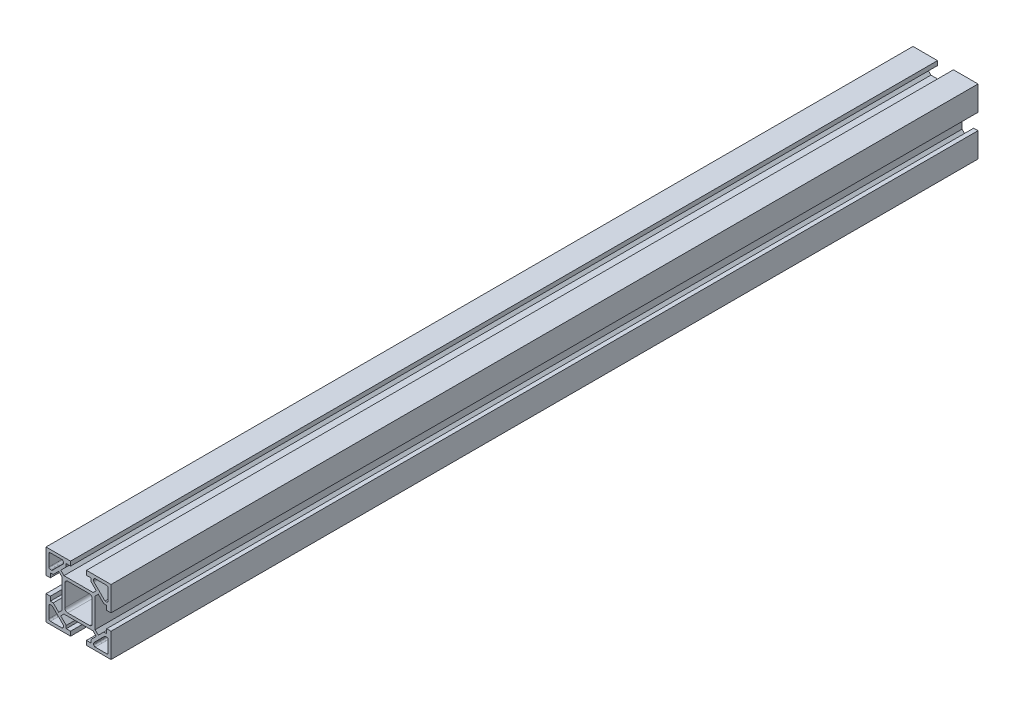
ISO-10303-21;
HEADER;
FILE_DESCRIPTION(('STEP AP214'),'2;1');
FILE_NAME('part.step','',(''),(''),'','','');
FILE_SCHEMA(('AUTOMOTIVE_DESIGN { 1 0 10303 214 1 1 1 1 }'));
ENDSEC;
DATA;
#1=APPLICATION_CONTEXT('core data for automotive mechanical design processes');
#2=APPLICATION_PROTOCOL_DEFINITION('international standard','automotive_design',2000,#1);
#3=PRODUCT_CONTEXT('',#1,'mechanical');
#4=PRODUCT('Part','Part','',(#3));
#5=PRODUCT_RELATED_PRODUCT_CATEGORY('part','',(#4));
#6=PRODUCT_DEFINITION_FORMATION('','',#4);
#7=PRODUCT_DEFINITION_CONTEXT('part definition',#1,'design');
#8=PRODUCT_DEFINITION('design','',#6,#7);
#9=PRODUCT_DEFINITION_SHAPE('','',#8);
#10=(LENGTH_UNIT() NAMED_UNIT(*) SI_UNIT(.MILLI.,.METRE.));
#11=(NAMED_UNIT(*) PLANE_ANGLE_UNIT() SI_UNIT($,.RADIAN.));
#12=(NAMED_UNIT(*) SI_UNIT($,.STERADIAN.) SOLID_ANGLE_UNIT());
#13=UNCERTAINTY_MEASURE_WITH_UNIT(LENGTH_MEASURE(1.E-05),#10,'distance_accuracy_value','');
#14=(GEOMETRIC_REPRESENTATION_CONTEXT(3) GLOBAL_UNCERTAINTY_ASSIGNED_CONTEXT((#13)) GLOBAL_UNIT_ASSIGNED_CONTEXT((#10,
#11,#12)) REPRESENTATION_CONTEXT('',''));
#15=CARTESIAN_POINT('',(0.,0.,0.));
#16=DIRECTION('',(0.,0.,1.));
#17=DIRECTION('',(1.,0.,0.));
#18=AXIS2_PLACEMENT_3D('',#15,#16,#17);
#19=CARTESIAN_POINT('',(-22.5,28.,600.));
#20=DIRECTION('',(0.,0.,1.));
#21=DIRECTION('',(1.,0.,0.));
#22=AXIS2_PLACEMENT_3D('',#19,#20,#21);
#23=PLANE('',#22);
#24=DIRECTION('',(-1.,0.,0.));
#25=VECTOR('',#24,1.);
#26=CARTESIAN_POINT('',(-20.5,12.,600.));
#27=LINE('',#26,#25);
#28=CARTESIAN_POINT('',(-18.7426406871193,12.,600.));
#29=VERTEX_POINT('',#28);
#30=CARTESIAN_POINT('',(-19.5,12.,600.));
#31=VERTEX_POINT('',#30);
#32=EDGE_CURVE('E702',#29,#31,#27,.T.);
#33=ORIENTED_EDGE('',*,*,#32,.F.);
#34=CARTESIAN_POINT('',(-18.7426406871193,11.,600.));
#35=DIRECTION('',(0.,0.,1.));
#36=DIRECTION('',(1.,0.,0.));
#37=AXIS2_PLACEMENT_3D('',#34,#35,#36);
#38=CIRCLE('',#37,1.);
#39=CARTESIAN_POINT('',(-18.0355339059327,11.7071067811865,600.));
#40=VERTEX_POINT('',#39);
#41=EDGE_CURVE('E1285',#29,#40,#38,.F.);
#42=ORIENTED_EDGE('',*,*,#41,.T.);
#43=DIRECTION('',(-0.707106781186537,0.707106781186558,0.));
#44=VECTOR('',#43,1.);
#45=CARTESIAN_POINT('',(-18.3284271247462,12.,600.));
#46=LINE('',#45,#44);
#47=CARTESIAN_POINT('',(-10.7928932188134,4.46446609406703,600.));
#48=VERTEX_POINT('',#47);
#49=EDGE_CURVE('E699',#48,#40,#46,.T.);
#50=ORIENTED_EDGE('',*,*,#49,.F.);
#51=CARTESIAN_POINT('',(-11.5,3.75735931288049,600.));
#52=DIRECTION('',(0.,0.,1.));
#53=DIRECTION('',(1.,0.,0.));
#54=AXIS2_PLACEMENT_3D('',#51,#52,#53);
#55=CIRCLE('',#54,1.);
#56=CARTESIAN_POINT('',(-10.5,3.75735931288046,600.));
#57=VERTEX_POINT('',#56);
#58=EDGE_CURVE('E1317',#48,#57,#55,.F.);
#59=ORIENTED_EDGE('',*,*,#58,.T.);
#60=DIRECTION('',(0.,1.,0.));
#61=VECTOR('',#60,1.);
#62=CARTESIAN_POINT('',(-10.5,2.,600.));
#63=LINE('',#62,#61);
#64=CARTESIAN_POINT('',(-10.5,3.,600.));
#65=VERTEX_POINT('',#64);
#66=EDGE_CURVE('E711',#65,#57,#63,.T.);
#67=ORIENTED_EDGE('',*,*,#66,.F.);
#68=CARTESIAN_POINT('',(-11.5,3.,600.));
#69=DIRECTION('',(0.,0.,1.));
#70=DIRECTION('',(1.,0.,0.));
#71=AXIS2_PLACEMENT_3D('',#68,#69,#70);
#72=CIRCLE('',#71,1.);
#73=CARTESIAN_POINT('',(-11.5,2.,600.));
#74=VERTEX_POINT('',#73);
#75=EDGE_CURVE('E1321',#65,#74,#72,.F.);
#76=ORIENTED_EDGE('',*,*,#75,.T.);
#77=DIRECTION('',(1.,0.,0.));
#78=VECTOR('',#77,1.);
#79=CARTESIAN_POINT('',(-20.5,2.,600.));
#80=LINE('',#79,#78);
#81=CARTESIAN_POINT('',(-19.5,2.,600.));
#82=VERTEX_POINT('',#81);
#83=EDGE_CURVE('E708',#82,#74,#80,.T.);
#84=ORIENTED_EDGE('',*,*,#83,.F.);
#85=CARTESIAN_POINT('',(-19.5,3.,600.));
#86=DIRECTION('',(0.,0.,1.));
#87=DIRECTION('',(1.,0.,0.));
#88=AXIS2_PLACEMENT_3D('',#85,#86,#87);
#89=CIRCLE('',#88,1.);
#90=CARTESIAN_POINT('',(-20.5,3.,600.));
#91=VERTEX_POINT('',#90);
#92=EDGE_CURVE('E1297',#82,#91,#89,.F.);
#93=ORIENTED_EDGE('',*,*,#92,.T.);
#94=DIRECTION('',(0.,-1.,0.));
#95=VECTOR('',#94,1.);
#96=CARTESIAN_POINT('',(-20.5,2.,600.));
#97=LINE('',#96,#95);
#98=CARTESIAN_POINT('',(-20.5,11.,600.));
#99=VERTEX_POINT('',#98);
#100=EDGE_CURVE('E705',#99,#91,#97,.T.);
#101=ORIENTED_EDGE('',*,*,#100,.F.);
#102=CARTESIAN_POINT('',(-19.5,11.,600.));
#103=DIRECTION('',(0.,0.,1.));
#104=DIRECTION('',(1.,0.,0.));
#105=AXIS2_PLACEMENT_3D('',#102,#103,#104);
#106=CIRCLE('',#105,1.);
#107=EDGE_CURVE('E1289',#99,#31,#106,.F.);
#108=ORIENTED_EDGE('',*,*,#107,.T.);
#109=EDGE_LOOP('',(#33,#42,#50,#59,#67,#76,#84,#93,#101,#108));
#110=FACE_BOUND('',#109,.T.);
#111=DIRECTION('',(0.707106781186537,0.707106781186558,0.));
#112=VECTOR('',#111,1.);
#113=CARTESIAN_POINT('',(-18.3284271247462,33.,600.));
#114=LINE('',#113,#112);
#115=CARTESIAN_POINT('',(-18.0355339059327,33.2928932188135,600.));
#116=VERTEX_POINT('',#115);
#117=CARTESIAN_POINT('',(-10.7928932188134,40.535533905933,600.));
#118=VERTEX_POINT('',#117);
#119=EDGE_CURVE('E762',#116,#118,#114,.T.);
#120=ORIENTED_EDGE('',*,*,#119,.F.);
#121=CARTESIAN_POINT('',(-18.7426406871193,34.,600.));
#122=DIRECTION('',(0.,0.,1.));
#123=DIRECTION('',(1.,0.,0.));
#124=AXIS2_PLACEMENT_3D('',#121,#122,#123);
#125=CIRCLE('',#124,1.);
#126=CARTESIAN_POINT('',(-18.7426406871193,33.,600.));
#127=VERTEX_POINT('',#126);
#128=EDGE_CURVE('E1309',#116,#127,#125,.F.);
#129=ORIENTED_EDGE('',*,*,#128,.T.);
#130=DIRECTION('',(1.,0.,0.));
#131=VECTOR('',#130,1.);
#132=CARTESIAN_POINT('',(-20.5,33.,600.));
#133=LINE('',#132,#131);
#134=CARTESIAN_POINT('',(-19.5,33.,600.));
#135=VERTEX_POINT('',#134);
#136=EDGE_CURVE('E759',#135,#127,#133,.T.);
#137=ORIENTED_EDGE('',*,*,#136,.F.);
#138=CARTESIAN_POINT('',(-19.5,34.,600.));
#139=DIRECTION('',(0.,0.,1.));
#140=DIRECTION('',(1.,0.,0.));
#141=AXIS2_PLACEMENT_3D('',#138,#139,#140);
#142=CIRCLE('',#141,1.);
#143=CARTESIAN_POINT('',(-20.5,34.,600.));
#144=VERTEX_POINT('',#143);
#145=EDGE_CURVE('E1261',#135,#144,#142,.F.);
#146=ORIENTED_EDGE('',*,*,#145,.T.);
#147=DIRECTION('',(0.,-1.,0.));
#148=VECTOR('',#147,1.);
#149=CARTESIAN_POINT('',(-20.5,43.,600.));
#150=LINE('',#149,#148);
#151=CARTESIAN_POINT('',(-20.5,42.,600.));
#152=VERTEX_POINT('',#151);
#153=EDGE_CURVE('E771',#152,#144,#150,.T.);
#154=ORIENTED_EDGE('',*,*,#153,.F.);
#155=CARTESIAN_POINT('',(-19.5,42.,600.));
#156=DIRECTION('',(0.,0.,1.));
#157=DIRECTION('',(1.,0.,0.));
#158=AXIS2_PLACEMENT_3D('',#155,#156,#157);
#159=CIRCLE('',#158,1.);
#160=CARTESIAN_POINT('',(-19.5,43.,600.));
#161=VERTEX_POINT('',#160);
#162=EDGE_CURVE('E1281',#152,#161,#159,.F.);
#163=ORIENTED_EDGE('',*,*,#162,.T.);
#164=DIRECTION('',(-1.,0.,0.));
#165=VECTOR('',#164,1.);
#166=CARTESIAN_POINT('',(-20.5,43.,600.));
#167=LINE('',#166,#165);
#168=CARTESIAN_POINT('',(-11.5,43.,600.));
#169=VERTEX_POINT('',#168);
#170=EDGE_CURVE('E768',#169,#161,#167,.T.);
#171=ORIENTED_EDGE('',*,*,#170,.F.);
#172=CARTESIAN_POINT('',(-11.5,42.,600.));
#173=DIRECTION('',(0.,0.,1.));
#174=DIRECTION('',(1.,0.,0.));
#175=AXIS2_PLACEMENT_3D('',#172,#173,#174);
#176=CIRCLE('',#175,1.);
#177=CARTESIAN_POINT('',(-10.5,42.,600.));
#178=VERTEX_POINT('',#177);
#179=EDGE_CURVE('E1265',#169,#178,#176,.F.);
#180=ORIENTED_EDGE('',*,*,#179,.T.);
#181=DIRECTION('',(0.,1.,0.));
#182=VECTOR('',#181,1.);
#183=CARTESIAN_POINT('',(-10.5,43.,600.));
#184=LINE('',#183,#182);
#185=CARTESIAN_POINT('',(-10.5,41.2426406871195,600.));
#186=VERTEX_POINT('',#185);
#187=EDGE_CURVE('E765',#186,#178,#184,.T.);
#188=ORIENTED_EDGE('',*,*,#187,.F.);
#189=CARTESIAN_POINT('',(-11.5,41.2426406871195,600.));
#190=DIRECTION('',(0.,0.,1.));
#191=DIRECTION('',(1.,0.,0.));
#192=AXIS2_PLACEMENT_3D('',#189,#190,#191);
#193=CIRCLE('',#192,1.);
#194=EDGE_CURVE('E1313',#186,#118,#193,.F.);
#195=ORIENTED_EDGE('',*,*,#194,.T.);
#196=EDGE_LOOP('',(#120,#129,#137,#146,#154,#163,#171,#180,#188,#195));
#197=FACE_BOUND('',#196,.T.);
#198=DIRECTION('',(0.,-1.,0.));
#199=VECTOR('',#198,1.);
#200=CARTESIAN_POINT('',(-22.5,45.,600.));
#201=LINE('',#200,#199);
#202=CARTESIAN_POINT('',(-22.5,45.,600.));
#203=VERTEX_POINT('',#202);
#204=CARTESIAN_POINT('',(-22.5,28.,600.));
#205=VERTEX_POINT('',#204);
#206=EDGE_CURVE('E910',#203,#205,#201,.T.);
#207=ORIENTED_EDGE('',*,*,#206,.T.);
#208=DIRECTION('',(1.,0.,0.));
#209=VECTOR('',#208,1.);
#210=CARTESIAN_POINT('',(-22.5,28.,600.));
#211=LINE('',#210,#209);
#212=CARTESIAN_POINT('',(-19.5,28.,600.));
#213=VERTEX_POINT('',#212);
#214=EDGE_CURVE('E913',#205,#213,#211,.T.);
#215=ORIENTED_EDGE('',*,*,#214,.T.);
#216=DIRECTION('',(0.,1.,0.));
#217=VECTOR('',#216,1.);
#218=CARTESIAN_POINT('',(-19.5,28.,600.));
#219=LINE('',#218,#217);
#220=CARTESIAN_POINT('',(-19.5,31.,600.));
#221=VERTEX_POINT('',#220);
#222=EDGE_CURVE('E915',#213,#221,#219,.T.);
#223=ORIENTED_EDGE('',*,*,#222,.T.);
#224=DIRECTION('',(1.,0.,0.));
#225=VECTOR('',#224,1.);
#226=CARTESIAN_POINT('',(-19.5,31.,600.));
#227=LINE('',#226,#225);
#228=CARTESIAN_POINT('',(-17.5,31.,600.));
#229=VERTEX_POINT('',#228);
#230=EDGE_CURVE('E917',#221,#229,#227,.T.);
#231=ORIENTED_EDGE('',*,*,#230,.T.);
#232=DIRECTION('',(0.707106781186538,0.707106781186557,0.));
#233=VECTOR('',#232,1.);
#234=CARTESIAN_POINT('',(-17.5,31.,600.));
#235=LINE('',#234,#233);
#236=CARTESIAN_POINT('',(-13.7071067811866,34.7928932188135,600.));
#237=VERTEX_POINT('',#236);
#238=EDGE_CURVE('E919',#229,#237,#235,.T.);
#239=ORIENTED_EDGE('',*,*,#238,.T.);
#240=DIRECTION('',(0.707106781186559,-0.707106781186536,0.));
#241=VECTOR('',#240,1.);
#242=CARTESIAN_POINT('',(-13.7071067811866,34.7928932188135,600.));
#243=LINE('',#242,#241);
#244=CARTESIAN_POINT('',(-11.5,32.585786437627,600.));
#245=VERTEX_POINT('',#244);
#246=EDGE_CURVE('E921',#237,#245,#243,.T.);
#247=ORIENTED_EDGE('',*,*,#246,.T.);
#248=DIRECTION('',(0.,-1.,0.));
#249=VECTOR('',#248,1.);
#250=CARTESIAN_POINT('',(-11.5,32.585786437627,600.));
#251=LINE('',#250,#249);
#252=CARTESIAN_POINT('',(-11.5,12.414213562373,600.));
#253=VERTEX_POINT('',#252);
#254=EDGE_CURVE('E923',#245,#253,#251,.T.);
#255=ORIENTED_EDGE('',*,*,#254,.T.);
#256=DIRECTION('',(-0.707106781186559,-0.707106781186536,0.));
#257=VECTOR('',#256,1.);
#258=CARTESIAN_POINT('',(-13.7071067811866,10.2071067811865,600.));
#259=LINE('',#258,#257);
#260=CARTESIAN_POINT('',(-13.7071067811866,10.2071067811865,600.));
#261=VERTEX_POINT('',#260);
#262=EDGE_CURVE('E925',#253,#261,#259,.T.);
#263=ORIENTED_EDGE('',*,*,#262,.T.);
#264=DIRECTION('',(-0.707106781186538,0.707106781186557,0.));
#265=VECTOR('',#264,1.);
#266=CARTESIAN_POINT('',(-17.5,14.,600.));
#267=LINE('',#266,#265);
#268=CARTESIAN_POINT('',(-17.5,14.,600.));
#269=VERTEX_POINT('',#268);
#270=EDGE_CURVE('E927',#261,#269,#267,.T.);
#271=ORIENTED_EDGE('',*,*,#270,.T.);
#272=DIRECTION('',(-1.,0.,0.));
#273=VECTOR('',#272,1.);
#274=CARTESIAN_POINT('',(-19.5,14.,600.));
#275=LINE('',#274,#273);
#276=CARTESIAN_POINT('',(-19.5,14.,600.));
#277=VERTEX_POINT('',#276);
#278=EDGE_CURVE('E929',#269,#277,#275,.T.);
#279=ORIENTED_EDGE('',*,*,#278,.T.);
#280=DIRECTION('',(0.,1.,0.));
#281=VECTOR('',#280,1.);
#282=CARTESIAN_POINT('',(-19.5,17.,600.));
#283=LINE('',#282,#281);
#284=CARTESIAN_POINT('',(-19.5,17.,600.));
#285=VERTEX_POINT('',#284);
#286=EDGE_CURVE('E931',#277,#285,#283,.T.);
#287=ORIENTED_EDGE('',*,*,#286,.T.);
#288=DIRECTION('',(-1.,0.,0.));
#289=VECTOR('',#288,1.);
#290=CARTESIAN_POINT('',(-22.5,17.,600.));
#291=LINE('',#290,#289);
#292=CARTESIAN_POINT('',(-22.5,17.,600.));
#293=VERTEX_POINT('',#292);
#294=EDGE_CURVE('E933',#285,#293,#291,.T.);
#295=ORIENTED_EDGE('',*,*,#294,.T.);
#296=DIRECTION('',(0.,-1.,0.));
#297=VECTOR('',#296,1.);
#298=CARTESIAN_POINT('',(-22.5,0.,600.));
#299=LINE('',#298,#297);
#300=CARTESIAN_POINT('',(-22.5,0.,600.));
#301=VERTEX_POINT('',#300);
#302=EDGE_CURVE('E935',#293,#301,#299,.T.);
#303=ORIENTED_EDGE('',*,*,#302,.T.);
#304=DIRECTION('',(1.,0.,0.));
#305=VECTOR('',#304,1.);
#306=CARTESIAN_POINT('',(-22.5,0.,600.));
#307=LINE('',#306,#305);
#308=CARTESIAN_POINT('',(-5.5,0.,600.));
#309=VERTEX_POINT('',#308);
#310=EDGE_CURVE('E937',#301,#309,#307,.T.);
#311=ORIENTED_EDGE('',*,*,#310,.T.);
#312=DIRECTION('',(0.,1.,0.));
#313=VECTOR('',#312,1.);
#314=CARTESIAN_POINT('',(-5.5,0.,600.));
#315=LINE('',#314,#313);
#316=CARTESIAN_POINT('',(-5.5,3.00000000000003,600.));
#317=VERTEX_POINT('',#316);
#318=EDGE_CURVE('E939',#309,#317,#315,.T.);
#319=ORIENTED_EDGE('',*,*,#318,.T.);
#320=DIRECTION('',(-1.,0.,0.));
#321=VECTOR('',#320,1.);
#322=CARTESIAN_POINT('',(-5.5,3.00000000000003,600.));
#323=LINE('',#322,#321);
#324=CARTESIAN_POINT('',(-8.50000000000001,3.,600.));
#325=VERTEX_POINT('',#324);
#326=EDGE_CURVE('E941',#317,#325,#323,.T.);
#327=ORIENTED_EDGE('',*,*,#326,.T.);
#328=DIRECTION('',(0.,1.,0.));
#329=VECTOR('',#328,1.);
#330=CARTESIAN_POINT('',(-8.50000000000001,3.,600.));
#331=LINE('',#330,#329);
#332=CARTESIAN_POINT('',(-8.50000000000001,5.,600.));
#333=VERTEX_POINT('',#332);
#334=EDGE_CURVE('E943',#325,#333,#331,.T.);
#335=ORIENTED_EDGE('',*,*,#334,.T.);
#336=DIRECTION('',(-0.707106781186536,0.707106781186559,0.));
#337=VECTOR('',#336,1.);
#338=CARTESIAN_POINT('',(-8.50000000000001,5.,600.));
#339=LINE('',#338,#337);
#340=CARTESIAN_POINT('',(-12.2928932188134,8.79289321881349,600.));
#341=VERTEX_POINT('',#340);
#342=EDGE_CURVE('E945',#333,#341,#339,.T.);
#343=ORIENTED_EDGE('',*,*,#342,.T.);
#344=DIRECTION('',(0.707106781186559,0.707106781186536,0.));
#345=VECTOR('',#344,1.);
#346=CARTESIAN_POINT('',(-12.2928932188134,8.79289321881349,600.));
#347=LINE('',#346,#345);
#348=CARTESIAN_POINT('',(-10.0857864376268,11.,600.));
#349=VERTEX_POINT('',#348);
#350=EDGE_CURVE('E947',#341,#349,#347,.T.);
#351=ORIENTED_EDGE('',*,*,#350,.T.);
#352=DIRECTION('',(1.,0.,0.));
#353=VECTOR('',#352,1.);
#354=CARTESIAN_POINT('',(-10.0857864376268,11.,600.));
#355=LINE('',#354,#353);
#356=CARTESIAN_POINT('',(10.0857864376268,11.,600.));
#357=VERTEX_POINT('',#356);
#358=EDGE_CURVE('E949',#349,#357,#355,.T.);
#359=ORIENTED_EDGE('',*,*,#358,.T.);
#360=DIRECTION('',(0.707106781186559,-0.707106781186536,0.));
#361=VECTOR('',#360,1.);
#362=CARTESIAN_POINT('',(12.2928932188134,8.79289321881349,600.));
#363=LINE('',#362,#361);
#364=CARTESIAN_POINT('',(12.2928932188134,8.79289321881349,600.));
#365=VERTEX_POINT('',#364);
#366=EDGE_CURVE('E951',#357,#365,#363,.T.);
#367=ORIENTED_EDGE('',*,*,#366,.T.);
#368=DIRECTION('',(-0.707106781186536,-0.707106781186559,0.));
#369=VECTOR('',#368,1.);
#370=CARTESIAN_POINT('',(8.50000000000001,5.,600.));
#371=LINE('',#370,#369);
#372=CARTESIAN_POINT('',(8.50000000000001,5.,600.));
#373=VERTEX_POINT('',#372);
#374=EDGE_CURVE('E953',#365,#373,#371,.T.);
#375=ORIENTED_EDGE('',*,*,#374,.T.);
#376=DIRECTION('',(0.,-1.,0.));
#377=VECTOR('',#376,1.);
#378=CARTESIAN_POINT('',(8.50000000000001,3.,600.));
#379=LINE('',#378,#377);
#380=CARTESIAN_POINT('',(8.50000000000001,3.,600.));
#381=VERTEX_POINT('',#380);
#382=EDGE_CURVE('E955',#373,#381,#379,.T.);
#383=ORIENTED_EDGE('',*,*,#382,.T.);
#384=DIRECTION('',(-1.,0.,0.));
#385=VECTOR('',#384,1.);
#386=CARTESIAN_POINT('',(5.5,3.00000000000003,600.));
#387=LINE('',#386,#385);
#388=CARTESIAN_POINT('',(5.5,3.00000000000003,600.));
#389=VERTEX_POINT('',#388);
#390=EDGE_CURVE('E957',#381,#389,#387,.T.);
#391=ORIENTED_EDGE('',*,*,#390,.T.);
#392=DIRECTION('',(0.,-1.,0.));
#393=VECTOR('',#392,1.);
#394=CARTESIAN_POINT('',(5.5,0.,600.));
#395=LINE('',#394,#393);
#396=CARTESIAN_POINT('',(5.5,0.,600.));
#397=VERTEX_POINT('',#396);
#398=EDGE_CURVE('E959',#389,#397,#395,.T.);
#399=ORIENTED_EDGE('',*,*,#398,.T.);
#400=DIRECTION('',(1.,0.,0.));
#401=VECTOR('',#400,1.);
#402=CARTESIAN_POINT('',(22.5,0.,600.));
#403=LINE('',#402,#401);
#404=CARTESIAN_POINT('',(22.5,0.,600.));
#405=VERTEX_POINT('',#404);
#406=EDGE_CURVE('E961',#397,#405,#403,.T.);
#407=ORIENTED_EDGE('',*,*,#406,.T.);
#408=DIRECTION('',(0.,1.,0.));
#409=VECTOR('',#408,1.);
#410=CARTESIAN_POINT('',(22.5,0.,600.));
#411=LINE('',#410,#409);
#412=CARTESIAN_POINT('',(22.5,17.,600.));
#413=VERTEX_POINT('',#412);
#414=EDGE_CURVE('E963',#405,#413,#411,.T.);
#415=ORIENTED_EDGE('',*,*,#414,.T.);
#416=DIRECTION('',(-1.,0.,0.));
#417=VECTOR('',#416,1.);
#418=CARTESIAN_POINT('',(22.5,17.,600.));
#419=LINE('',#418,#417);
#420=CARTESIAN_POINT('',(19.5,17.,600.));
#421=VERTEX_POINT('',#420);
#422=EDGE_CURVE('E965',#413,#421,#419,.T.);
#423=ORIENTED_EDGE('',*,*,#422,.T.);
#424=DIRECTION('',(0.,-1.,0.));
#425=VECTOR('',#424,1.);
#426=CARTESIAN_POINT('',(19.5,17.,600.));
#427=LINE('',#426,#425);
#428=CARTESIAN_POINT('',(19.5,14.,600.));
#429=VERTEX_POINT('',#428);
#430=EDGE_CURVE('E967',#421,#429,#427,.T.);
#431=ORIENTED_EDGE('',*,*,#430,.T.);
#432=DIRECTION('',(-1.,0.,0.));
#433=VECTOR('',#432,1.);
#434=CARTESIAN_POINT('',(19.5,14.,600.));
#435=LINE('',#434,#433);
#436=CARTESIAN_POINT('',(17.5,14.,600.));
#437=VERTEX_POINT('',#436);
#438=EDGE_CURVE('E969',#429,#437,#435,.T.);
#439=ORIENTED_EDGE('',*,*,#438,.T.);
#440=DIRECTION('',(-0.707106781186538,-0.707106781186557,0.));
#441=VECTOR('',#440,1.);
#442=CARTESIAN_POINT('',(17.5,14.,600.));
#443=LINE('',#442,#441);
#444=CARTESIAN_POINT('',(13.7071067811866,10.2071067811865,600.));
#445=VERTEX_POINT('',#444);
#446=EDGE_CURVE('E971',#437,#445,#443,.T.);
#447=ORIENTED_EDGE('',*,*,#446,.T.);
#448=DIRECTION('',(-0.707106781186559,0.707106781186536,0.));
#449=VECTOR('',#448,1.);
#450=CARTESIAN_POINT('',(13.7071067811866,10.2071067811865,600.));
#451=LINE('',#450,#449);
#452=CARTESIAN_POINT('',(11.5,12.414213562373,600.));
#453=VERTEX_POINT('',#452);
#454=EDGE_CURVE('E973',#445,#453,#451,.T.);
#455=ORIENTED_EDGE('',*,*,#454,.T.);
#456=DIRECTION('',(0.,1.,0.));
#457=VECTOR('',#456,1.);
#458=CARTESIAN_POINT('',(11.5,32.585786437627,600.));
#459=LINE('',#458,#457);
#460=CARTESIAN_POINT('',(11.5,32.585786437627,600.));
#461=VERTEX_POINT('',#460);
#462=EDGE_CURVE('E975',#453,#461,#459,.T.);
#463=ORIENTED_EDGE('',*,*,#462,.T.);
#464=DIRECTION('',(0.707106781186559,0.707106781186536,0.));
#465=VECTOR('',#464,1.);
#466=CARTESIAN_POINT('',(13.7071067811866,34.7928932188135,600.));
#467=LINE('',#466,#465);
#468=CARTESIAN_POINT('',(13.7071067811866,34.7928932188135,600.));
#469=VERTEX_POINT('',#468);
#470=EDGE_CURVE('E977',#461,#469,#467,.T.);
#471=ORIENTED_EDGE('',*,*,#470,.T.);
#472=DIRECTION('',(0.707106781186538,-0.707106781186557,0.));
#473=VECTOR('',#472,1.);
#474=CARTESIAN_POINT('',(17.5,31.,600.));
#475=LINE('',#474,#473);
#476=CARTESIAN_POINT('',(17.5,31.,600.));
#477=VERTEX_POINT('',#476);
#478=EDGE_CURVE('E979',#469,#477,#475,.T.);
#479=ORIENTED_EDGE('',*,*,#478,.T.);
#480=DIRECTION('',(1.,0.,0.));
#481=VECTOR('',#480,1.);
#482=CARTESIAN_POINT('',(19.5,31.,600.));
#483=LINE('',#482,#481);
#484=CARTESIAN_POINT('',(19.5,31.,600.));
#485=VERTEX_POINT('',#484);
#486=EDGE_CURVE('E981',#477,#485,#483,.T.);
#487=ORIENTED_EDGE('',*,*,#486,.T.);
#488=DIRECTION('',(0.,-1.,0.));
#489=VECTOR('',#488,1.);
#490=CARTESIAN_POINT('',(19.5,28.,600.));
#491=LINE('',#490,#489);
#492=CARTESIAN_POINT('',(19.5,28.,600.));
#493=VERTEX_POINT('',#492);
#494=EDGE_CURVE('E983',#485,#493,#491,.T.);
#495=ORIENTED_EDGE('',*,*,#494,.T.);
#496=DIRECTION('',(1.,0.,0.));
#497=VECTOR('',#496,1.);
#498=CARTESIAN_POINT('',(22.5,28.,600.));
#499=LINE('',#498,#497);
#500=CARTESIAN_POINT('',(22.5,28.,600.));
#501=VERTEX_POINT('',#500);
#502=EDGE_CURVE('E985',#493,#501,#499,.T.);
#503=ORIENTED_EDGE('',*,*,#502,.T.);
#504=DIRECTION('',(0.,1.,0.));
#505=VECTOR('',#504,1.);
#506=CARTESIAN_POINT('',(22.5,45.,600.));
#507=LINE('',#506,#505);
#508=CARTESIAN_POINT('',(22.5,45.,600.));
#509=VERTEX_POINT('',#508);
#510=EDGE_CURVE('E987',#501,#509,#507,.T.);
#511=ORIENTED_EDGE('',*,*,#510,.T.);
#512=DIRECTION('',(-1.,0.,0.));
#513=VECTOR('',#512,1.);
#514=CARTESIAN_POINT('',(22.5,45.,600.));
#515=LINE('',#514,#513);
#516=CARTESIAN_POINT('',(5.5,45.,600.));
#517=VERTEX_POINT('',#516);
#518=EDGE_CURVE('E989',#509,#517,#515,.T.);
#519=ORIENTED_EDGE('',*,*,#518,.T.);
#520=DIRECTION('',(0.,-1.,0.));
#521=VECTOR('',#520,1.);
#522=CARTESIAN_POINT('',(5.5,45.,600.));
#523=LINE('',#522,#521);
#524=CARTESIAN_POINT('',(5.5,42.,600.));
#525=VERTEX_POINT('',#524);
#526=EDGE_CURVE('E991',#517,#525,#523,.T.);
#527=ORIENTED_EDGE('',*,*,#526,.T.);
#528=DIRECTION('',(1.,0.,0.));
#529=VECTOR('',#528,1.);
#530=CARTESIAN_POINT('',(5.5,42.,600.));
#531=LINE('',#530,#529);
#532=CARTESIAN_POINT('',(8.50000000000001,42.,600.));
#533=VERTEX_POINT('',#532);
#534=EDGE_CURVE('E993',#525,#533,#531,.T.);
#535=ORIENTED_EDGE('',*,*,#534,.T.);
#536=DIRECTION('',(0.,-1.,0.));
#537=VECTOR('',#536,1.);
#538=CARTESIAN_POINT('',(8.50000000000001,42.,600.));
#539=LINE('',#538,#537);
#540=CARTESIAN_POINT('',(8.50000000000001,40.,600.));
#541=VERTEX_POINT('',#540);
#542=EDGE_CURVE('E995',#533,#541,#539,.T.);
#543=ORIENTED_EDGE('',*,*,#542,.T.);
#544=DIRECTION('',(0.707106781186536,-0.707106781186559,0.));
#545=VECTOR('',#544,1.);
#546=CARTESIAN_POINT('',(8.50000000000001,40.,600.));
#547=LINE('',#546,#545);
#548=CARTESIAN_POINT('',(12.2928932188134,36.2071067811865,600.));
#549=VERTEX_POINT('',#548);
#550=EDGE_CURVE('E997',#541,#549,#547,.T.);
#551=ORIENTED_EDGE('',*,*,#550,.T.);
#552=DIRECTION('',(-0.707106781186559,-0.707106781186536,0.));
#553=VECTOR('',#552,1.);
#554=CARTESIAN_POINT('',(12.2928932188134,36.2071067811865,600.));
#555=LINE('',#554,#553);
#556=CARTESIAN_POINT('',(10.0857864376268,34.,600.));
#557=VERTEX_POINT('',#556);
#558=EDGE_CURVE('E999',#549,#557,#555,.T.);
#559=ORIENTED_EDGE('',*,*,#558,.T.);
#560=DIRECTION('',(-1.,0.,0.));
#561=VECTOR('',#560,1.);
#562=CARTESIAN_POINT('',(-10.0857864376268,34.,600.));
#563=LINE('',#562,#561);
#564=CARTESIAN_POINT('',(-10.0857864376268,34.,600.));
#565=VERTEX_POINT('',#564);
#566=EDGE_CURVE('E1001',#557,#565,#563,.T.);
#567=ORIENTED_EDGE('',*,*,#566,.T.);
#568=DIRECTION('',(-0.707106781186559,0.707106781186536,0.));
#569=VECTOR('',#568,1.);
#570=CARTESIAN_POINT('',(-12.2928932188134,36.2071067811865,600.));
#571=LINE('',#570,#569);
#572=CARTESIAN_POINT('',(-12.2928932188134,36.2071067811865,600.));
#573=VERTEX_POINT('',#572);
#574=EDGE_CURVE('E1003',#565,#573,#571,.T.);
#575=ORIENTED_EDGE('',*,*,#574,.T.);
#576=DIRECTION('',(0.707106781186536,0.707106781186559,0.));
#577=VECTOR('',#576,1.);
#578=CARTESIAN_POINT('',(-8.50000000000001,40.,600.));
#579=LINE('',#578,#577);
#580=CARTESIAN_POINT('',(-8.50000000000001,40.,600.));
#581=VERTEX_POINT('',#580);
#582=EDGE_CURVE('E1005',#573,#581,#579,.T.);
#583=ORIENTED_EDGE('',*,*,#582,.T.);
#584=DIRECTION('',(0.,1.,0.));
#585=VECTOR('',#584,1.);
#586=CARTESIAN_POINT('',(-8.50000000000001,42.,600.));
#587=LINE('',#586,#585);
#588=CARTESIAN_POINT('',(-8.50000000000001,42.,600.));
#589=VERTEX_POINT('',#588);
#590=EDGE_CURVE('E1007',#581,#589,#587,.T.);
#591=ORIENTED_EDGE('',*,*,#590,.T.);
#592=DIRECTION('',(1.,0.,0.));
#593=VECTOR('',#592,1.);
#594=CARTESIAN_POINT('',(-5.5,42.,600.));
#595=LINE('',#594,#593);
#596=CARTESIAN_POINT('',(-5.5,42.,600.));
#597=VERTEX_POINT('',#596);
#598=EDGE_CURVE('E1009',#589,#597,#595,.T.);
#599=ORIENTED_EDGE('',*,*,#598,.T.);
#600=DIRECTION('',(0.,1.,0.));
#601=VECTOR('',#600,1.);
#602=CARTESIAN_POINT('',(-5.5,45.,600.));
#603=LINE('',#602,#601);
#604=CARTESIAN_POINT('',(-5.5,45.,600.));
#605=VERTEX_POINT('',#604);
#606=EDGE_CURVE('E1011',#597,#605,#603,.T.);
#607=ORIENTED_EDGE('',*,*,#606,.T.);
#608=DIRECTION('',(-1.,0.,0.));
#609=VECTOR('',#608,1.);
#610=CARTESIAN_POINT('',(-22.5,45.,600.));
#611=LINE('',#610,#609);
#612=EDGE_CURVE('E1013',#605,#203,#611,.T.);
#613=ORIENTED_EDGE('',*,*,#612,.T.);
#614=EDGE_LOOP('',(#207,#215,#223,#231,#239,#247,#255,#263,#271,#279,#287,#295,#303,#311,#319,
#327,#335,#343,#351,#359,#367,#375,#383,#391,#399,#407,#415,#423,#431,#439,#447,#455,#463,#471,
#479,#487,#495,#503,#511,#519,#527,#535,#543,#551,#559,#567,#575,#583,#591,#599,#607,#613));
#615=FACE_BOUND('',#614,.T.);
#616=DIRECTION('',(1.,0.,0.));
#617=VECTOR('',#616,1.);
#618=CARTESIAN_POINT('',(-9.49999999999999,13.,600.));
#619=LINE('',#618,#617);
#620=CARTESIAN_POINT('',(-7.50000000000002,13.,600.));
#621=VERTEX_POINT('',#620);
#622=CARTESIAN_POINT('',(7.49999999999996,13.0000000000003,600.));
#623=VERTEX_POINT('',#622);
#624=EDGE_CURVE('E792',#621,#623,#619,.T.);
#625=ORIENTED_EDGE('',*,*,#624,.F.);
#626=CARTESIAN_POINT('',(-7.49999999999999,15.0000000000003,600.));
#627=DIRECTION('',(0.,0.,1.));
#628=DIRECTION('',(1.,0.,0.));
#629=AXIS2_PLACEMENT_3D('',#626,#627,#628);
#630=CIRCLE('',#629,2.);
#631=CARTESIAN_POINT('',(-9.49999999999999,15.0000000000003,600.));
#632=VERTEX_POINT('',#631);
#633=EDGE_CURVE('E1356',#621,#632,#630,.F.);
#634=ORIENTED_EDGE('',*,*,#633,.T.);
#635=DIRECTION('',(0.,-1.,0.));
#636=VECTOR('',#635,1.);
#637=CARTESIAN_POINT('',(-9.49999999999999,32.,600.));
#638=LINE('',#637,#636);
#639=CARTESIAN_POINT('',(-9.49999999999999,29.9999999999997,600.));
#640=VERTEX_POINT('',#639);
#641=EDGE_CURVE('E789',#640,#632,#638,.T.);
#642=ORIENTED_EDGE('',*,*,#641,.F.);
#643=CARTESIAN_POINT('',(-7.49999999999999,29.9999999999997,600.));
#644=DIRECTION('',(0.,0.,1.));
#645=DIRECTION('',(1.,0.,0.));
#646=AXIS2_PLACEMENT_3D('',#643,#644,#645);
#647=CIRCLE('',#646,2.);
#648=CARTESIAN_POINT('',(-7.50000000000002,32.,600.));
#649=VERTEX_POINT('',#648);
#650=EDGE_CURVE('E1352',#640,#649,#647,.F.);
#651=ORIENTED_EDGE('',*,*,#650,.T.);
#652=DIRECTION('',(-1.,0.,0.));
#653=VECTOR('',#652,1.);
#654=CARTESIAN_POINT('',(-9.49999999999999,32.,600.));
#655=LINE('',#654,#653);
#656=CARTESIAN_POINT('',(7.49999999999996,31.9999999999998,600.));
#657=VERTEX_POINT('',#656);
#658=EDGE_CURVE('E786',#657,#649,#655,.T.);
#659=ORIENTED_EDGE('',*,*,#658,.F.);
#660=CARTESIAN_POINT('',(7.49999999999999,30.,600.));
#661=DIRECTION('',(0.,0.,1.));
#662=DIRECTION('',(1.,0.,0.));
#663=AXIS2_PLACEMENT_3D('',#660,#661,#662);
#664=CIRCLE('',#663,2.);
#665=CARTESIAN_POINT('',(9.49999999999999,30.,600.));
#666=VERTEX_POINT('',#665);
#667=EDGE_CURVE('E45',#657,#666,#664,.F.);
#668=ORIENTED_EDGE('',*,*,#667,.T.);
#669=DIRECTION('',(0.,1.,0.));
#670=VECTOR('',#669,1.);
#671=CARTESIAN_POINT('',(9.49999999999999,32.,600.));
#672=LINE('',#671,#670);
#673=CARTESIAN_POINT('',(9.49999999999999,15.,600.));
#674=VERTEX_POINT('',#673);
#675=EDGE_CURVE('E795',#674,#666,#672,.T.);
#676=ORIENTED_EDGE('',*,*,#675,.F.);
#677=CARTESIAN_POINT('',(7.49999999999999,15.,600.));
#678=DIRECTION('',(0.,0.,1.));
#679=DIRECTION('',(1.,0.,0.));
#680=AXIS2_PLACEMENT_3D('',#677,#678,#679);
#681=CIRCLE('',#680,2.);
#682=EDGE_CURVE('E11',#674,#623,#681,.F.);
#683=ORIENTED_EDGE('',*,*,#682,.T.);
#684=EDGE_LOOP('',(#625,#634,#642,#651,#659,#668,#676,#683));
#685=FACE_BOUND('',#684,.T.);
#686=DIRECTION('',(-0.707106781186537,-0.707106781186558,0.));
#687=VECTOR('',#686,1.);
#688=CARTESIAN_POINT('',(18.3284271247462,12.,600.));
#689=LINE('',#688,#687);
#690=CARTESIAN_POINT('',(18.0355339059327,11.7071067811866,600.));
#691=VERTEX_POINT('',#690);
#692=CARTESIAN_POINT('',(10.7928932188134,4.46446609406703,600.));
#693=VERTEX_POINT('',#692);
#694=EDGE_CURVE('E732',#691,#693,#689,.T.);
#695=ORIENTED_EDGE('',*,*,#694,.F.);
#696=CARTESIAN_POINT('',(18.7426406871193,11.,600.));
#697=DIRECTION('',(0.,0.,1.));
#698=DIRECTION('',(1.,0.,0.));
#699=AXIS2_PLACEMENT_3D('',#696,#697,#698);
#700=CIRCLE('',#699,1.);
#701=CARTESIAN_POINT('',(18.7426406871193,12.,600.));
#702=VERTEX_POINT('',#701);
#703=EDGE_CURVE('E1293',#691,#702,#700,.F.);
#704=ORIENTED_EDGE('',*,*,#703,.T.);
#705=DIRECTION('',(-1.,0.,0.));
#706=VECTOR('',#705,1.);
#707=CARTESIAN_POINT('',(20.5,12.,600.));
#708=LINE('',#707,#706);
#709=CARTESIAN_POINT('',(19.5,12.,600.));
#710=VERTEX_POINT('',#709);
#711=EDGE_CURVE('E729',#710,#702,#708,.T.);
#712=ORIENTED_EDGE('',*,*,#711,.F.);
#713=CARTESIAN_POINT('',(19.5,11.,600.));
#714=DIRECTION('',(0.,0.,1.));
#715=DIRECTION('',(1.,0.,0.));
#716=AXIS2_PLACEMENT_3D('',#713,#714,#715);
#717=CIRCLE('',#716,1.);
#718=CARTESIAN_POINT('',(20.5,11.,600.));
#719=VERTEX_POINT('',#718);
#720=EDGE_CURVE('E1273',#710,#719,#717,.F.);
#721=ORIENTED_EDGE('',*,*,#720,.T.);
#722=DIRECTION('',(0.,1.,0.));
#723=VECTOR('',#722,1.);
#724=CARTESIAN_POINT('',(20.5,2.,600.));
#725=LINE('',#724,#723);
#726=CARTESIAN_POINT('',(20.5,3.,600.));
#727=VERTEX_POINT('',#726);
#728=EDGE_CURVE('E741',#727,#719,#725,.T.);
#729=ORIENTED_EDGE('',*,*,#728,.F.);
#730=CARTESIAN_POINT('',(19.5,3.,600.));
#731=DIRECTION('',(0.,0.,1.));
#732=DIRECTION('',(1.,0.,0.));
#733=AXIS2_PLACEMENT_3D('',#730,#731,#732);
#734=CIRCLE('',#733,1.);
#735=CARTESIAN_POINT('',(19.5,2.,600.));
#736=VERTEX_POINT('',#735);
#737=EDGE_CURVE('E1325',#727,#736,#734,.F.);
#738=ORIENTED_EDGE('',*,*,#737,.T.);
#739=DIRECTION('',(1.,0.,0.));
#740=VECTOR('',#739,1.);
#741=CARTESIAN_POINT('',(20.5,2.,600.));
#742=LINE('',#741,#740);
#743=CARTESIAN_POINT('',(11.5,2.,600.));
#744=VERTEX_POINT('',#743);
#745=EDGE_CURVE('E738',#744,#736,#742,.T.);
#746=ORIENTED_EDGE('',*,*,#745,.F.);
#747=CARTESIAN_POINT('',(11.5,3.,600.));
#748=DIRECTION('',(0.,0.,1.));
#749=DIRECTION('',(1.,0.,0.));
#750=AXIS2_PLACEMENT_3D('',#747,#748,#749);
#751=CIRCLE('',#750,1.);
#752=CARTESIAN_POINT('',(10.5,3.,600.));
#753=VERTEX_POINT('',#752);
#754=EDGE_CURVE('E1305',#744,#753,#751,.F.);
#755=ORIENTED_EDGE('',*,*,#754,.T.);
#756=DIRECTION('',(0.,-1.,0.));
#757=VECTOR('',#756,1.);
#758=CARTESIAN_POINT('',(10.5,2.,600.));
#759=LINE('',#758,#757);
#760=CARTESIAN_POINT('',(10.5,3.75735931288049,600.));
#761=VERTEX_POINT('',#760);
#762=EDGE_CURVE('E735',#761,#753,#759,.T.);
#763=ORIENTED_EDGE('',*,*,#762,.F.);
#764=CARTESIAN_POINT('',(11.5,3.75735931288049,600.));
#765=DIRECTION('',(0.,0.,1.));
#766=DIRECTION('',(1.,0.,0.));
#767=AXIS2_PLACEMENT_3D('',#764,#765,#766);
#768=CIRCLE('',#767,1.);
#769=EDGE_CURVE('E1301',#761,#693,#768,.F.);
#770=ORIENTED_EDGE('',*,*,#769,.T.);
#771=EDGE_LOOP('',(#695,#704,#712,#721,#729,#738,#746,#755,#763,#770));
#772=FACE_BOUND('',#771,.T.);
#773=DIRECTION('',(0.,-1.,0.));
#774=VECTOR('',#773,1.);
#775=CARTESIAN_POINT('',(10.5,43.,600.));
#776=LINE('',#775,#774);
#777=CARTESIAN_POINT('',(10.5,42.,600.));
#778=VERTEX_POINT('',#777);
#779=CARTESIAN_POINT('',(10.5,41.2426406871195,600.));
#780=VERTEX_POINT('',#779);
#781=EDGE_CURVE('E677',#778,#780,#776,.T.);
#782=ORIENTED_EDGE('',*,*,#781,.F.);
#783=CARTESIAN_POINT('',(11.5,42.,600.));
#784=DIRECTION('',(0.,0.,1.));
#785=DIRECTION('',(1.,0.,0.));
#786=AXIS2_PLACEMENT_3D('',#783,#784,#785);
#787=CIRCLE('',#786,1.);
#788=CARTESIAN_POINT('',(11.5,43.,600.));
#789=VERTEX_POINT('',#788);
#790=EDGE_CURVE('E1277',#778,#789,#787,.F.);
#791=ORIENTED_EDGE('',*,*,#790,.T.);
#792=DIRECTION('',(-1.,0.,0.));
#793=VECTOR('',#792,1.);
#794=CARTESIAN_POINT('',(20.5,43.,600.));
#795=LINE('',#794,#793);
#796=CARTESIAN_POINT('',(19.5,43.,600.));
#797=VERTEX_POINT('',#796);
#798=EDGE_CURVE('E671',#797,#789,#795,.T.);
#799=ORIENTED_EDGE('',*,*,#798,.F.);
#800=CARTESIAN_POINT('',(19.5,42.,600.));
#801=DIRECTION('',(0.,0.,1.));
#802=DIRECTION('',(1.,0.,0.));
#803=AXIS2_PLACEMENT_3D('',#800,#801,#802);
#804=CIRCLE('',#803,1.);
#805=CARTESIAN_POINT('',(20.5,42.,600.));
#806=VERTEX_POINT('',#805);
#807=EDGE_CURVE('E1269',#797,#806,#804,.F.);
#808=ORIENTED_EDGE('',*,*,#807,.T.);
#809=DIRECTION('',(0.,1.,0.));
#810=VECTOR('',#809,1.);
#811=CARTESIAN_POINT('',(20.5,43.,600.));
#812=LINE('',#811,#810);
#813=CARTESIAN_POINT('',(20.5,34.,600.));
#814=VERTEX_POINT('',#813);
#815=EDGE_CURVE('E663',#814,#806,#812,.T.);
#816=ORIENTED_EDGE('',*,*,#815,.F.);
#817=CARTESIAN_POINT('',(19.5,34.,600.));
#818=DIRECTION('',(0.,0.,1.));
#819=DIRECTION('',(1.,0.,0.));
#820=AXIS2_PLACEMENT_3D('',#817,#818,#819);
#821=CIRCLE('',#820,1.);
#822=CARTESIAN_POINT('',(19.5,33.,600.));
#823=VERTEX_POINT('',#822);
#824=EDGE_CURVE('E1329',#814,#823,#821,.F.);
#825=ORIENTED_EDGE('',*,*,#824,.T.);
#826=DIRECTION('',(1.,0.,0.));
#827=VECTOR('',#826,1.);
#828=CARTESIAN_POINT('',(20.5,33.,600.));
#829=LINE('',#828,#827);
#830=CARTESIAN_POINT('',(18.3284271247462,33.,600.));
#831=VERTEX_POINT('',#830);
#832=EDGE_CURVE('E681',#831,#823,#829,.T.);
#833=ORIENTED_EDGE('',*,*,#832,.F.);
#834=DIRECTION('',(0.707106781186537,-0.707106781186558,0.));
#835=VECTOR('',#834,1.);
#836=CARTESIAN_POINT('',(18.3284271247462,33.,600.));
#837=LINE('',#836,#835);
#838=CARTESIAN_POINT('',(10.7928932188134,40.535533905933,600.));
#839=VERTEX_POINT('',#838);
#840=EDGE_CURVE('E658',#839,#831,#837,.T.);
#841=ORIENTED_EDGE('',*,*,#840,.F.);
#842=CARTESIAN_POINT('',(11.5,41.2426406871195,600.));
#843=DIRECTION('',(0.,0.,1.));
#844=DIRECTION('',(1.,0.,0.));
#845=AXIS2_PLACEMENT_3D('',#842,#843,#844);
#846=CIRCLE('',#845,1.);
#847=EDGE_CURVE('E1257',#839,#780,#846,.F.);
#848=ORIENTED_EDGE('',*,*,#847,.T.);
#849=EDGE_LOOP('',(#782,#791,#799,#808,#816,#825,#833,#841,#848));
#850=FACE_BOUND('',#849,.T.);
#851=ADVANCED_FACE('F28',(#110,#197,#615,#685,#772,#850),#23,.T.);
#852=CARTESIAN_POINT('',(-22.5,28.,0.));
#853=DIRECTION('',(0.,0.,1.));
#854=DIRECTION('',(1.,0.,0.));
#855=AXIS2_PLACEMENT_3D('',#852,#853,#854);
#856=PLANE('',#855);
#857=DIRECTION('',(0.,1.,0.));
#858=VECTOR('',#857,1.);
#859=CARTESIAN_POINT('',(-10.5,2.,0.));
#860=LINE('',#859,#858);
#861=CARTESIAN_POINT('',(-10.5,3.,0.));
#862=VERTEX_POINT('',#861);
#863=CARTESIAN_POINT('',(-10.5,3.75735931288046,0.));
#864=VERTEX_POINT('',#863);
#865=EDGE_CURVE('E696',#862,#864,#860,.T.);
#866=ORIENTED_EDGE('',*,*,#865,.T.);
#867=CARTESIAN_POINT('',(-11.5,3.75735931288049,0.));
#868=DIRECTION('',(0.,0.,1.));
#869=DIRECTION('',(1.,0.,0.));
#870=AXIS2_PLACEMENT_3D('',#867,#868,#869);
#871=CIRCLE('',#870,1.);
#872=CARTESIAN_POINT('',(-10.7928932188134,4.46446609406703,0.));
#873=VERTEX_POINT('',#872);
#874=EDGE_CURVE('E1315',#864,#873,#871,.T.);
#875=ORIENTED_EDGE('',*,*,#874,.T.);
#876=DIRECTION('',(-0.707106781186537,0.707106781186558,0.));
#877=VECTOR('',#876,1.);
#878=CARTESIAN_POINT('',(-18.3284271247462,12.,0.));
#879=LINE('',#878,#877);
#880=CARTESIAN_POINT('',(-18.0355339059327,11.7071067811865,0.));
#881=VERTEX_POINT('',#880);
#882=EDGE_CURVE('E662',#873,#881,#879,.T.);
#883=ORIENTED_EDGE('',*,*,#882,.T.);
#884=CARTESIAN_POINT('',(-18.7426406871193,11.,0.));
#885=DIRECTION('',(0.,0.,1.));
#886=DIRECTION('',(1.,0.,0.));
#887=AXIS2_PLACEMENT_3D('',#884,#885,#886);
#888=CIRCLE('',#887,1.);
#889=CARTESIAN_POINT('',(-18.7426406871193,12.,0.));
#890=VERTEX_POINT('',#889);
#891=EDGE_CURVE('E1283',#881,#890,#888,.T.);
#892=ORIENTED_EDGE('',*,*,#891,.T.);
#893=DIRECTION('',(-1.,0.,0.));
#894=VECTOR('',#893,1.);
#895=CARTESIAN_POINT('',(-20.5,12.,0.));
#896=LINE('',#895,#894);
#897=CARTESIAN_POINT('',(-19.5,12.,0.));
#898=VERTEX_POINT('',#897);
#899=EDGE_CURVE('E687',#890,#898,#896,.T.);
#900=ORIENTED_EDGE('',*,*,#899,.T.);
#901=CARTESIAN_POINT('',(-19.5,11.,0.));
#902=DIRECTION('',(0.,0.,1.));
#903=DIRECTION('',(1.,0.,0.));
#904=AXIS2_PLACEMENT_3D('',#901,#902,#903);
#905=CIRCLE('',#904,1.);
#906=CARTESIAN_POINT('',(-20.5,11.,0.));
#907=VERTEX_POINT('',#906);
#908=EDGE_CURVE('E1287',#898,#907,#905,.T.);
#909=ORIENTED_EDGE('',*,*,#908,.T.);
#910=DIRECTION('',(0.,-1.,0.));
#911=VECTOR('',#910,1.);
#912=CARTESIAN_POINT('',(-20.5,2.,0.));
#913=LINE('',#912,#911);
#914=CARTESIAN_POINT('',(-20.5,3.,0.));
#915=VERTEX_POINT('',#914);
#916=EDGE_CURVE('E690',#907,#915,#913,.T.);
#917=ORIENTED_EDGE('',*,*,#916,.T.);
#918=CARTESIAN_POINT('',(-19.5,3.,0.));
#919=DIRECTION('',(0.,0.,1.));
#920=DIRECTION('',(1.,0.,0.));
#921=AXIS2_PLACEMENT_3D('',#918,#919,#920);
#922=CIRCLE('',#921,1.);
#923=CARTESIAN_POINT('',(-19.5,2.,0.));
#924=VERTEX_POINT('',#923);
#925=EDGE_CURVE('E1295',#915,#924,#922,.T.);
#926=ORIENTED_EDGE('',*,*,#925,.T.);
#927=DIRECTION('',(1.,0.,0.));
#928=VECTOR('',#927,1.);
#929=CARTESIAN_POINT('',(-20.5,2.,0.));
#930=LINE('',#929,#928);
#931=CARTESIAN_POINT('',(-11.5,2.,0.));
#932=VERTEX_POINT('',#931);
#933=EDGE_CURVE('E693',#924,#932,#930,.T.);
#934=ORIENTED_EDGE('',*,*,#933,.T.);
#935=CARTESIAN_POINT('',(-11.5,3.,0.));
#936=DIRECTION('',(0.,0.,1.));
#937=DIRECTION('',(1.,0.,0.));
#938=AXIS2_PLACEMENT_3D('',#935,#936,#937);
#939=CIRCLE('',#938,1.);
#940=EDGE_CURVE('E1319',#932,#862,#939,.T.);
#941=ORIENTED_EDGE('',*,*,#940,.T.);
#942=EDGE_LOOP('',(#866,#875,#883,#892,#900,#909,#917,#926,#934,#941));
#943=FACE_BOUND('',#942,.T.);
#944=DIRECTION('',(0.,-1.,0.));
#945=VECTOR('',#944,1.);
#946=CARTESIAN_POINT('',(-20.5,43.,0.));
#947=LINE('',#946,#945);
#948=CARTESIAN_POINT('',(-20.5,42.,0.));
#949=VERTEX_POINT('',#948);
#950=CARTESIAN_POINT('',(-20.5,34.,0.));
#951=VERTEX_POINT('',#950);
#952=EDGE_CURVE('E756',#949,#951,#947,.T.);
#953=ORIENTED_EDGE('',*,*,#952,.T.);
#954=CARTESIAN_POINT('',(-19.5,34.,0.));
#955=DIRECTION('',(0.,0.,1.));
#956=DIRECTION('',(1.,0.,0.));
#957=AXIS2_PLACEMENT_3D('',#954,#955,#956);
#958=CIRCLE('',#957,1.);
#959=CARTESIAN_POINT('',(-19.5,33.,0.));
#960=VERTEX_POINT('',#959);
#961=EDGE_CURVE('E1259',#951,#960,#958,.T.);
#962=ORIENTED_EDGE('',*,*,#961,.T.);
#963=DIRECTION('',(1.,0.,0.));
#964=VECTOR('',#963,1.);
#965=CARTESIAN_POINT('',(-20.5,33.,0.));
#966=LINE('',#965,#964);
#967=CARTESIAN_POINT('',(-18.7426406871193,33.,0.));
#968=VERTEX_POINT('',#967);
#969=EDGE_CURVE('E744',#960,#968,#966,.T.);
#970=ORIENTED_EDGE('',*,*,#969,.T.);
#971=CARTESIAN_POINT('',(-18.7426406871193,34.,0.));
#972=DIRECTION('',(0.,0.,1.));
#973=DIRECTION('',(1.,0.,0.));
#974=AXIS2_PLACEMENT_3D('',#971,#972,#973);
#975=CIRCLE('',#974,1.);
#976=CARTESIAN_POINT('',(-18.0355339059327,33.2928932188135,0.));
#977=VERTEX_POINT('',#976);
#978=EDGE_CURVE('E1307',#968,#977,#975,.T.);
#979=ORIENTED_EDGE('',*,*,#978,.T.);
#980=DIRECTION('',(0.707106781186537,0.707106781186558,0.));
#981=VECTOR('',#980,1.);
#982=CARTESIAN_POINT('',(-18.3284271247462,33.,0.));
#983=LINE('',#982,#981);
#984=CARTESIAN_POINT('',(-10.7928932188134,40.535533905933,0.));
#985=VERTEX_POINT('',#984);
#986=EDGE_CURVE('E747',#977,#985,#983,.T.);
#987=ORIENTED_EDGE('',*,*,#986,.T.);
#988=CARTESIAN_POINT('',(-11.5,41.2426406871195,0.));
#989=DIRECTION('',(0.,0.,1.));
#990=DIRECTION('',(1.,0.,0.));
#991=AXIS2_PLACEMENT_3D('',#988,#989,#990);
#992=CIRCLE('',#991,1.);
#993=CARTESIAN_POINT('',(-10.5,41.2426406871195,0.));
#994=VERTEX_POINT('',#993);
#995=EDGE_CURVE('E1311',#985,#994,#992,.T.);
#996=ORIENTED_EDGE('',*,*,#995,.T.);
#997=DIRECTION('',(0.,1.,0.));
#998=VECTOR('',#997,1.);
#999=CARTESIAN_POINT('',(-10.5,43.,0.));
#1000=LINE('',#999,#998);
#1001=CARTESIAN_POINT('',(-10.5,42.,0.));
#1002=VERTEX_POINT('',#1001);
#1003=EDGE_CURVE('E750',#994,#1002,#1000,.T.);
#1004=ORIENTED_EDGE('',*,*,#1003,.T.);
#1005=CARTESIAN_POINT('',(-11.5,42.,0.));
#1006=DIRECTION('',(0.,0.,1.));
#1007=DIRECTION('',(1.,0.,0.));
#1008=AXIS2_PLACEMENT_3D('',#1005,#1006,#1007);
#1009=CIRCLE('',#1008,1.);
#1010=CARTESIAN_POINT('',(-11.5,43.,0.));
#1011=VERTEX_POINT('',#1010);
#1012=EDGE_CURVE('E1263',#1002,#1011,#1009,.T.);
#1013=ORIENTED_EDGE('',*,*,#1012,.T.);
#1014=DIRECTION('',(-1.,0.,0.));
#1015=VECTOR('',#1014,1.);
#1016=CARTESIAN_POINT('',(-20.5,43.,0.));
#1017=LINE('',#1016,#1015);
#1018=CARTESIAN_POINT('',(-19.5,43.,0.));
#1019=VERTEX_POINT('',#1018);
#1020=EDGE_CURVE('E753',#1011,#1019,#1017,.T.);
#1021=ORIENTED_EDGE('',*,*,#1020,.T.);
#1022=CARTESIAN_POINT('',(-19.5,42.,0.));
#1023=DIRECTION('',(0.,0.,1.));
#1024=DIRECTION('',(1.,0.,0.));
#1025=AXIS2_PLACEMENT_3D('',#1022,#1023,#1024);
#1026=CIRCLE('',#1025,1.);
#1027=EDGE_CURVE('E1279',#1019,#949,#1026,.T.);
#1028=ORIENTED_EDGE('',*,*,#1027,.T.);
#1029=EDGE_LOOP('',(#953,#962,#970,#979,#987,#996,#1004,#1013,#1021,#1028));
#1030=FACE_BOUND('',#1029,.T.);
#1031=DIRECTION('',(0.,-1.,0.));
#1032=VECTOR('',#1031,1.);
#1033=CARTESIAN_POINT('',(-22.5,45.,0.));
#1034=LINE('',#1033,#1032);
#1035=CARTESIAN_POINT('',(-22.5,45.,0.));
#1036=VERTEX_POINT('',#1035);
#1037=CARTESIAN_POINT('',(-22.5,28.,0.));
#1038=VERTEX_POINT('',#1037);
#1039=EDGE_CURVE('E797',#1036,#1038,#1034,.T.);
#1040=ORIENTED_EDGE('',*,*,#1039,.F.);
#1041=DIRECTION('',(-1.,0.,0.));
#1042=VECTOR('',#1041,1.);
#1043=CARTESIAN_POINT('',(-22.5,45.,0.));
#1044=LINE('',#1043,#1042);
#1045=CARTESIAN_POINT('',(-5.5,45.,0.));
#1046=VERTEX_POINT('',#1045);
#1047=EDGE_CURVE('E908',#1046,#1036,#1044,.T.);
#1048=ORIENTED_EDGE('',*,*,#1047,.F.);
#1049=DIRECTION('',(0.,1.,0.));
#1050=VECTOR('',#1049,1.);
#1051=CARTESIAN_POINT('',(-5.5,45.,0.));
#1052=LINE('',#1051,#1050);
#1053=CARTESIAN_POINT('',(-5.5,42.,0.));
#1054=VERTEX_POINT('',#1053);
#1055=EDGE_CURVE('E905',#1054,#1046,#1052,.T.);
#1056=ORIENTED_EDGE('',*,*,#1055,.F.);
#1057=DIRECTION('',(1.,0.,0.));
#1058=VECTOR('',#1057,1.);
#1059=CARTESIAN_POINT('',(-5.5,42.,0.));
#1060=LINE('',#1059,#1058);
#1061=CARTESIAN_POINT('',(-8.50000000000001,42.,0.));
#1062=VERTEX_POINT('',#1061);
#1063=EDGE_CURVE('E902',#1062,#1054,#1060,.T.);
#1064=ORIENTED_EDGE('',*,*,#1063,.F.);
#1065=DIRECTION('',(0.,1.,0.));
#1066=VECTOR('',#1065,1.);
#1067=CARTESIAN_POINT('',(-8.50000000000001,42.,0.));
#1068=LINE('',#1067,#1066);
#1069=CARTESIAN_POINT('',(-8.50000000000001,40.,0.));
#1070=VERTEX_POINT('',#1069);
#1071=EDGE_CURVE('E900',#1070,#1062,#1068,.T.);
#1072=ORIENTED_EDGE('',*,*,#1071,.F.);
#1073=DIRECTION('',(0.707106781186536,0.707106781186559,0.));
#1074=VECTOR('',#1073,1.);
#1075=CARTESIAN_POINT('',(-8.50000000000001,40.,0.));
#1076=LINE('',#1075,#1074);
#1077=CARTESIAN_POINT('',(-12.2928932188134,36.2071067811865,0.));
#1078=VERTEX_POINT('',#1077);
#1079=EDGE_CURVE('E898',#1078,#1070,#1076,.T.);
#1080=ORIENTED_EDGE('',*,*,#1079,.F.);
#1081=DIRECTION('',(-0.707106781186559,0.707106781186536,0.));
#1082=VECTOR('',#1081,1.);
#1083=CARTESIAN_POINT('',(-12.2928932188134,36.2071067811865,0.));
#1084=LINE('',#1083,#1082);
#1085=CARTESIAN_POINT('',(-10.0857864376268,34.,0.));
#1086=VERTEX_POINT('',#1085);
#1087=EDGE_CURVE('E896',#1086,#1078,#1084,.T.);
#1088=ORIENTED_EDGE('',*,*,#1087,.F.);
#1089=DIRECTION('',(-1.,0.,0.));
#1090=VECTOR('',#1089,1.);
#1091=CARTESIAN_POINT('',(-10.0857864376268,34.,0.));
#1092=LINE('',#1091,#1090);
#1093=CARTESIAN_POINT('',(10.0857864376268,34.,0.));
#1094=VERTEX_POINT('',#1093);
#1095=EDGE_CURVE('E894',#1094,#1086,#1092,.T.);
#1096=ORIENTED_EDGE('',*,*,#1095,.F.);
#1097=DIRECTION('',(-0.707106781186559,-0.707106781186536,0.));
#1098=VECTOR('',#1097,1.);
#1099=CARTESIAN_POINT('',(12.2928932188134,36.2071067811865,0.));
#1100=LINE('',#1099,#1098);
#1101=CARTESIAN_POINT('',(12.2928932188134,36.2071067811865,0.));
#1102=VERTEX_POINT('',#1101);
#1103=EDGE_CURVE('E892',#1102,#1094,#1100,.T.);
#1104=ORIENTED_EDGE('',*,*,#1103,.F.);
#1105=DIRECTION('',(0.707106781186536,-0.707106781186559,0.));
#1106=VECTOR('',#1105,1.);
#1107=CARTESIAN_POINT('',(8.50000000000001,40.,0.));
#1108=LINE('',#1107,#1106);
#1109=CARTESIAN_POINT('',(8.50000000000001,40.,0.));
#1110=VERTEX_POINT('',#1109);
#1111=EDGE_CURVE('E890',#1110,#1102,#1108,.T.);
#1112=ORIENTED_EDGE('',*,*,#1111,.F.);
#1113=DIRECTION('',(0.,-1.,0.));
#1114=VECTOR('',#1113,1.);
#1115=CARTESIAN_POINT('',(8.50000000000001,42.,0.));
#1116=LINE('',#1115,#1114);
#1117=CARTESIAN_POINT('',(8.50000000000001,42.,0.));
#1118=VERTEX_POINT('',#1117);
#1119=EDGE_CURVE('E888',#1118,#1110,#1116,.T.);
#1120=ORIENTED_EDGE('',*,*,#1119,.F.);
#1121=DIRECTION('',(1.,0.,0.));
#1122=VECTOR('',#1121,1.);
#1123=CARTESIAN_POINT('',(5.5,42.,0.));
#1124=LINE('',#1123,#1122);
#1125=CARTESIAN_POINT('',(5.5,42.,0.));
#1126=VERTEX_POINT('',#1125);
#1127=EDGE_CURVE('E886',#1126,#1118,#1124,.T.);
#1128=ORIENTED_EDGE('',*,*,#1127,.F.);
#1129=DIRECTION('',(0.,-1.,0.));
#1130=VECTOR('',#1129,1.);
#1131=CARTESIAN_POINT('',(5.5,45.,0.));
#1132=LINE('',#1131,#1130);
#1133=CARTESIAN_POINT('',(5.5,45.,0.));
#1134=VERTEX_POINT('',#1133);
#1135=EDGE_CURVE('E883',#1134,#1126,#1132,.T.);
#1136=ORIENTED_EDGE('',*,*,#1135,.F.);
#1137=DIRECTION('',(-1.,0.,0.));
#1138=VECTOR('',#1137,1.);
#1139=CARTESIAN_POINT('',(22.5,45.,0.));
#1140=LINE('',#1139,#1138);
#1141=CARTESIAN_POINT('',(22.5,45.,0.));
#1142=VERTEX_POINT('',#1141);
#1143=EDGE_CURVE('E880',#1142,#1134,#1140,.T.);
#1144=ORIENTED_EDGE('',*,*,#1143,.F.);
#1145=DIRECTION('',(0.,1.,0.));
#1146=VECTOR('',#1145,1.);
#1147=CARTESIAN_POINT('',(22.5,45.,0.));
#1148=LINE('',#1147,#1146);
#1149=CARTESIAN_POINT('',(22.5,28.,0.));
#1150=VERTEX_POINT('',#1149);
#1151=EDGE_CURVE('E878',#1150,#1142,#1148,.T.);
#1152=ORIENTED_EDGE('',*,*,#1151,.F.);
#1153=DIRECTION('',(1.,0.,0.));
#1154=VECTOR('',#1153,1.);
#1155=CARTESIAN_POINT('',(22.5,28.,0.));
#1156=LINE('',#1155,#1154);
#1157=CARTESIAN_POINT('',(19.5,28.,0.));
#1158=VERTEX_POINT('',#1157);
#1159=EDGE_CURVE('E876',#1158,#1150,#1156,.T.);
#1160=ORIENTED_EDGE('',*,*,#1159,.F.);
#1161=DIRECTION('',(0.,-1.,0.));
#1162=VECTOR('',#1161,1.);
#1163=CARTESIAN_POINT('',(19.5,28.,0.));
#1164=LINE('',#1163,#1162);
#1165=CARTESIAN_POINT('',(19.5,31.,0.));
#1166=VERTEX_POINT('',#1165);
#1167=EDGE_CURVE('E874',#1166,#1158,#1164,.T.);
#1168=ORIENTED_EDGE('',*,*,#1167,.F.);
#1169=DIRECTION('',(1.,0.,0.));
#1170=VECTOR('',#1169,1.);
#1171=CARTESIAN_POINT('',(19.5,31.,0.));
#1172=LINE('',#1171,#1170);
#1173=CARTESIAN_POINT('',(17.5,31.,0.));
#1174=VERTEX_POINT('',#1173);
#1175=EDGE_CURVE('E872',#1174,#1166,#1172,.T.);
#1176=ORIENTED_EDGE('',*,*,#1175,.F.);
#1177=DIRECTION('',(0.707106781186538,-0.707106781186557,0.));
#1178=VECTOR('',#1177,1.);
#1179=CARTESIAN_POINT('',(17.5,31.,0.));
#1180=LINE('',#1179,#1178);
#1181=CARTESIAN_POINT('',(13.7071067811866,34.7928932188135,0.));
#1182=VERTEX_POINT('',#1181);
#1183=EDGE_CURVE('E870',#1182,#1174,#1180,.T.);
#1184=ORIENTED_EDGE('',*,*,#1183,.F.);
#1185=DIRECTION('',(0.707106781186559,0.707106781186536,0.));
#1186=VECTOR('',#1185,1.);
#1187=CARTESIAN_POINT('',(13.7071067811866,34.7928932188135,0.));
#1188=LINE('',#1187,#1186);
#1189=CARTESIAN_POINT('',(11.5,32.585786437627,0.));
#1190=VERTEX_POINT('',#1189);
#1191=EDGE_CURVE('E868',#1190,#1182,#1188,.T.);
#1192=ORIENTED_EDGE('',*,*,#1191,.F.);
#1193=DIRECTION('',(0.,1.,0.));
#1194=VECTOR('',#1193,1.);
#1195=CARTESIAN_POINT('',(11.5,32.585786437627,0.));
#1196=LINE('',#1195,#1194);
#1197=CARTESIAN_POINT('',(11.5,12.414213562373,0.));
#1198=VERTEX_POINT('',#1197);
#1199=EDGE_CURVE('E866',#1198,#1190,#1196,.T.);
#1200=ORIENTED_EDGE('',*,*,#1199,.F.);
#1201=DIRECTION('',(-0.707106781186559,0.707106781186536,0.));
#1202=VECTOR('',#1201,1.);
#1203=CARTESIAN_POINT('',(13.7071067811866,10.2071067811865,0.));
#1204=LINE('',#1203,#1202);
#1205=CARTESIAN_POINT('',(13.7071067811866,10.2071067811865,0.));
#1206=VERTEX_POINT('',#1205);
#1207=EDGE_CURVE('E864',#1206,#1198,#1204,.T.);
#1208=ORIENTED_EDGE('',*,*,#1207,.F.);
#1209=DIRECTION('',(-0.707106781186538,-0.707106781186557,0.));
#1210=VECTOR('',#1209,1.);
#1211=CARTESIAN_POINT('',(17.5,14.,0.));
#1212=LINE('',#1211,#1210);
#1213=CARTESIAN_POINT('',(17.5,14.,0.));
#1214=VERTEX_POINT('',#1213);
#1215=EDGE_CURVE('E862',#1214,#1206,#1212,.T.);
#1216=ORIENTED_EDGE('',*,*,#1215,.F.);
#1217=DIRECTION('',(-1.,0.,0.));
#1218=VECTOR('',#1217,1.);
#1219=CARTESIAN_POINT('',(19.5,14.,0.));
#1220=LINE('',#1219,#1218);
#1221=CARTESIAN_POINT('',(19.5,14.,0.));
#1222=VERTEX_POINT('',#1221);
#1223=EDGE_CURVE('E860',#1222,#1214,#1220,.T.);
#1224=ORIENTED_EDGE('',*,*,#1223,.F.);
#1225=DIRECTION('',(0.,-1.,0.));
#1226=VECTOR('',#1225,1.);
#1227=CARTESIAN_POINT('',(19.5,17.,0.));
#1228=LINE('',#1227,#1226);
#1229=CARTESIAN_POINT('',(19.5,17.,0.));
#1230=VERTEX_POINT('',#1229);
#1231=EDGE_CURVE('E858',#1230,#1222,#1228,.T.);
#1232=ORIENTED_EDGE('',*,*,#1231,.F.);
#1233=DIRECTION('',(-1.,0.,0.));
#1234=VECTOR('',#1233,1.);
#1235=CARTESIAN_POINT('',(22.5,17.,0.));
#1236=LINE('',#1235,#1234);
#1237=CARTESIAN_POINT('',(22.5,17.,0.));
#1238=VERTEX_POINT('',#1237);
#1239=EDGE_CURVE('E856',#1238,#1230,#1236,.T.);
#1240=ORIENTED_EDGE('',*,*,#1239,.F.);
#1241=DIRECTION('',(0.,1.,0.));
#1242=VECTOR('',#1241,1.);
#1243=CARTESIAN_POINT('',(22.5,0.,0.));
#1244=LINE('',#1243,#1242);
#1245=CARTESIAN_POINT('',(22.5,0.,0.));
#1246=VERTEX_POINT('',#1245);
#1247=EDGE_CURVE('E854',#1246,#1238,#1244,.T.);
#1248=ORIENTED_EDGE('',*,*,#1247,.F.);
#1249=DIRECTION('',(1.,0.,0.));
#1250=VECTOR('',#1249,1.);
#1251=CARTESIAN_POINT('',(22.5,0.,0.));
#1252=LINE('',#1251,#1250);
#1253=CARTESIAN_POINT('',(5.5,0.,0.));
#1254=VERTEX_POINT('',#1253);
#1255=EDGE_CURVE('E852',#1254,#1246,#1252,.T.);
#1256=ORIENTED_EDGE('',*,*,#1255,.F.);
#1257=DIRECTION('',(0.,-1.,0.));
#1258=VECTOR('',#1257,1.);
#1259=CARTESIAN_POINT('',(5.5,0.,0.));
#1260=LINE('',#1259,#1258);
#1261=CARTESIAN_POINT('',(5.5,3.00000000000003,0.));
#1262=VERTEX_POINT('',#1261);
#1263=EDGE_CURVE('E849',#1262,#1254,#1260,.T.);
#1264=ORIENTED_EDGE('',*,*,#1263,.F.);
#1265=DIRECTION('',(-1.,0.,0.));
#1266=VECTOR('',#1265,1.);
#1267=CARTESIAN_POINT('',(5.5,3.00000000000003,0.));
#1268=LINE('',#1267,#1266);
#1269=CARTESIAN_POINT('',(8.50000000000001,3.,0.));
#1270=VERTEX_POINT('',#1269);
#1271=EDGE_CURVE('E846',#1270,#1262,#1268,.T.);
#1272=ORIENTED_EDGE('',*,*,#1271,.F.);
#1273=DIRECTION('',(0.,-1.,0.));
#1274=VECTOR('',#1273,1.);
#1275=CARTESIAN_POINT('',(8.50000000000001,3.,0.));
#1276=LINE('',#1275,#1274);
#1277=CARTESIAN_POINT('',(8.50000000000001,5.,0.));
#1278=VERTEX_POINT('',#1277);
#1279=EDGE_CURVE('E844',#1278,#1270,#1276,.T.);
#1280=ORIENTED_EDGE('',*,*,#1279,.F.);
#1281=DIRECTION('',(-0.707106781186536,-0.707106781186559,0.));
#1282=VECTOR('',#1281,1.);
#1283=CARTESIAN_POINT('',(8.50000000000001,5.,0.));
#1284=LINE('',#1283,#1282);
#1285=CARTESIAN_POINT('',(12.2928932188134,8.79289321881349,0.));
#1286=VERTEX_POINT('',#1285);
#1287=EDGE_CURVE('E842',#1286,#1278,#1284,.T.);
#1288=ORIENTED_EDGE('',*,*,#1287,.F.);
#1289=DIRECTION('',(0.707106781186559,-0.707106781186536,0.));
#1290=VECTOR('',#1289,1.);
#1291=CARTESIAN_POINT('',(12.2928932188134,8.79289321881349,0.));
#1292=LINE('',#1291,#1290);
#1293=CARTESIAN_POINT('',(10.0857864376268,11.,0.));
#1294=VERTEX_POINT('',#1293);
#1295=EDGE_CURVE('E840',#1294,#1286,#1292,.T.);
#1296=ORIENTED_EDGE('',*,*,#1295,.F.);
#1297=DIRECTION('',(1.,0.,0.));
#1298=VECTOR('',#1297,1.);
#1299=CARTESIAN_POINT('',(-10.0857864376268,11.,0.));
#1300=LINE('',#1299,#1298);
#1301=CARTESIAN_POINT('',(-10.0857864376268,11.,0.));
#1302=VERTEX_POINT('',#1301);
#1303=EDGE_CURVE('E838',#1302,#1294,#1300,.T.);
#1304=ORIENTED_EDGE('',*,*,#1303,.F.);
#1305=DIRECTION('',(0.707106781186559,0.707106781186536,0.));
#1306=VECTOR('',#1305,1.);
#1307=CARTESIAN_POINT('',(-12.2928932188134,8.79289321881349,0.));
#1308=LINE('',#1307,#1306);
#1309=CARTESIAN_POINT('',(-12.2928932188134,8.79289321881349,0.));
#1310=VERTEX_POINT('',#1309);
#1311=EDGE_CURVE('E836',#1310,#1302,#1308,.T.);
#1312=ORIENTED_EDGE('',*,*,#1311,.F.);
#1313=DIRECTION('',(-0.707106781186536,0.707106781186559,0.));
#1314=VECTOR('',#1313,1.);
#1315=CARTESIAN_POINT('',(-8.50000000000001,5.,0.));
#1316=LINE('',#1315,#1314);
#1317=CARTESIAN_POINT('',(-8.50000000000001,5.,0.));
#1318=VERTEX_POINT('',#1317);
#1319=EDGE_CURVE('E834',#1318,#1310,#1316,.T.);
#1320=ORIENTED_EDGE('',*,*,#1319,.F.);
#1321=DIRECTION('',(0.,1.,0.));
#1322=VECTOR('',#1321,1.);
#1323=CARTESIAN_POINT('',(-8.50000000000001,3.,0.));
#1324=LINE('',#1323,#1322);
#1325=CARTESIAN_POINT('',(-8.50000000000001,3.,0.));
#1326=VERTEX_POINT('',#1325);
#1327=EDGE_CURVE('E832',#1326,#1318,#1324,.T.);
#1328=ORIENTED_EDGE('',*,*,#1327,.F.);
#1329=DIRECTION('',(-1.,0.,0.));
#1330=VECTOR('',#1329,1.);
#1331=CARTESIAN_POINT('',(-5.5,3.00000000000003,0.));
#1332=LINE('',#1331,#1330);
#1333=CARTESIAN_POINT('',(-5.5,3.00000000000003,0.));
#1334=VERTEX_POINT('',#1333);
#1335=EDGE_CURVE('E830',#1334,#1326,#1332,.T.);
#1336=ORIENTED_EDGE('',*,*,#1335,.F.);
#1337=DIRECTION('',(0.,1.,0.));
#1338=VECTOR('',#1337,1.);
#1339=CARTESIAN_POINT('',(-5.5,0.,0.));
#1340=LINE('',#1339,#1338);
#1341=CARTESIAN_POINT('',(-5.5,0.,0.));
#1342=VERTEX_POINT('',#1341);
#1343=EDGE_CURVE('E827',#1342,#1334,#1340,.T.);
#1344=ORIENTED_EDGE('',*,*,#1343,.F.);
#1345=DIRECTION('',(1.,0.,0.));
#1346=VECTOR('',#1345,1.);
#1347=CARTESIAN_POINT('',(-22.5,0.,0.));
#1348=LINE('',#1347,#1346);
#1349=CARTESIAN_POINT('',(-22.5,0.,0.));
#1350=VERTEX_POINT('',#1349);
#1351=EDGE_CURVE('E824',#1350,#1342,#1348,.T.);
#1352=ORIENTED_EDGE('',*,*,#1351,.F.);
#1353=DIRECTION('',(0.,-1.,0.));
#1354=VECTOR('',#1353,1.);
#1355=CARTESIAN_POINT('',(-22.5,0.,0.));
#1356=LINE('',#1355,#1354);
#1357=CARTESIAN_POINT('',(-22.5,17.,0.));
#1358=VERTEX_POINT('',#1357);
#1359=EDGE_CURVE('E822',#1358,#1350,#1356,.T.);
#1360=ORIENTED_EDGE('',*,*,#1359,.F.);
#1361=DIRECTION('',(-1.,0.,0.));
#1362=VECTOR('',#1361,1.);
#1363=CARTESIAN_POINT('',(-22.5,17.,0.));
#1364=LINE('',#1363,#1362);
#1365=CARTESIAN_POINT('',(-19.5,17.,0.));
#1366=VERTEX_POINT('',#1365);
#1367=EDGE_CURVE('E820',#1366,#1358,#1364,.T.);
#1368=ORIENTED_EDGE('',*,*,#1367,.F.);
#1369=DIRECTION('',(0.,1.,0.));
#1370=VECTOR('',#1369,1.);
#1371=CARTESIAN_POINT('',(-19.5,17.,0.));
#1372=LINE('',#1371,#1370);
#1373=CARTESIAN_POINT('',(-19.5,14.,0.));
#1374=VERTEX_POINT('',#1373);
#1375=EDGE_CURVE('E818',#1374,#1366,#1372,.T.);
#1376=ORIENTED_EDGE('',*,*,#1375,.F.);
#1377=DIRECTION('',(-1.,0.,0.));
#1378=VECTOR('',#1377,1.);
#1379=CARTESIAN_POINT('',(-19.5,14.,0.));
#1380=LINE('',#1379,#1378);
#1381=CARTESIAN_POINT('',(-17.5,14.,0.));
#1382=VERTEX_POINT('',#1381);
#1383=EDGE_CURVE('E816',#1382,#1374,#1380,.T.);
#1384=ORIENTED_EDGE('',*,*,#1383,.F.);
#1385=DIRECTION('',(-0.707106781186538,0.707106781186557,0.));
#1386=VECTOR('',#1385,1.);
#1387=CARTESIAN_POINT('',(-17.5,14.,0.));
#1388=LINE('',#1387,#1386);
#1389=CARTESIAN_POINT('',(-13.7071067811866,10.2071067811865,0.));
#1390=VERTEX_POINT('',#1389);
#1391=EDGE_CURVE('E814',#1390,#1382,#1388,.T.);
#1392=ORIENTED_EDGE('',*,*,#1391,.F.);
#1393=DIRECTION('',(-0.707106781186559,-0.707106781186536,0.));
#1394=VECTOR('',#1393,1.);
#1395=CARTESIAN_POINT('',(-13.7071067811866,10.2071067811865,0.));
#1396=LINE('',#1395,#1394);
#1397=CARTESIAN_POINT('',(-11.5,12.414213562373,0.));
#1398=VERTEX_POINT('',#1397);
#1399=EDGE_CURVE('E812',#1398,#1390,#1396,.T.);
#1400=ORIENTED_EDGE('',*,*,#1399,.F.);
#1401=DIRECTION('',(0.,-1.,0.));
#1402=VECTOR('',#1401,1.);
#1403=CARTESIAN_POINT('',(-11.5,32.585786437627,0.));
#1404=LINE('',#1403,#1402);
#1405=CARTESIAN_POINT('',(-11.5,32.585786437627,0.));
#1406=VERTEX_POINT('',#1405);
#1407=EDGE_CURVE('E810',#1406,#1398,#1404,.T.);
#1408=ORIENTED_EDGE('',*,*,#1407,.F.);
#1409=DIRECTION('',(0.707106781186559,-0.707106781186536,0.));
#1410=VECTOR('',#1409,1.);
#1411=CARTESIAN_POINT('',(-13.7071067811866,34.7928932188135,0.));
#1412=LINE('',#1411,#1410);
#1413=CARTESIAN_POINT('',(-13.7071067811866,34.7928932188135,0.));
#1414=VERTEX_POINT('',#1413);
#1415=EDGE_CURVE('E808',#1414,#1406,#1412,.T.);
#1416=ORIENTED_EDGE('',*,*,#1415,.F.);
#1417=DIRECTION('',(0.707106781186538,0.707106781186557,0.));
#1418=VECTOR('',#1417,1.);
#1419=CARTESIAN_POINT('',(-17.5,31.,0.));
#1420=LINE('',#1419,#1418);
#1421=CARTESIAN_POINT('',(-17.5,31.,0.));
#1422=VERTEX_POINT('',#1421);
#1423=EDGE_CURVE('E806',#1422,#1414,#1420,.T.);
#1424=ORIENTED_EDGE('',*,*,#1423,.F.);
#1425=DIRECTION('',(1.,0.,0.));
#1426=VECTOR('',#1425,1.);
#1427=CARTESIAN_POINT('',(-19.5,31.,0.));
#1428=LINE('',#1427,#1426);
#1429=CARTESIAN_POINT('',(-19.5,31.,0.));
#1430=VERTEX_POINT('',#1429);
#1431=EDGE_CURVE('E804',#1430,#1422,#1428,.T.);
#1432=ORIENTED_EDGE('',*,*,#1431,.F.);
#1433=DIRECTION('',(0.,1.,0.));
#1434=VECTOR('',#1433,1.);
#1435=CARTESIAN_POINT('',(-19.5,28.,0.));
#1436=LINE('',#1435,#1434);
#1437=CARTESIAN_POINT('',(-19.5,28.,0.));
#1438=VERTEX_POINT('',#1437);
#1439=EDGE_CURVE('E802',#1438,#1430,#1436,.T.);
#1440=ORIENTED_EDGE('',*,*,#1439,.F.);
#1441=DIRECTION('',(1.,0.,0.));
#1442=VECTOR('',#1441,1.);
#1443=CARTESIAN_POINT('',(-22.5,28.,0.));
#1444=LINE('',#1443,#1442);
#1445=EDGE_CURVE('E800',#1038,#1438,#1444,.T.);
#1446=ORIENTED_EDGE('',*,*,#1445,.F.);
#1447=EDGE_LOOP('',(#1040,#1048,#1056,#1064,#1072,#1080,#1088,#1096,#1104,#1112,#1120,#1128,
#1136,#1144,#1152,#1160,#1168,#1176,#1184,#1192,#1200,#1208,#1216,#1224,#1232,#1240,#1248,#1256,
#1264,#1272,#1280,#1288,#1296,#1304,#1312,#1320,#1328,#1336,#1344,#1352,#1360,#1368,#1376,#1384,
#1392,#1400,#1408,#1416,#1424,#1432,#1440,#1446));
#1448=FACE_BOUND('',#1447,.T.);
#1449=DIRECTION('',(-1.,0.,0.));
#1450=VECTOR('',#1449,1.);
#1451=CARTESIAN_POINT('',(9.49999999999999,32.,0.));
#1452=LINE('',#1451,#1450);
#1453=CARTESIAN_POINT('',(7.49999999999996,32.,0.));
#1454=VERTEX_POINT('',#1453);
#1455=CARTESIAN_POINT('',(-7.50000000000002,31.9999999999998,0.));
#1456=VERTEX_POINT('',#1455);
#1457=EDGE_CURVE('E783',#1454,#1456,#1452,.T.);
#1458=ORIENTED_EDGE('',*,*,#1457,.T.);
#1459=CARTESIAN_POINT('',(-7.49999999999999,29.9999999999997,0.));
#1460=DIRECTION('',(0.,0.,1.));
#1461=DIRECTION('',(1.,0.,0.));
#1462=AXIS2_PLACEMENT_3D('',#1459,#1460,#1461);
#1463=CIRCLE('',#1462,2.);
#1464=CARTESIAN_POINT('',(-9.49999999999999,29.9999999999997,0.));
#1465=VERTEX_POINT('',#1464);
#1466=EDGE_CURVE('E1350',#1456,#1465,#1463,.T.);
#1467=ORIENTED_EDGE('',*,*,#1466,.T.);
#1468=DIRECTION('',(0.,-1.,0.));
#1469=VECTOR('',#1468,1.);
#1470=CARTESIAN_POINT('',(-9.49999999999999,32.,0.));
#1471=LINE('',#1470,#1469);
#1472=CARTESIAN_POINT('',(-9.49999999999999,15.0000000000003,0.));
#1473=VERTEX_POINT('',#1472);
#1474=EDGE_CURVE('E774',#1465,#1473,#1471,.T.);
#1475=ORIENTED_EDGE('',*,*,#1474,.T.);
#1476=CARTESIAN_POINT('',(-7.49999999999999,15.0000000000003,0.));
#1477=DIRECTION('',(0.,0.,1.));
#1478=DIRECTION('',(1.,0.,0.));
#1479=AXIS2_PLACEMENT_3D('',#1476,#1477,#1478);
#1480=CIRCLE('',#1479,2.);
#1481=CARTESIAN_POINT('',(-7.50000000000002,13.0000000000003,0.));
#1482=VERTEX_POINT('',#1481);
#1483=EDGE_CURVE('E1354',#1473,#1482,#1480,.T.);
#1484=ORIENTED_EDGE('',*,*,#1483,.T.);
#1485=DIRECTION('',(1.,0.,0.));
#1486=VECTOR('',#1485,1.);
#1487=CARTESIAN_POINT('',(9.49999999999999,13.,0.));
#1488=LINE('',#1487,#1486);
#1489=CARTESIAN_POINT('',(7.49999999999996,13.,0.));
#1490=VERTEX_POINT('',#1489);
#1491=EDGE_CURVE('E777',#1482,#1490,#1488,.T.);
#1492=ORIENTED_EDGE('',*,*,#1491,.T.);
#1493=CARTESIAN_POINT('',(7.49999999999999,15.,0.));
#1494=DIRECTION('',(0.,0.,1.));
#1495=DIRECTION('',(1.,0.,0.));
#1496=AXIS2_PLACEMENT_3D('',#1493,#1494,#1495);
#1497=CIRCLE('',#1496,2.);
#1498=CARTESIAN_POINT('',(9.49999999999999,15.,0.));
#1499=VERTEX_POINT('',#1498);
#1500=EDGE_CURVE('E37',#1490,#1499,#1497,.T.);
#1501=ORIENTED_EDGE('',*,*,#1500,.T.);
#1502=DIRECTION('',(0.,1.,0.));
#1503=VECTOR('',#1502,1.);
#1504=CARTESIAN_POINT('',(9.49999999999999,32.,0.));
#1505=LINE('',#1504,#1503);
#1506=CARTESIAN_POINT('',(9.49999999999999,30.,0.));
#1507=VERTEX_POINT('',#1506);
#1508=EDGE_CURVE('E780',#1499,#1507,#1505,.T.);
#1509=ORIENTED_EDGE('',*,*,#1508,.T.);
#1510=CARTESIAN_POINT('',(7.49999999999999,30.,0.));
#1511=DIRECTION('',(0.,0.,1.));
#1512=DIRECTION('',(1.,0.,0.));
#1513=AXIS2_PLACEMENT_3D('',#1510,#1511,#1512);
#1514=CIRCLE('',#1513,2.);
#1515=EDGE_CURVE('E1358',#1507,#1454,#1514,.T.);
#1516=ORIENTED_EDGE('',*,*,#1515,.T.);
#1517=EDGE_LOOP('',(#1458,#1467,#1475,#1484,#1492,#1501,#1509,#1516));
#1518=FACE_BOUND('',#1517,.T.);
#1519=DIRECTION('',(0.,1.,0.));
#1520=VECTOR('',#1519,1.);
#1521=CARTESIAN_POINT('',(20.5,2.,0.));
#1522=LINE('',#1521,#1520);
#1523=CARTESIAN_POINT('',(20.5,3.,0.));
#1524=VERTEX_POINT('',#1523);
#1525=CARTESIAN_POINT('',(20.5,11.,0.));
#1526=VERTEX_POINT('',#1525);
#1527=EDGE_CURVE('E726',#1524,#1526,#1522,.T.);
#1528=ORIENTED_EDGE('',*,*,#1527,.T.);
#1529=CARTESIAN_POINT('',(19.5,11.,0.));
#1530=DIRECTION('',(0.,0.,1.));
#1531=DIRECTION('',(1.,0.,0.));
#1532=AXIS2_PLACEMENT_3D('',#1529,#1530,#1531);
#1533=CIRCLE('',#1532,1.);
#1534=CARTESIAN_POINT('',(19.5,12.,0.));
#1535=VERTEX_POINT('',#1534);
#1536=EDGE_CURVE('E1271',#1526,#1535,#1533,.T.);
#1537=ORIENTED_EDGE('',*,*,#1536,.T.);
#1538=DIRECTION('',(-1.,0.,0.));
#1539=VECTOR('',#1538,1.);
#1540=CARTESIAN_POINT('',(20.5,12.,0.));
#1541=LINE('',#1540,#1539);
#1542=CARTESIAN_POINT('',(18.7426406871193,12.,0.));
#1543=VERTEX_POINT('',#1542);
#1544=EDGE_CURVE('E714',#1535,#1543,#1541,.T.);
#1545=ORIENTED_EDGE('',*,*,#1544,.T.);
#1546=CARTESIAN_POINT('',(18.7426406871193,11.,0.));
#1547=DIRECTION('',(0.,0.,1.));
#1548=DIRECTION('',(1.,0.,0.));
#1549=AXIS2_PLACEMENT_3D('',#1546,#1547,#1548);
#1550=CIRCLE('',#1549,1.);
#1551=CARTESIAN_POINT('',(18.0355339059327,11.7071067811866,0.));
#1552=VERTEX_POINT('',#1551);
#1553=EDGE_CURVE('E1291',#1543,#1552,#1550,.T.);
#1554=ORIENTED_EDGE('',*,*,#1553,.T.);
#1555=DIRECTION('',(-0.707106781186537,-0.707106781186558,0.));
#1556=VECTOR('',#1555,1.);
#1557=CARTESIAN_POINT('',(18.3284271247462,12.,0.));
#1558=LINE('',#1557,#1556);
#1559=CARTESIAN_POINT('',(10.7928932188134,4.46446609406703,0.));
#1560=VERTEX_POINT('',#1559);
#1561=EDGE_CURVE('E717',#1552,#1560,#1558,.T.);
#1562=ORIENTED_EDGE('',*,*,#1561,.T.);
#1563=CARTESIAN_POINT('',(11.5,3.75735931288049,0.));
#1564=DIRECTION('',(0.,0.,1.));
#1565=DIRECTION('',(1.,0.,0.));
#1566=AXIS2_PLACEMENT_3D('',#1563,#1564,#1565);
#1567=CIRCLE('',#1566,1.);
#1568=CARTESIAN_POINT('',(10.5,3.75735931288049,0.));
#1569=VERTEX_POINT('',#1568);
#1570=EDGE_CURVE('E1299',#1560,#1569,#1567,.T.);
#1571=ORIENTED_EDGE('',*,*,#1570,.T.);
#1572=DIRECTION('',(0.,-1.,0.));
#1573=VECTOR('',#1572,1.);
#1574=CARTESIAN_POINT('',(10.5,2.,0.));
#1575=LINE('',#1574,#1573);
#1576=CARTESIAN_POINT('',(10.5,3.,0.));
#1577=VERTEX_POINT('',#1576);
#1578=EDGE_CURVE('E720',#1569,#1577,#1575,.T.);
#1579=ORIENTED_EDGE('',*,*,#1578,.T.);
#1580=CARTESIAN_POINT('',(11.5,3.,0.));
#1581=DIRECTION('',(0.,0.,1.));
#1582=DIRECTION('',(1.,0.,0.));
#1583=AXIS2_PLACEMENT_3D('',#1580,#1581,#1582);
#1584=CIRCLE('',#1583,1.);
#1585=CARTESIAN_POINT('',(11.5,2.,0.));
#1586=VERTEX_POINT('',#1585);
#1587=EDGE_CURVE('E1303',#1577,#1586,#1584,.T.);
#1588=ORIENTED_EDGE('',*,*,#1587,.T.);
#1589=DIRECTION('',(1.,0.,0.));
#1590=VECTOR('',#1589,1.);
#1591=CARTESIAN_POINT('',(20.5,2.,0.));
#1592=LINE('',#1591,#1590);
#1593=CARTESIAN_POINT('',(19.5,2.,0.));
#1594=VERTEX_POINT('',#1593);
#1595=EDGE_CURVE('E723',#1586,#1594,#1592,.T.);
#1596=ORIENTED_EDGE('',*,*,#1595,.T.);
#1597=CARTESIAN_POINT('',(19.5,3.,0.));
#1598=DIRECTION('',(0.,0.,1.));
#1599=DIRECTION('',(1.,0.,0.));
#1600=AXIS2_PLACEMENT_3D('',#1597,#1598,#1599);
#1601=CIRCLE('',#1600,1.);
#1602=EDGE_CURVE('E1323',#1594,#1524,#1601,.T.);
#1603=ORIENTED_EDGE('',*,*,#1602,.T.);
#1604=EDGE_LOOP('',(#1528,#1537,#1545,#1554,#1562,#1571,#1579,#1588,#1596,#1603));
#1605=FACE_BOUND('',#1604,.T.);
#1606=DIRECTION('',(0.,1.,0.));
#1607=VECTOR('',#1606,1.);
#1608=CARTESIAN_POINT('',(20.5,43.,0.));
#1609=LINE('',#1608,#1607);
#1610=CARTESIAN_POINT('',(20.5,34.,0.));
#1611=VERTEX_POINT('',#1610);
#1612=CARTESIAN_POINT('',(20.5,42.,0.));
#1613=VERTEX_POINT('',#1612);
#1614=EDGE_CURVE('E669',#1611,#1613,#1609,.T.);
#1615=ORIENTED_EDGE('',*,*,#1614,.T.);
#1616=CARTESIAN_POINT('',(19.5,42.,0.));
#1617=DIRECTION('',(0.,0.,1.));
#1618=DIRECTION('',(1.,0.,0.));
#1619=AXIS2_PLACEMENT_3D('',#1616,#1617,#1618);
#1620=CIRCLE('',#1619,1.);
#1621=CARTESIAN_POINT('',(19.5,43.,0.));
#1622=VERTEX_POINT('',#1621);
#1623=EDGE_CURVE('E1267',#1613,#1622,#1620,.T.);
#1624=ORIENTED_EDGE('',*,*,#1623,.T.);
#1625=DIRECTION('',(-1.,0.,0.));
#1626=VECTOR('',#1625,1.);
#1627=CARTESIAN_POINT('',(20.5,43.,0.));
#1628=LINE('',#1627,#1626);
#1629=CARTESIAN_POINT('',(11.5,43.,0.));
#1630=VERTEX_POINT('',#1629);
#1631=EDGE_CURVE('E1385',#1622,#1630,#1628,.T.);
#1632=ORIENTED_EDGE('',*,*,#1631,.T.);
#1633=CARTESIAN_POINT('',(11.5,42.,0.));
#1634=DIRECTION('',(0.,0.,1.));
#1635=DIRECTION('',(1.,0.,0.));
#1636=AXIS2_PLACEMENT_3D('',#1633,#1634,#1635);
#1637=CIRCLE('',#1636,1.);
#1638=CARTESIAN_POINT('',(10.5,42.,0.));
#1639=VERTEX_POINT('',#1638);
#1640=EDGE_CURVE('E1275',#1630,#1639,#1637,.T.);
#1641=ORIENTED_EDGE('',*,*,#1640,.T.);
#1642=DIRECTION('',(0.,-1.,0.));
#1643=VECTOR('',#1642,1.);
#1644=CARTESIAN_POINT('',(10.5,43.,0.));
#1645=LINE('',#1644,#1643);
#1646=CARTESIAN_POINT('',(10.5,41.2426406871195,0.));
#1647=VERTEX_POINT('',#1646);
#1648=EDGE_CURVE('E652',#1639,#1647,#1645,.T.);
#1649=ORIENTED_EDGE('',*,*,#1648,.T.);
#1650=CARTESIAN_POINT('',(11.5,41.2426406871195,0.));
#1651=DIRECTION('',(0.,0.,1.));
#1652=DIRECTION('',(1.,0.,0.));
#1653=AXIS2_PLACEMENT_3D('',#1650,#1651,#1652);
#1654=CIRCLE('',#1653,1.);
#1655=CARTESIAN_POINT('',(10.7928932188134,40.535533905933,0.));
#1656=VERTEX_POINT('',#1655);
#1657=EDGE_CURVE('E649',#1647,#1656,#1654,.T.);
#1658=ORIENTED_EDGE('',*,*,#1657,.T.);
#1659=DIRECTION('',(0.707106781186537,-0.707106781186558,0.));
#1660=VECTOR('',#1659,1.);
#1661=CARTESIAN_POINT('',(18.3284271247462,33.,0.));
#1662=LINE('',#1661,#1660);
#1663=CARTESIAN_POINT('',(18.3284271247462,33.,0.));
#1664=VERTEX_POINT('',#1663);
#1665=EDGE_CURVE('E642',#1656,#1664,#1662,.T.);
#1666=ORIENTED_EDGE('',*,*,#1665,.T.);
#1667=DIRECTION('',(1.,0.,0.));
#1668=VECTOR('',#1667,1.);
#1669=CARTESIAN_POINT('',(20.5,33.,0.));
#1670=LINE('',#1669,#1668);
#1671=CARTESIAN_POINT('',(19.5,33.,0.));
#1672=VERTEX_POINT('',#1671);
#1673=EDGE_CURVE('E647',#1664,#1672,#1670,.T.);
#1674=ORIENTED_EDGE('',*,*,#1673,.T.);
#1675=CARTESIAN_POINT('',(19.5,34.,0.));
#1676=DIRECTION('',(0.,0.,1.));
#1677=DIRECTION('',(1.,0.,0.));
#1678=AXIS2_PLACEMENT_3D('',#1675,#1676,#1677);
#1679=CIRCLE('',#1678,1.);
#1680=EDGE_CURVE('E1327',#1672,#1611,#1679,.T.);
#1681=ORIENTED_EDGE('',*,*,#1680,.T.);
#1682=EDGE_LOOP('',(#1615,#1624,#1632,#1641,#1649,#1658,#1666,#1674,#1681));
#1683=FACE_BOUND('',#1682,.T.);
#1684=ADVANCED_FACE('F645',(#943,#1030,#1448,#1518,#1605,#1683),#856,.F.);
#1685=CARTESIAN_POINT('',(-22.5,45.,600.));
#1686=DIRECTION('',(1.,0.,0.));
#1687=DIRECTION('',(0.,0.,-1.));
#1688=AXIS2_PLACEMENT_3D('',#1685,#1686,#1687);
#1689=PLANE('',#1688);
#1690=ORIENTED_EDGE('',*,*,#1039,.T.);
#1691=DIRECTION('',(0.,0.,-1.));
#1692=VECTOR('',#1691,1.);
#1693=CARTESIAN_POINT('',(-22.5,28.,600.));
#1694=LINE('',#1693,#1692);
#1695=EDGE_CURVE('E1160',#205,#1038,#1694,.T.);
#1696=ORIENTED_EDGE('',*,*,#1695,.F.);
#1697=ORIENTED_EDGE('',*,*,#206,.F.);
#1698=DIRECTION('',(0.,0.,-1.));
#1699=VECTOR('',#1698,1.);
#1700=CARTESIAN_POINT('',(-22.5,45.,600.));
#1701=LINE('',#1700,#1699);
#1702=EDGE_CURVE('E1015',#203,#1036,#1701,.T.);
#1703=ORIENTED_EDGE('',*,*,#1702,.T.);
#1704=EDGE_LOOP('',(#1690,#1696,#1697,#1703));
#1705=FACE_BOUND('',#1704,.T.);
#1706=ADVANCED_FACE('F30',(#1705),#1689,.F.);
#1707=CARTESIAN_POINT('',(-22.5,28.,600.));
#1708=DIRECTION('',(0.,1.,0.));
#1709=DIRECTION('',(0.,0.,1.));
#1710=AXIS2_PLACEMENT_3D('',#1707,#1708,#1709);
#1711=PLANE('',#1710);
#1712=ORIENTED_EDGE('',*,*,#1445,.T.);
#1713=DIRECTION('',(0.,0.,-1.));
#1714=VECTOR('',#1713,1.);
#1715=CARTESIAN_POINT('',(-19.5,28.,600.));
#1716=LINE('',#1715,#1714);
#1717=EDGE_CURVE('E1157',#213,#1438,#1716,.T.);
#1718=ORIENTED_EDGE('',*,*,#1717,.F.);
#1719=ORIENTED_EDGE('',*,*,#214,.F.);
#1720=ORIENTED_EDGE('',*,*,#1695,.T.);
#1721=EDGE_LOOP('',(#1712,#1718,#1719,#1720));
#1722=FACE_BOUND('',#1721,.T.);
#1723=ADVANCED_FACE('F1639',(#1722),#1711,.F.);
#1724=CARTESIAN_POINT('',(-19.5,28.,600.));
#1725=DIRECTION('',(-1.,0.,0.));
#1726=DIRECTION('',(0.,0.,1.));
#1727=AXIS2_PLACEMENT_3D('',#1724,#1725,#1726);
#1728=PLANE('',#1727);
#1729=ORIENTED_EDGE('',*,*,#1439,.T.);
#1730=DIRECTION('',(0.,0.,-1.));
#1731=VECTOR('',#1730,1.);
#1732=CARTESIAN_POINT('',(-19.5,31.,600.));
#1733=LINE('',#1732,#1731);
#1734=EDGE_CURVE('E1154',#221,#1430,#1733,.T.);
#1735=ORIENTED_EDGE('',*,*,#1734,.F.);
#1736=ORIENTED_EDGE('',*,*,#222,.F.);
#1737=ORIENTED_EDGE('',*,*,#1717,.T.);
#1738=EDGE_LOOP('',(#1729,#1735,#1736,#1737));
#1739=FACE_BOUND('',#1738,.T.);
#1740=ADVANCED_FACE('F1636',(#1739),#1728,.F.);
#1741=CARTESIAN_POINT('',(-19.5,31.,600.));
#1742=DIRECTION('',(0.,1.,0.));
#1743=DIRECTION('',(0.,0.,1.));
#1744=AXIS2_PLACEMENT_3D('',#1741,#1742,#1743);
#1745=PLANE('',#1744);
#1746=ORIENTED_EDGE('',*,*,#1431,.T.);
#1747=DIRECTION('',(0.,0.,-1.));
#1748=VECTOR('',#1747,1.);
#1749=CARTESIAN_POINT('',(-17.5,31.,600.));
#1750=LINE('',#1749,#1748);
#1751=EDGE_CURVE('E1151',#229,#1422,#1750,.T.);
#1752=ORIENTED_EDGE('',*,*,#1751,.F.);
#1753=ORIENTED_EDGE('',*,*,#230,.F.);
#1754=ORIENTED_EDGE('',*,*,#1734,.T.);
#1755=EDGE_LOOP('',(#1746,#1752,#1753,#1754));
#1756=FACE_BOUND('',#1755,.T.);
#1757=ADVANCED_FACE('F1632',(#1756),#1745,.F.);
#1758=CARTESIAN_POINT('',(-17.5,31.,600.));
#1759=DIRECTION('',(-0.707106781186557,0.707106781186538,0.));
#1760=DIRECTION('',(-0.707106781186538,-0.707106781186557,0.));
#1761=AXIS2_PLACEMENT_3D('',#1758,#1759,#1760);
#1762=PLANE('',#1761);
#1763=ORIENTED_EDGE('',*,*,#1423,.T.);
#1764=DIRECTION('',(0.,0.,-1.));
#1765=VECTOR('',#1764,1.);
#1766=CARTESIAN_POINT('',(-13.7071067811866,34.7928932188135,600.));
#1767=LINE('',#1766,#1765);
#1768=EDGE_CURVE('E1148',#237,#1414,#1767,.T.);
#1769=ORIENTED_EDGE('',*,*,#1768,.F.);
#1770=ORIENTED_EDGE('',*,*,#238,.F.);
#1771=ORIENTED_EDGE('',*,*,#1751,.T.);
#1772=EDGE_LOOP('',(#1763,#1769,#1770,#1771));
#1773=FACE_BOUND('',#1772,.T.);
#1774=ADVANCED_FACE('F1628',(#1773),#1762,.F.);
#1775=CARTESIAN_POINT('',(-13.7071067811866,34.7928932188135,600.));
#1776=DIRECTION('',(0.707106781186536,0.707106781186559,0.));
#1777=DIRECTION('',(-0.707106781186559,0.707106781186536,0.));
#1778=AXIS2_PLACEMENT_3D('',#1775,#1776,#1777);
#1779=PLANE('',#1778);
#1780=ORIENTED_EDGE('',*,*,#1415,.T.);
#1781=DIRECTION('',(0.,0.,-1.));
#1782=VECTOR('',#1781,1.);
#1783=CARTESIAN_POINT('',(-11.5,32.585786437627,600.));
#1784=LINE('',#1783,#1782);
#1785=EDGE_CURVE('E1145',#245,#1406,#1784,.T.);
#1786=ORIENTED_EDGE('',*,*,#1785,.F.);
#1787=ORIENTED_EDGE('',*,*,#246,.F.);
#1788=ORIENTED_EDGE('',*,*,#1768,.T.);
#1789=EDGE_LOOP('',(#1780,#1786,#1787,#1788));
#1790=FACE_BOUND('',#1789,.T.);
#1791=ADVANCED_FACE('F1624',(#1790),#1779,.F.);
#1792=CARTESIAN_POINT('',(-11.5,32.585786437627,600.));
#1793=DIRECTION('',(1.,0.,0.));
#1794=DIRECTION('',(0.,0.,-1.));
#1795=AXIS2_PLACEMENT_3D('',#1792,#1793,#1794);
#1796=PLANE('',#1795);
#1797=ORIENTED_EDGE('',*,*,#1407,.T.);
#1798=DIRECTION('',(0.,0.,-1.));
#1799=VECTOR('',#1798,1.);
#1800=CARTESIAN_POINT('',(-11.5,12.414213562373,600.));
#1801=LINE('',#1800,#1799);
#1802=EDGE_CURVE('E1142',#253,#1398,#1801,.T.);
#1803=ORIENTED_EDGE('',*,*,#1802,.F.);
#1804=ORIENTED_EDGE('',*,*,#254,.F.);
#1805=ORIENTED_EDGE('',*,*,#1785,.T.);
#1806=EDGE_LOOP('',(#1797,#1803,#1804,#1805));
#1807=FACE_BOUND('',#1806,.T.);
#1808=ADVANCED_FACE('F1620',(#1807),#1796,.F.);
#1809=CARTESIAN_POINT('',(-13.7071067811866,10.2071067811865,600.));
#1810=DIRECTION('',(0.707106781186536,-0.707106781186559,0.));
#1811=DIRECTION('',(0.707106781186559,0.707106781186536,0.));
#1812=AXIS2_PLACEMENT_3D('',#1809,#1810,#1811);
#1813=PLANE('',#1812);
#1814=ORIENTED_EDGE('',*,*,#1399,.T.);
#1815=DIRECTION('',(0.,0.,-1.));
#1816=VECTOR('',#1815,1.);
#1817=CARTESIAN_POINT('',(-13.7071067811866,10.2071067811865,600.));
#1818=LINE('',#1817,#1816);
#1819=EDGE_CURVE('E1139',#261,#1390,#1818,.T.);
#1820=ORIENTED_EDGE('',*,*,#1819,.F.);
#1821=ORIENTED_EDGE('',*,*,#262,.F.);
#1822=ORIENTED_EDGE('',*,*,#1802,.T.);
#1823=EDGE_LOOP('',(#1814,#1820,#1821,#1822));
#1824=FACE_BOUND('',#1823,.T.);
#1825=ADVANCED_FACE('F1616',(#1824),#1813,.F.);
#1826=CARTESIAN_POINT('',(-17.5,14.,600.));
#1827=DIRECTION('',(-0.707106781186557,-0.707106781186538,0.));
#1828=DIRECTION('',(0.707106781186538,-0.707106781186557,0.));
#1829=AXIS2_PLACEMENT_3D('',#1826,#1827,#1828);
#1830=PLANE('',#1829);
#1831=ORIENTED_EDGE('',*,*,#1391,.T.);
#1832=DIRECTION('',(0.,0.,-1.));
#1833=VECTOR('',#1832,1.);
#1834=CARTESIAN_POINT('',(-17.5,14.,600.));
#1835=LINE('',#1834,#1833);
#1836=EDGE_CURVE('E1136',#269,#1382,#1835,.T.);
#1837=ORIENTED_EDGE('',*,*,#1836,.F.);
#1838=ORIENTED_EDGE('',*,*,#270,.F.);
#1839=ORIENTED_EDGE('',*,*,#1819,.T.);
#1840=EDGE_LOOP('',(#1831,#1837,#1838,#1839));
#1841=FACE_BOUND('',#1840,.T.);
#1842=ADVANCED_FACE('F1612',(#1841),#1830,.F.);
#1843=CARTESIAN_POINT('',(-19.5,14.,600.));
#1844=DIRECTION('',(0.,-1.,0.));
#1845=DIRECTION('',(0.,0.,-1.));
#1846=AXIS2_PLACEMENT_3D('',#1843,#1844,#1845);
#1847=PLANE('',#1846);
#1848=ORIENTED_EDGE('',*,*,#1383,.T.);
#1849=DIRECTION('',(0.,0.,-1.));
#1850=VECTOR('',#1849,1.);
#1851=CARTESIAN_POINT('',(-19.5,14.,600.));
#1852=LINE('',#1851,#1850);
#1853=EDGE_CURVE('E1133',#277,#1374,#1852,.T.);
#1854=ORIENTED_EDGE('',*,*,#1853,.F.);
#1855=ORIENTED_EDGE('',*,*,#278,.F.);
#1856=ORIENTED_EDGE('',*,*,#1836,.T.);
#1857=EDGE_LOOP('',(#1848,#1854,#1855,#1856));
#1858=FACE_BOUND('',#1857,.T.);
#1859=ADVANCED_FACE('F1608',(#1858),#1847,.F.);
#1860=CARTESIAN_POINT('',(-19.5,17.,600.));
#1861=DIRECTION('',(-1.,0.,0.));
#1862=DIRECTION('',(0.,0.,1.));
#1863=AXIS2_PLACEMENT_3D('',#1860,#1861,#1862);
#1864=PLANE('',#1863);
#1865=ORIENTED_EDGE('',*,*,#1375,.T.);
#1866=DIRECTION('',(0.,0.,-1.));
#1867=VECTOR('',#1866,1.);
#1868=CARTESIAN_POINT('',(-19.5,17.,600.));
#1869=LINE('',#1868,#1867);
#1870=EDGE_CURVE('E1130',#285,#1366,#1869,.T.);
#1871=ORIENTED_EDGE('',*,*,#1870,.F.);
#1872=ORIENTED_EDGE('',*,*,#286,.F.);
#1873=ORIENTED_EDGE('',*,*,#1853,.T.);
#1874=EDGE_LOOP('',(#1865,#1871,#1872,#1873));
#1875=FACE_BOUND('',#1874,.T.);
#1876=ADVANCED_FACE('F1604',(#1875),#1864,.F.);
#1877=CARTESIAN_POINT('',(-22.5,17.,600.));
#1878=DIRECTION('',(0.,-1.,0.));
#1879=DIRECTION('',(0.,0.,-1.));
#1880=AXIS2_PLACEMENT_3D('',#1877,#1878,#1879);
#1881=PLANE('',#1880);
#1882=ORIENTED_EDGE('',*,*,#1367,.T.);
#1883=DIRECTION('',(0.,0.,-1.));
#1884=VECTOR('',#1883,1.);
#1885=CARTESIAN_POINT('',(-22.5,17.,600.));
#1886=LINE('',#1885,#1884);
#1887=EDGE_CURVE('E1127',#293,#1358,#1886,.T.);
#1888=ORIENTED_EDGE('',*,*,#1887,.F.);
#1889=ORIENTED_EDGE('',*,*,#294,.F.);
#1890=ORIENTED_EDGE('',*,*,#1870,.T.);
#1891=EDGE_LOOP('',(#1882,#1888,#1889,#1890));
#1892=FACE_BOUND('',#1891,.T.);
#1893=ADVANCED_FACE('F1600',(#1892),#1881,.F.);
#1894=CARTESIAN_POINT('',(-22.5,0.,600.));
#1895=DIRECTION('',(1.,0.,0.));
#1896=DIRECTION('',(0.,0.,-1.));
#1897=AXIS2_PLACEMENT_3D('',#1894,#1895,#1896);
#1898=PLANE('',#1897);
#1899=ORIENTED_EDGE('',*,*,#1359,.T.);
#1900=DIRECTION('',(0.,0.,-1.));
#1901=VECTOR('',#1900,1.);
#1902=CARTESIAN_POINT('',(-22.5,0.,600.));
#1903=LINE('',#1902,#1901);
#1904=EDGE_CURVE('E1124',#301,#1350,#1903,.T.);
#1905=ORIENTED_EDGE('',*,*,#1904,.F.);
#1906=ORIENTED_EDGE('',*,*,#302,.F.);
#1907=ORIENTED_EDGE('',*,*,#1887,.T.);
#1908=EDGE_LOOP('',(#1899,#1905,#1906,#1907));
#1909=FACE_BOUND('',#1908,.T.);
#1910=ADVANCED_FACE('F1596',(#1909),#1898,.F.);
#1911=CARTESIAN_POINT('',(-22.5,0.,600.));
#1912=DIRECTION('',(0.,1.,0.));
#1913=DIRECTION('',(-1.,0.,0.));
#1914=AXIS2_PLACEMENT_3D('',#1911,#1912,#1913);
#1915=PLANE('',#1914);
#1916=ORIENTED_EDGE('',*,*,#1351,.T.);
#1917=DIRECTION('',(0.,0.,-1.));
#1918=VECTOR('',#1917,1.);
#1919=CARTESIAN_POINT('',(-5.5,0.,600.));
#1920=LINE('',#1919,#1918);
#1921=EDGE_CURVE('E1122',#309,#1342,#1920,.T.);
#1922=ORIENTED_EDGE('',*,*,#1921,.F.);
#1923=ORIENTED_EDGE('',*,*,#310,.F.);
#1924=ORIENTED_EDGE('',*,*,#1904,.T.);
#1925=EDGE_LOOP('',(#1916,#1922,#1923,#1924));
#1926=FACE_BOUND('',#1925,.T.);
#1927=ADVANCED_FACE('F1592',(#1926),#1915,.F.);
#1928=CARTESIAN_POINT('',(-5.5,0.,600.));
#1929=DIRECTION('',(-1.,0.,0.));
#1930=DIRECTION('',(0.,0.,1.));
#1931=AXIS2_PLACEMENT_3D('',#1928,#1929,#1930);
#1932=PLANE('',#1931);
#1933=ORIENTED_EDGE('',*,*,#1343,.T.);
#1934=DIRECTION('',(0.,0.,-1.));
#1935=VECTOR('',#1934,1.);
#1936=CARTESIAN_POINT('',(-5.5,3.00000000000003,600.));
#1937=LINE('',#1936,#1935);
#1938=EDGE_CURVE('E1120',#317,#1334,#1937,.T.);
#1939=ORIENTED_EDGE('',*,*,#1938,.F.);
#1940=ORIENTED_EDGE('',*,*,#318,.F.);
#1941=ORIENTED_EDGE('',*,*,#1921,.T.);
#1942=EDGE_LOOP('',(#1933,#1939,#1940,#1941));
#1943=FACE_BOUND('',#1942,.T.);
#1944=ADVANCED_FACE('F1588',(#1943),#1932,.F.);
#1945=CARTESIAN_POINT('',(-5.5,3.00000000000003,600.));
#1946=DIRECTION('',(0.,-1.,0.));
#1947=DIRECTION('',(1.,0.,0.));
#1948=AXIS2_PLACEMENT_3D('',#1945,#1946,#1947);
#1949=PLANE('',#1948);
#1950=ORIENTED_EDGE('',*,*,#1335,.T.);
#1951=DIRECTION('',(0.,0.,-1.));
#1952=VECTOR('',#1951,1.);
#1953=CARTESIAN_POINT('',(-8.50000000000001,3.,600.));
#1954=LINE('',#1953,#1952);
#1955=EDGE_CURVE('E1117',#325,#1326,#1954,.T.);
#1956=ORIENTED_EDGE('',*,*,#1955,.F.);
#1957=ORIENTED_EDGE('',*,*,#326,.F.);
#1958=ORIENTED_EDGE('',*,*,#1938,.T.);
#1959=EDGE_LOOP('',(#1950,#1956,#1957,#1958));
#1960=FACE_BOUND('',#1959,.T.);
#1961=ADVANCED_FACE('F1584',(#1960),#1949,.F.);
#1962=CARTESIAN_POINT('',(-8.50000000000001,3.,600.));
#1963=DIRECTION('',(-1.,0.,0.));
#1964=DIRECTION('',(0.,0.,1.));
#1965=AXIS2_PLACEMENT_3D('',#1962,#1963,#1964);
#1966=PLANE('',#1965);
#1967=ORIENTED_EDGE('',*,*,#1327,.T.);
#1968=DIRECTION('',(0.,0.,-1.));
#1969=VECTOR('',#1968,1.);
#1970=CARTESIAN_POINT('',(-8.50000000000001,5.,600.));
#1971=LINE('',#1970,#1969);
#1972=EDGE_CURVE('E1114',#333,#1318,#1971,.T.);
#1973=ORIENTED_EDGE('',*,*,#1972,.F.);
#1974=ORIENTED_EDGE('',*,*,#334,.F.);
#1975=ORIENTED_EDGE('',*,*,#1955,.T.);
#1976=EDGE_LOOP('',(#1967,#1973,#1974,#1975));
#1977=FACE_BOUND('',#1976,.T.);
#1978=ADVANCED_FACE('F1580',(#1977),#1966,.F.);
#1979=CARTESIAN_POINT('',(-8.50000000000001,5.,600.));
#1980=DIRECTION('',(-0.707106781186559,-0.707106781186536,0.));
#1981=DIRECTION('',(0.707106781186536,-0.707106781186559,0.));
#1982=AXIS2_PLACEMENT_3D('',#1979,#1980,#1981);
#1983=PLANE('',#1982);
#1984=ORIENTED_EDGE('',*,*,#1319,.T.);
#1985=DIRECTION('',(0.,0.,-1.));
#1986=VECTOR('',#1985,1.);
#1987=CARTESIAN_POINT('',(-12.2928932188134,8.79289321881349,600.));
#1988=LINE('',#1987,#1986);
#1989=EDGE_CURVE('E1111',#341,#1310,#1988,.T.);
#1990=ORIENTED_EDGE('',*,*,#1989,.F.);
#1991=ORIENTED_EDGE('',*,*,#342,.F.);
#1992=ORIENTED_EDGE('',*,*,#1972,.T.);
#1993=EDGE_LOOP('',(#1984,#1990,#1991,#1992));
#1994=FACE_BOUND('',#1993,.T.);
#1995=ADVANCED_FACE('F1576',(#1994),#1983,.F.);
#1996=CARTESIAN_POINT('',(-12.2928932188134,8.79289321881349,600.));
#1997=DIRECTION('',(-0.707106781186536,0.707106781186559,0.));
#1998=DIRECTION('',(-0.707106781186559,-0.707106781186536,0.));
#1999=AXIS2_PLACEMENT_3D('',#1996,#1997,#1998);
#2000=PLANE('',#1999);
#2001=ORIENTED_EDGE('',*,*,#1311,.T.);
#2002=DIRECTION('',(0.,0.,-1.));
#2003=VECTOR('',#2002,1.);
#2004=CARTESIAN_POINT('',(-10.0857864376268,11.,600.));
#2005=LINE('',#2004,#2003);
#2006=EDGE_CURVE('E1108',#349,#1302,#2005,.T.);
#2007=ORIENTED_EDGE('',*,*,#2006,.F.);
#2008=ORIENTED_EDGE('',*,*,#350,.F.);
#2009=ORIENTED_EDGE('',*,*,#1989,.T.);
#2010=EDGE_LOOP('',(#2001,#2007,#2008,#2009));
#2011=FACE_BOUND('',#2010,.T.);
#2012=ADVANCED_FACE('F1573',(#2011),#2000,.F.);
#2013=CARTESIAN_POINT('',(-10.0857864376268,11.,600.));
#2014=DIRECTION('',(0.,1.,0.));
#2015=DIRECTION('',(0.,0.,1.));
#2016=AXIS2_PLACEMENT_3D('',#2013,#2014,#2015);
#2017=PLANE('',#2016);
#2018=CARTESIAN_POINT('',(-1.020425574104E-13,11.,333.));
#2019=DIRECTION('',(0.,1.,0.));
#2020=DIRECTION('',(0.,0.,1.));
#2021=AXIS2_PLACEMENT_3D('',#2018,#2019,#2020);
#2022=CIRCLE('',#2021,5.5);
#2023=CARTESIAN_POINT('',(-1.020425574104E-13,11.,338.5));
#2024=VERTEX_POINT('',#2023);
#2025=EDGE_CURVE('E1364',#2024,#2024,#2022,.T.);
#2026=ORIENTED_EDGE('',*,*,#2025,.T.);
#2027=EDGE_LOOP('',(#2026));
#2028=FACE_BOUND('',#2027,.T.);
#2029=CARTESIAN_POINT('',(0.,11.,377.));
#2030=DIRECTION('',(0.,1.,0.));
#2031=DIRECTION('',(0.,0.,1.));
#2032=AXIS2_PLACEMENT_3D('',#2029,#2030,#2031);
#2033=CIRCLE('',#2032,5.5);
#2034=CARTESIAN_POINT('',(0.,11.,382.5));
#2035=VERTEX_POINT('',#2034);
#2036=EDGE_CURVE('E1382',#2035,#2035,#2033,.T.);
#2037=ORIENTED_EDGE('',*,*,#2036,.T.);
#2038=EDGE_LOOP('',(#2037));
#2039=FACE_BOUND('',#2038,.T.);
#2040=ORIENTED_EDGE('',*,*,#1303,.T.);
#2041=DIRECTION('',(0.,0.,-1.));
#2042=VECTOR('',#2041,1.);
#2043=CARTESIAN_POINT('',(10.0857864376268,11.,600.));
#2044=LINE('',#2043,#2042);
#2045=EDGE_CURVE('E1105',#357,#1294,#2044,.T.);
#2046=ORIENTED_EDGE('',*,*,#2045,.F.);
#2047=ORIENTED_EDGE('',*,*,#358,.F.);
#2048=ORIENTED_EDGE('',*,*,#2006,.T.);
#2049=EDGE_LOOP('',(#2040,#2046,#2047,#2048));
#2050=FACE_BOUND('',#2049,.T.);
#2051=ADVANCED_FACE('F1569',(#2028,#2039,#2050),#2017,.F.);
#2052=CARTESIAN_POINT('',(12.2928932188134,8.79289321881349,600.));
#2053=DIRECTION('',(0.707106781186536,0.707106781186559,0.));
#2054=DIRECTION('',(-0.707106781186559,0.707106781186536,0.));
#2055=AXIS2_PLACEMENT_3D('',#2052,#2053,#2054);
#2056=PLANE('',#2055);
#2057=ORIENTED_EDGE('',*,*,#1295,.T.);
#2058=DIRECTION('',(0.,0.,-1.));
#2059=VECTOR('',#2058,1.);
#2060=CARTESIAN_POINT('',(12.2928932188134,8.79289321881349,600.));
#2061=LINE('',#2060,#2059);
#2062=EDGE_CURVE('E1102',#365,#1286,#2061,.T.);
#2063=ORIENTED_EDGE('',*,*,#2062,.F.);
#2064=ORIENTED_EDGE('',*,*,#366,.F.);
#2065=ORIENTED_EDGE('',*,*,#2045,.T.);
#2066=EDGE_LOOP('',(#2057,#2063,#2064,#2065));
#2067=FACE_BOUND('',#2066,.T.);
#2068=ADVANCED_FACE('F1565',(#2067),#2056,.F.);
#2069=CARTESIAN_POINT('',(8.50000000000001,5.,600.));
#2070=DIRECTION('',(0.707106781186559,-0.707106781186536,0.));
#2071=DIRECTION('',(0.707106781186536,0.707106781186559,0.));
#2072=AXIS2_PLACEMENT_3D('',#2069,#2070,#2071);
#2073=PLANE('',#2072);
#2074=ORIENTED_EDGE('',*,*,#1287,.T.);
#2075=DIRECTION('',(0.,0.,-1.));
#2076=VECTOR('',#2075,1.);
#2077=CARTESIAN_POINT('',(8.50000000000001,5.,600.));
#2078=LINE('',#2077,#2076);
#2079=EDGE_CURVE('E1099',#373,#1278,#2078,.T.);
#2080=ORIENTED_EDGE('',*,*,#2079,.F.);
#2081=ORIENTED_EDGE('',*,*,#374,.F.);
#2082=ORIENTED_EDGE('',*,*,#2062,.T.);
#2083=EDGE_LOOP('',(#2074,#2080,#2081,#2082));
#2084=FACE_BOUND('',#2083,.T.);
#2085=ADVANCED_FACE('F1561',(#2084),#2073,.F.);
#2086=CARTESIAN_POINT('',(8.50000000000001,3.,600.));
#2087=DIRECTION('',(1.,0.,0.));
#2088=DIRECTION('',(0.,0.,-1.));
#2089=AXIS2_PLACEMENT_3D('',#2086,#2087,#2088);
#2090=PLANE('',#2089);
#2091=ORIENTED_EDGE('',*,*,#1279,.T.);
#2092=DIRECTION('',(0.,0.,-1.));
#2093=VECTOR('',#2092,1.);
#2094=CARTESIAN_POINT('',(8.50000000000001,3.,600.));
#2095=LINE('',#2094,#2093);
#2096=EDGE_CURVE('E1096',#381,#1270,#2095,.T.);
#2097=ORIENTED_EDGE('',*,*,#2096,.F.);
#2098=ORIENTED_EDGE('',*,*,#382,.F.);
#2099=ORIENTED_EDGE('',*,*,#2079,.T.);
#2100=EDGE_LOOP('',(#2091,#2097,#2098,#2099));
#2101=FACE_BOUND('',#2100,.T.);
#2102=ADVANCED_FACE('F1557',(#2101),#2090,.F.);
#2103=CARTESIAN_POINT('',(5.5,3.00000000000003,600.));
#2104=DIRECTION('',(0.,-1.,0.));
#2105=DIRECTION('',(1.,0.,0.));
#2106=AXIS2_PLACEMENT_3D('',#2103,#2104,#2105);
#2107=PLANE('',#2106);
#2108=ORIENTED_EDGE('',*,*,#1271,.T.);
#2109=DIRECTION('',(0.,0.,-1.));
#2110=VECTOR('',#2109,1.);
#2111=CARTESIAN_POINT('',(5.5,3.00000000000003,600.));
#2112=LINE('',#2111,#2110);
#2113=EDGE_CURVE('E1094',#389,#1262,#2112,.T.);
#2114=ORIENTED_EDGE('',*,*,#2113,.F.);
#2115=ORIENTED_EDGE('',*,*,#390,.F.);
#2116=ORIENTED_EDGE('',*,*,#2096,.T.);
#2117=EDGE_LOOP('',(#2108,#2114,#2115,#2116));
#2118=FACE_BOUND('',#2117,.T.);
#2119=ADVANCED_FACE('F1553',(#2118),#2107,.F.);
#2120=CARTESIAN_POINT('',(5.5,0.,600.));
#2121=DIRECTION('',(1.,0.,0.));
#2122=DIRECTION('',(0.,0.,-1.));
#2123=AXIS2_PLACEMENT_3D('',#2120,#2121,#2122);
#2124=PLANE('',#2123);
#2125=ORIENTED_EDGE('',*,*,#2113,.T.);
#2126=ORIENTED_EDGE('',*,*,#1263,.T.);
#2127=DIRECTION('',(0.,0.,-1.));
#2128=VECTOR('',#2127,1.);
#2129=CARTESIAN_POINT('',(5.5,0.,600.));
#2130=LINE('',#2129,#2128);
#2131=EDGE_CURVE('E1092',#397,#1254,#2130,.T.);
#2132=ORIENTED_EDGE('',*,*,#2131,.F.);
#2133=ORIENTED_EDGE('',*,*,#398,.F.);
#2134=EDGE_LOOP('',(#2125,#2126,#2132,#2133));
#2135=FACE_BOUND('',#2134,.T.);
#2136=ADVANCED_FACE('F1549',(#2135),#2124,.F.);
#2137=CARTESIAN_POINT('',(22.5,0.,600.));
#2138=DIRECTION('',(0.,1.,0.));
#2139=DIRECTION('',(-1.,0.,0.));
#2140=AXIS2_PLACEMENT_3D('',#2137,#2138,#2139);
#2141=PLANE('',#2140);
#2142=ORIENTED_EDGE('',*,*,#1255,.T.);
#2143=DIRECTION('',(0.,0.,-1.));
#2144=VECTOR('',#2143,1.);
#2145=CARTESIAN_POINT('',(22.5,0.,600.));
#2146=LINE('',#2145,#2144);
#2147=EDGE_CURVE('E1089',#405,#1246,#2146,.T.);
#2148=ORIENTED_EDGE('',*,*,#2147,.F.);
#2149=ORIENTED_EDGE('',*,*,#406,.F.);
#2150=ORIENTED_EDGE('',*,*,#2131,.T.);
#2151=EDGE_LOOP('',(#2142,#2148,#2149,#2150));
#2152=FACE_BOUND('',#2151,.T.);
#2153=ADVANCED_FACE('F1545',(#2152),#2141,.F.);
#2154=CARTESIAN_POINT('',(22.5,0.,600.));
#2155=DIRECTION('',(-1.,0.,0.));
#2156=DIRECTION('',(0.,0.,1.));
#2157=AXIS2_PLACEMENT_3D('',#2154,#2155,#2156);
#2158=PLANE('',#2157);
#2159=ORIENTED_EDGE('',*,*,#1247,.T.);
#2160=DIRECTION('',(0.,0.,-1.));
#2161=VECTOR('',#2160,1.);
#2162=CARTESIAN_POINT('',(22.5,17.,600.));
#2163=LINE('',#2162,#2161);
#2164=EDGE_CURVE('E1086',#413,#1238,#2163,.T.);
#2165=ORIENTED_EDGE('',*,*,#2164,.F.);
#2166=ORIENTED_EDGE('',*,*,#414,.F.);
#2167=ORIENTED_EDGE('',*,*,#2147,.T.);
#2168=EDGE_LOOP('',(#2159,#2165,#2166,#2167));
#2169=FACE_BOUND('',#2168,.T.);
#2170=ADVANCED_FACE('F1541',(#2169),#2158,.F.);
#2171=CARTESIAN_POINT('',(22.5,17.,600.));
#2172=DIRECTION('',(0.,-1.,0.));
#2173=DIRECTION('',(0.,0.,-1.));
#2174=AXIS2_PLACEMENT_3D('',#2171,#2172,#2173);
#2175=PLANE('',#2174);
#2176=ORIENTED_EDGE('',*,*,#1239,.T.);
#2177=DIRECTION('',(0.,0.,-1.));
#2178=VECTOR('',#2177,1.);
#2179=CARTESIAN_POINT('',(19.5,17.,600.));
#2180=LINE('',#2179,#2178);
#2181=EDGE_CURVE('E1083',#421,#1230,#2180,.T.);
#2182=ORIENTED_EDGE('',*,*,#2181,.F.);
#2183=ORIENTED_EDGE('',*,*,#422,.F.);
#2184=ORIENTED_EDGE('',*,*,#2164,.T.);
#2185=EDGE_LOOP('',(#2176,#2182,#2183,#2184));
#2186=FACE_BOUND('',#2185,.T.);
#2187=ADVANCED_FACE('F1537',(#2186),#2175,.F.);
#2188=CARTESIAN_POINT('',(19.5,17.,600.));
#2189=DIRECTION('',(1.,0.,0.));
#2190=DIRECTION('',(0.,0.,-1.));
#2191=AXIS2_PLACEMENT_3D('',#2188,#2189,#2190);
#2192=PLANE('',#2191);
#2193=ORIENTED_EDGE('',*,*,#1231,.T.);
#2194=DIRECTION('',(0.,0.,-1.));
#2195=VECTOR('',#2194,1.);
#2196=CARTESIAN_POINT('',(19.5,14.,600.));
#2197=LINE('',#2196,#2195);
#2198=EDGE_CURVE('E1080',#429,#1222,#2197,.T.);
#2199=ORIENTED_EDGE('',*,*,#2198,.F.);
#2200=ORIENTED_EDGE('',*,*,#430,.F.);
#2201=ORIENTED_EDGE('',*,*,#2181,.T.);
#2202=EDGE_LOOP('',(#2193,#2199,#2200,#2201));
#2203=FACE_BOUND('',#2202,.T.);
#2204=ADVANCED_FACE('F1533',(#2203),#2192,.F.);
#2205=CARTESIAN_POINT('',(19.5,14.,600.));
#2206=DIRECTION('',(0.,-1.,0.));
#2207=DIRECTION('',(0.,0.,-1.));
#2208=AXIS2_PLACEMENT_3D('',#2205,#2206,#2207);
#2209=PLANE('',#2208);
#2210=ORIENTED_EDGE('',*,*,#1223,.T.);
#2211=DIRECTION('',(0.,0.,-1.));
#2212=VECTOR('',#2211,1.);
#2213=CARTESIAN_POINT('',(17.5,14.,600.));
#2214=LINE('',#2213,#2212);
#2215=EDGE_CURVE('E1077',#437,#1214,#2214,.T.);
#2216=ORIENTED_EDGE('',*,*,#2215,.F.);
#2217=ORIENTED_EDGE('',*,*,#438,.F.);
#2218=ORIENTED_EDGE('',*,*,#2198,.T.);
#2219=EDGE_LOOP('',(#2210,#2216,#2217,#2218));
#2220=FACE_BOUND('',#2219,.T.);
#2221=ADVANCED_FACE('F1529',(#2220),#2209,.F.);
#2222=CARTESIAN_POINT('',(17.5,14.,600.));
#2223=DIRECTION('',(0.707106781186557,-0.707106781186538,0.));
#2224=DIRECTION('',(0.707106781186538,0.707106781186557,0.));
#2225=AXIS2_PLACEMENT_3D('',#2222,#2223,#2224);
#2226=PLANE('',#2225);
#2227=ORIENTED_EDGE('',*,*,#1215,.T.);
#2228=DIRECTION('',(0.,0.,-1.));
#2229=VECTOR('',#2228,1.);
#2230=CARTESIAN_POINT('',(13.7071067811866,10.2071067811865,600.));
#2231=LINE('',#2230,#2229);
#2232=EDGE_CURVE('E1074',#445,#1206,#2231,.T.);
#2233=ORIENTED_EDGE('',*,*,#2232,.F.);
#2234=ORIENTED_EDGE('',*,*,#446,.F.);
#2235=ORIENTED_EDGE('',*,*,#2215,.T.);
#2236=EDGE_LOOP('',(#2227,#2233,#2234,#2235));
#2237=FACE_BOUND('',#2236,.T.);
#2238=ADVANCED_FACE('F1525',(#2237),#2226,.F.);
#2239=CARTESIAN_POINT('',(13.7071067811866,10.2071067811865,600.));
#2240=DIRECTION('',(-0.707106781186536,-0.707106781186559,0.));
#2241=DIRECTION('',(0.707106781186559,-0.707106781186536,0.));
#2242=AXIS2_PLACEMENT_3D('',#2239,#2240,#2241);
#2243=PLANE('',#2242);
#2244=ORIENTED_EDGE('',*,*,#1207,.T.);
#2245=DIRECTION('',(0.,0.,-1.));
#2246=VECTOR('',#2245,1.);
#2247=CARTESIAN_POINT('',(11.5,12.414213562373,600.));
#2248=LINE('',#2247,#2246);
#2249=EDGE_CURVE('E1071',#453,#1198,#2248,.T.);
#2250=ORIENTED_EDGE('',*,*,#2249,.F.);
#2251=ORIENTED_EDGE('',*,*,#454,.F.);
#2252=ORIENTED_EDGE('',*,*,#2232,.T.);
#2253=EDGE_LOOP('',(#2244,#2250,#2251,#2252));
#2254=FACE_BOUND('',#2253,.T.);
#2255=ADVANCED_FACE('F1521',(#2254),#2243,.F.);
#2256=CARTESIAN_POINT('',(11.5,32.585786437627,600.));
#2257=DIRECTION('',(-1.,0.,0.));
#2258=DIRECTION('',(0.,0.,1.));
#2259=AXIS2_PLACEMENT_3D('',#2256,#2257,#2258);
#2260=PLANE('',#2259);
#2261=ORIENTED_EDGE('',*,*,#1199,.T.);
#2262=DIRECTION('',(0.,0.,-1.));
#2263=VECTOR('',#2262,1.);
#2264=CARTESIAN_POINT('',(11.5,32.585786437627,600.));
#2265=LINE('',#2264,#2263);
#2266=EDGE_CURVE('E1068',#461,#1190,#2265,.T.);
#2267=ORIENTED_EDGE('',*,*,#2266,.F.);
#2268=ORIENTED_EDGE('',*,*,#462,.F.);
#2269=ORIENTED_EDGE('',*,*,#2249,.T.);
#2270=EDGE_LOOP('',(#2261,#2267,#2268,#2269));
#2271=FACE_BOUND('',#2270,.T.);
#2272=ADVANCED_FACE('F1517',(#2271),#2260,.F.);
#2273=CARTESIAN_POINT('',(13.7071067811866,34.7928932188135,600.));
#2274=DIRECTION('',(-0.707106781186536,0.707106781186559,0.));
#2275=DIRECTION('',(-0.707106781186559,-0.707106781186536,0.));
#2276=AXIS2_PLACEMENT_3D('',#2273,#2274,#2275);
#2277=PLANE('',#2276);
#2278=ORIENTED_EDGE('',*,*,#1191,.T.);
#2279=DIRECTION('',(0.,0.,-1.));
#2280=VECTOR('',#2279,1.);
#2281=CARTESIAN_POINT('',(13.7071067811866,34.7928932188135,600.));
#2282=LINE('',#2281,#2280);
#2283=EDGE_CURVE('E1065',#469,#1182,#2282,.T.);
#2284=ORIENTED_EDGE('',*,*,#2283,.F.);
#2285=ORIENTED_EDGE('',*,*,#470,.F.);
#2286=ORIENTED_EDGE('',*,*,#2266,.T.);
#2287=EDGE_LOOP('',(#2278,#2284,#2285,#2286));
#2288=FACE_BOUND('',#2287,.T.);
#2289=ADVANCED_FACE('F1513',(#2288),#2277,.F.);
#2290=CARTESIAN_POINT('',(17.5,31.,600.));
#2291=DIRECTION('',(0.707106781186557,0.707106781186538,0.));
#2292=DIRECTION('',(-0.707106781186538,0.707106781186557,0.));
#2293=AXIS2_PLACEMENT_3D('',#2290,#2291,#2292);
#2294=PLANE('',#2293);
#2295=ORIENTED_EDGE('',*,*,#1183,.T.);
#2296=DIRECTION('',(0.,0.,-1.));
#2297=VECTOR('',#2296,1.);
#2298=CARTESIAN_POINT('',(17.5,31.,600.));
#2299=LINE('',#2298,#2297);
#2300=EDGE_CURVE('E1062',#477,#1174,#2299,.T.);
#2301=ORIENTED_EDGE('',*,*,#2300,.F.);
#2302=ORIENTED_EDGE('',*,*,#478,.F.);
#2303=ORIENTED_EDGE('',*,*,#2283,.T.);
#2304=EDGE_LOOP('',(#2295,#2301,#2302,#2303));
#2305=FACE_BOUND('',#2304,.T.);
#2306=ADVANCED_FACE('F1509',(#2305),#2294,.F.);
#2307=CARTESIAN_POINT('',(19.5,31.,600.));
#2308=DIRECTION('',(0.,1.,0.));
#2309=DIRECTION('',(0.,0.,1.));
#2310=AXIS2_PLACEMENT_3D('',#2307,#2308,#2309);
#2311=PLANE('',#2310);
#2312=ORIENTED_EDGE('',*,*,#1175,.T.);
#2313=DIRECTION('',(0.,0.,-1.));
#2314=VECTOR('',#2313,1.);
#2315=CARTESIAN_POINT('',(19.5,31.,600.));
#2316=LINE('',#2315,#2314);
#2317=EDGE_CURVE('E1059',#485,#1166,#2316,.T.);
#2318=ORIENTED_EDGE('',*,*,#2317,.F.);
#2319=ORIENTED_EDGE('',*,*,#486,.F.);
#2320=ORIENTED_EDGE('',*,*,#2300,.T.);
#2321=EDGE_LOOP('',(#2312,#2318,#2319,#2320));
#2322=FACE_BOUND('',#2321,.T.);
#2323=ADVANCED_FACE('F1505',(#2322),#2311,.F.);
#2324=CARTESIAN_POINT('',(19.5,28.,600.));
#2325=DIRECTION('',(1.,0.,0.));
#2326=DIRECTION('',(0.,0.,-1.));
#2327=AXIS2_PLACEMENT_3D('',#2324,#2325,#2326);
#2328=PLANE('',#2327);
#2329=ORIENTED_EDGE('',*,*,#1167,.T.);
#2330=DIRECTION('',(0.,0.,-1.));
#2331=VECTOR('',#2330,1.);
#2332=CARTESIAN_POINT('',(19.5,28.,600.));
#2333=LINE('',#2332,#2331);
#2334=EDGE_CURVE('E1056',#493,#1158,#2333,.T.);
#2335=ORIENTED_EDGE('',*,*,#2334,.F.);
#2336=ORIENTED_EDGE('',*,*,#494,.F.);
#2337=ORIENTED_EDGE('',*,*,#2317,.T.);
#2338=EDGE_LOOP('',(#2329,#2335,#2336,#2337));
#2339=FACE_BOUND('',#2338,.T.);
#2340=ADVANCED_FACE('F1501',(#2339),#2328,.F.);
#2341=CARTESIAN_POINT('',(22.5,28.,600.));
#2342=DIRECTION('',(0.,1.,0.));
#2343=DIRECTION('',(0.,0.,1.));
#2344=AXIS2_PLACEMENT_3D('',#2341,#2342,#2343);
#2345=PLANE('',#2344);
#2346=ORIENTED_EDGE('',*,*,#1159,.T.);
#2347=DIRECTION('',(0.,0.,-1.));
#2348=VECTOR('',#2347,1.);
#2349=CARTESIAN_POINT('',(22.5,28.,600.));
#2350=LINE('',#2349,#2348);
#2351=EDGE_CURVE('E1053',#501,#1150,#2350,.T.);
#2352=ORIENTED_EDGE('',*,*,#2351,.F.);
#2353=ORIENTED_EDGE('',*,*,#502,.F.);
#2354=ORIENTED_EDGE('',*,*,#2334,.T.);
#2355=EDGE_LOOP('',(#2346,#2352,#2353,#2354));
#2356=FACE_BOUND('',#2355,.T.);
#2357=ADVANCED_FACE('F1497',(#2356),#2345,.F.);
#2358=CARTESIAN_POINT('',(22.5,45.,600.));
#2359=DIRECTION('',(-1.,0.,0.));
#2360=DIRECTION('',(0.,0.,1.));
#2361=AXIS2_PLACEMENT_3D('',#2358,#2359,#2360);
#2362=PLANE('',#2361);
#2363=ORIENTED_EDGE('',*,*,#1151,.T.);
#2364=DIRECTION('',(0.,0.,-1.));
#2365=VECTOR('',#2364,1.);
#2366=CARTESIAN_POINT('',(22.5,45.,600.));
#2367=LINE('',#2366,#2365);
#2368=EDGE_CURVE('E1050',#509,#1142,#2367,.T.);
#2369=ORIENTED_EDGE('',*,*,#2368,.F.);
#2370=ORIENTED_EDGE('',*,*,#510,.F.);
#2371=ORIENTED_EDGE('',*,*,#2351,.T.);
#2372=EDGE_LOOP('',(#2363,#2369,#2370,#2371));
#2373=FACE_BOUND('',#2372,.T.);
#2374=ADVANCED_FACE('F1493',(#2373),#2362,.F.);
#2375=CARTESIAN_POINT('',(22.5,45.,600.));
#2376=DIRECTION('',(0.,-1.,0.));
#2377=DIRECTION('',(1.,0.,0.));
#2378=AXIS2_PLACEMENT_3D('',#2375,#2376,#2377);
#2379=PLANE('',#2378);
#2380=ORIENTED_EDGE('',*,*,#1143,.T.);
#2381=DIRECTION('',(0.,0.,-1.));
#2382=VECTOR('',#2381,1.);
#2383=CARTESIAN_POINT('',(5.5,45.,600.));
#2384=LINE('',#2383,#2382);
#2385=EDGE_CURVE('E1048',#517,#1134,#2384,.T.);
#2386=ORIENTED_EDGE('',*,*,#2385,.F.);
#2387=ORIENTED_EDGE('',*,*,#518,.F.);
#2388=ORIENTED_EDGE('',*,*,#2368,.T.);
#2389=EDGE_LOOP('',(#2380,#2386,#2387,#2388));
#2390=FACE_BOUND('',#2389,.T.);
#2391=ADVANCED_FACE('F1489',(#2390),#2379,.F.);
#2392=CARTESIAN_POINT('',(5.5,45.,600.));
#2393=DIRECTION('',(1.,0.,0.));
#2394=DIRECTION('',(0.,0.,-1.));
#2395=AXIS2_PLACEMENT_3D('',#2392,#2393,#2394);
#2396=PLANE('',#2395);
#2397=ORIENTED_EDGE('',*,*,#2385,.T.);
#2398=ORIENTED_EDGE('',*,*,#1135,.T.);
#2399=DIRECTION('',(0.,0.,-1.));
#2400=VECTOR('',#2399,1.);
#2401=CARTESIAN_POINT('',(5.5,42.,600.));
#2402=LINE('',#2401,#2400);
#2403=EDGE_CURVE('E1046',#525,#1126,#2402,.T.);
#2404=ORIENTED_EDGE('',*,*,#2403,.F.);
#2405=ORIENTED_EDGE('',*,*,#526,.F.);
#2406=EDGE_LOOP('',(#2397,#2398,#2404,#2405));
#2407=FACE_BOUND('',#2406,.T.);
#2408=ADVANCED_FACE('F1485',(#2407),#2396,.F.);
#2409=CARTESIAN_POINT('',(5.5,42.,600.));
#2410=DIRECTION('',(0.,1.,0.));
#2411=DIRECTION('',(-1.,0.,0.));
#2412=AXIS2_PLACEMENT_3D('',#2409,#2410,#2411);
#2413=PLANE('',#2412);
#2414=ORIENTED_EDGE('',*,*,#1127,.T.);
#2415=DIRECTION('',(0.,0.,-1.));
#2416=VECTOR('',#2415,1.);
#2417=CARTESIAN_POINT('',(8.50000000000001,42.,600.));
#2418=LINE('',#2417,#2416);
#2419=EDGE_CURVE('E1043',#533,#1118,#2418,.T.);
#2420=ORIENTED_EDGE('',*,*,#2419,.F.);
#2421=ORIENTED_EDGE('',*,*,#534,.F.);
#2422=ORIENTED_EDGE('',*,*,#2403,.T.);
#2423=EDGE_LOOP('',(#2414,#2420,#2421,#2422));
#2424=FACE_BOUND('',#2423,.T.);
#2425=ADVANCED_FACE('F1481',(#2424),#2413,.F.);
#2426=CARTESIAN_POINT('',(8.50000000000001,42.,600.));
#2427=DIRECTION('',(1.,0.,0.));
#2428=DIRECTION('',(0.,0.,-1.));
#2429=AXIS2_PLACEMENT_3D('',#2426,#2427,#2428);
#2430=PLANE('',#2429);
#2431=ORIENTED_EDGE('',*,*,#1119,.T.);
#2432=DIRECTION('',(0.,0.,-1.));
#2433=VECTOR('',#2432,1.);
#2434=CARTESIAN_POINT('',(8.50000000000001,40.,600.));
#2435=LINE('',#2434,#2433);
#2436=EDGE_CURVE('E1040',#541,#1110,#2435,.T.);
#2437=ORIENTED_EDGE('',*,*,#2436,.F.);
#2438=ORIENTED_EDGE('',*,*,#542,.F.);
#2439=ORIENTED_EDGE('',*,*,#2419,.T.);
#2440=EDGE_LOOP('',(#2431,#2437,#2438,#2439));
#2441=FACE_BOUND('',#2440,.T.);
#2442=ADVANCED_FACE('F1477',(#2441),#2430,.F.);
#2443=CARTESIAN_POINT('',(8.50000000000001,40.,600.));
#2444=DIRECTION('',(0.707106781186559,0.707106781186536,0.));
#2445=DIRECTION('',(-0.707106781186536,0.707106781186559,0.));
#2446=AXIS2_PLACEMENT_3D('',#2443,#2444,#2445);
#2447=PLANE('',#2446);
#2448=ORIENTED_EDGE('',*,*,#1111,.T.);
#2449=DIRECTION('',(0.,0.,-1.));
#2450=VECTOR('',#2449,1.);
#2451=CARTESIAN_POINT('',(12.2928932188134,36.2071067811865,600.));
#2452=LINE('',#2451,#2450);
#2453=EDGE_CURVE('E1037',#549,#1102,#2452,.T.);
#2454=ORIENTED_EDGE('',*,*,#2453,.F.);
#2455=ORIENTED_EDGE('',*,*,#550,.F.);
#2456=ORIENTED_EDGE('',*,*,#2436,.T.);
#2457=EDGE_LOOP('',(#2448,#2454,#2455,#2456));
#2458=FACE_BOUND('',#2457,.T.);
#2459=ADVANCED_FACE('F1473',(#2458),#2447,.F.);
#2460=CARTESIAN_POINT('',(12.2928932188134,36.2071067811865,600.));
#2461=DIRECTION('',(0.707106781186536,-0.707106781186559,0.));
#2462=DIRECTION('',(0.707106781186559,0.707106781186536,0.));
#2463=AXIS2_PLACEMENT_3D('',#2460,#2461,#2462);
#2464=PLANE('',#2463);
#2465=ORIENTED_EDGE('',*,*,#1103,.T.);
#2466=DIRECTION('',(0.,0.,-1.));
#2467=VECTOR('',#2466,1.);
#2468=CARTESIAN_POINT('',(10.0857864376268,34.,600.));
#2469=LINE('',#2468,#2467);
#2470=EDGE_CURVE('E1034',#557,#1094,#2469,.T.);
#2471=ORIENTED_EDGE('',*,*,#2470,.F.);
#2472=ORIENTED_EDGE('',*,*,#558,.F.);
#2473=ORIENTED_EDGE('',*,*,#2453,.T.);
#2474=EDGE_LOOP('',(#2465,#2471,#2472,#2473));
#2475=FACE_BOUND('',#2474,.T.);
#2476=ADVANCED_FACE('F1469',(#2475),#2464,.F.);
#2477=CARTESIAN_POINT('',(-10.0857864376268,34.,600.));
#2478=DIRECTION('',(0.,-1.,0.));
#2479=DIRECTION('',(0.,0.,-1.));
#2480=AXIS2_PLACEMENT_3D('',#2477,#2478,#2479);
#2481=PLANE('',#2480);
#2482=CARTESIAN_POINT('',(0.,34.,333.));
#2483=DIRECTION('',(0.,-1.,0.));
#2484=DIRECTION('',(0.,0.,-1.));
#2485=AXIS2_PLACEMENT_3D('',#2482,#2483,#2484);
#2486=CIRCLE('',#2485,5.5);
#2487=CARTESIAN_POINT('',(0.,34.,327.5));
#2488=VERTEX_POINT('',#2487);
#2489=EDGE_CURVE('E1371',#2488,#2488,#2486,.T.);
#2490=ORIENTED_EDGE('',*,*,#2489,.T.);
#2491=EDGE_LOOP('',(#2490));
#2492=FACE_BOUND('',#2491,.T.);
#2493=CARTESIAN_POINT('',(0.,34.,377.));
#2494=DIRECTION('',(0.,-1.,0.));
#2495=DIRECTION('',(0.,0.,-1.));
#2496=AXIS2_PLACEMENT_3D('',#2493,#2494,#2495);
#2497=CIRCLE('',#2496,5.5);
#2498=CARTESIAN_POINT('',(0.,34.,371.5));
#2499=VERTEX_POINT('',#2498);
#2500=EDGE_CURVE('E1368',#2499,#2499,#2497,.T.);
#2501=ORIENTED_EDGE('',*,*,#2500,.T.);
#2502=EDGE_LOOP('',(#2501));
#2503=FACE_BOUND('',#2502,.T.);
#2504=ORIENTED_EDGE('',*,*,#1095,.T.);
#2505=DIRECTION('',(0.,0.,-1.));
#2506=VECTOR('',#2505,1.);
#2507=CARTESIAN_POINT('',(-10.0857864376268,34.,600.));
#2508=LINE('',#2507,#2506);
#2509=EDGE_CURVE('E1031',#565,#1086,#2508,.T.);
#2510=ORIENTED_EDGE('',*,*,#2509,.F.);
#2511=ORIENTED_EDGE('',*,*,#566,.F.);
#2512=ORIENTED_EDGE('',*,*,#2470,.T.);
#2513=EDGE_LOOP('',(#2504,#2510,#2511,#2512));
#2514=FACE_BOUND('',#2513,.T.);
#2515=ADVANCED_FACE('F1465',(#2492,#2503,#2514),#2481,.F.);
#2516=CARTESIAN_POINT('',(-12.2928932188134,36.2071067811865,600.));
#2517=DIRECTION('',(-0.707106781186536,-0.707106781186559,0.));
#2518=DIRECTION('',(0.707106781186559,-0.707106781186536,0.));
#2519=AXIS2_PLACEMENT_3D('',#2516,#2517,#2518);
#2520=PLANE('',#2519);
#2521=ORIENTED_EDGE('',*,*,#1087,.T.);
#2522=DIRECTION('',(0.,0.,-1.));
#2523=VECTOR('',#2522,1.);
#2524=CARTESIAN_POINT('',(-12.2928932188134,36.2071067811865,600.));
#2525=LINE('',#2524,#2523);
#2526=EDGE_CURVE('E1028',#573,#1078,#2525,.T.);
#2527=ORIENTED_EDGE('',*,*,#2526,.F.);
#2528=ORIENTED_EDGE('',*,*,#574,.F.);
#2529=ORIENTED_EDGE('',*,*,#2509,.T.);
#2530=EDGE_LOOP('',(#2521,#2527,#2528,#2529));
#2531=FACE_BOUND('',#2530,.T.);
#2532=ADVANCED_FACE('F1461',(#2531),#2520,.F.);
#2533=CARTESIAN_POINT('',(-8.50000000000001,40.,600.));
#2534=DIRECTION('',(-0.707106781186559,0.707106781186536,0.));
#2535=DIRECTION('',(-0.707106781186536,-0.707106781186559,0.));
#2536=AXIS2_PLACEMENT_3D('',#2533,#2534,#2535);
#2537=PLANE('',#2536);
#2538=ORIENTED_EDGE('',*,*,#1079,.T.);
#2539=DIRECTION('',(0.,0.,-1.));
#2540=VECTOR('',#2539,1.);
#2541=CARTESIAN_POINT('',(-8.50000000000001,40.,600.));
#2542=LINE('',#2541,#2540);
#2543=EDGE_CURVE('E1025',#581,#1070,#2542,.T.);
#2544=ORIENTED_EDGE('',*,*,#2543,.F.);
#2545=ORIENTED_EDGE('',*,*,#582,.F.);
#2546=ORIENTED_EDGE('',*,*,#2526,.T.);
#2547=EDGE_LOOP('',(#2538,#2544,#2545,#2546));
#2548=FACE_BOUND('',#2547,.T.);
#2549=ADVANCED_FACE('F1457',(#2548),#2537,.F.);
#2550=CARTESIAN_POINT('',(-8.50000000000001,42.,600.));
#2551=DIRECTION('',(-1.,0.,0.));
#2552=DIRECTION('',(0.,0.,1.));
#2553=AXIS2_PLACEMENT_3D('',#2550,#2551,#2552);
#2554=PLANE('',#2553);
#2555=ORIENTED_EDGE('',*,*,#1071,.T.);
#2556=DIRECTION('',(0.,0.,-1.));
#2557=VECTOR('',#2556,1.);
#2558=CARTESIAN_POINT('',(-8.50000000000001,42.,600.));
#2559=LINE('',#2558,#2557);
#2560=EDGE_CURVE('E1022',#589,#1062,#2559,.T.);
#2561=ORIENTED_EDGE('',*,*,#2560,.F.);
#2562=ORIENTED_EDGE('',*,*,#590,.F.);
#2563=ORIENTED_EDGE('',*,*,#2543,.T.);
#2564=EDGE_LOOP('',(#2555,#2561,#2562,#2563));
#2565=FACE_BOUND('',#2564,.T.);
#2566=ADVANCED_FACE('F1453',(#2565),#2554,.F.);
#2567=CARTESIAN_POINT('',(-5.5,42.,600.));
#2568=DIRECTION('',(0.,1.,0.));
#2569=DIRECTION('',(-1.,0.,0.));
#2570=AXIS2_PLACEMENT_3D('',#2567,#2568,#2569);
#2571=PLANE('',#2570);
#2572=ORIENTED_EDGE('',*,*,#1063,.T.);
#2573=DIRECTION('',(0.,0.,-1.));
#2574=VECTOR('',#2573,1.);
#2575=CARTESIAN_POINT('',(-5.5,42.,600.));
#2576=LINE('',#2575,#2574);
#2577=EDGE_CURVE('E1020',#597,#1054,#2576,.T.);
#2578=ORIENTED_EDGE('',*,*,#2577,.F.);
#2579=ORIENTED_EDGE('',*,*,#598,.F.);
#2580=ORIENTED_EDGE('',*,*,#2560,.T.);
#2581=EDGE_LOOP('',(#2572,#2578,#2579,#2580));
#2582=FACE_BOUND('',#2581,.T.);
#2583=ADVANCED_FACE('F1449',(#2582),#2571,.F.);
#2584=CARTESIAN_POINT('',(-5.5,45.,600.));
#2585=DIRECTION('',(-1.,0.,0.));
#2586=DIRECTION('',(0.,0.,1.));
#2587=AXIS2_PLACEMENT_3D('',#2584,#2585,#2586);
#2588=PLANE('',#2587);
#2589=ORIENTED_EDGE('',*,*,#1055,.T.);
#2590=DIRECTION('',(0.,0.,-1.));
#2591=VECTOR('',#2590,1.);
#2592=CARTESIAN_POINT('',(-5.5,45.,600.));
#2593=LINE('',#2592,#2591);
#2594=EDGE_CURVE('E1018',#605,#1046,#2593,.T.);
#2595=ORIENTED_EDGE('',*,*,#2594,.F.);
#2596=ORIENTED_EDGE('',*,*,#606,.F.);
#2597=ORIENTED_EDGE('',*,*,#2577,.T.);
#2598=EDGE_LOOP('',(#2589,#2595,#2596,#2597));
#2599=FACE_BOUND('',#2598,.T.);
#2600=ADVANCED_FACE('F1445',(#2599),#2588,.F.);
#2601=CARTESIAN_POINT('',(-22.5,45.,600.));
#2602=DIRECTION('',(0.,-1.,0.));
#2603=DIRECTION('',(1.,0.,0.));
#2604=AXIS2_PLACEMENT_3D('',#2601,#2602,#2603);
#2605=PLANE('',#2604);
#2606=ORIENTED_EDGE('',*,*,#1047,.T.);
#2607=ORIENTED_EDGE('',*,*,#1702,.F.);
#2608=ORIENTED_EDGE('',*,*,#612,.F.);
#2609=ORIENTED_EDGE('',*,*,#2594,.T.);
#2610=EDGE_LOOP('',(#2606,#2607,#2608,#2609));
#2611=FACE_BOUND('',#2610,.T.);
#2612=ADVANCED_FACE('F1441',(#2611),#2605,.F.);
#2613=CARTESIAN_POINT('',(-9.49999999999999,32.,600.));
#2614=DIRECTION('',(1.,0.,0.));
#2615=DIRECTION('',(0.,0.,-1.));
#2616=AXIS2_PLACEMENT_3D('',#2613,#2614,#2615);
#2617=PLANE('',#2616);
#2618=ORIENTED_EDGE('',*,*,#1474,.F.);
#2619=DIRECTION('',(0.,0.,-1.));
#2620=VECTOR('',#2619,1.);
#2621=CARTESIAN_POINT('',(-9.49999999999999,29.9999999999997,600.));
#2622=LINE('',#2621,#2620);
#2623=EDGE_CURVE('E1339',#1465,#640,#2622,.F.);
#2624=ORIENTED_EDGE('',*,*,#2623,.T.);
#2625=ORIENTED_EDGE('',*,*,#641,.T.);
#2626=DIRECTION('',(0.,0.,-1.));
#2627=VECTOR('',#2626,1.);
#2628=CARTESIAN_POINT('',(-9.49999999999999,15.0000000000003,0.));
#2629=LINE('',#2628,#2627);
#2630=EDGE_CURVE('E1336',#632,#1473,#2629,.T.);
#2631=ORIENTED_EDGE('',*,*,#2630,.T.);
#2632=EDGE_LOOP('',(#2618,#2624,#2625,#2631));
#2633=FACE_BOUND('',#2632,.T.);
#2634=ADVANCED_FACE('F1444',(#2633),#2617,.T.);
#2635=CARTESIAN_POINT('',(9.49999999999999,13.,600.));
#2636=DIRECTION('',(0.,1.,0.));
#2637=DIRECTION('',(-1.,0.,0.));
#2638=AXIS2_PLACEMENT_3D('',#2635,#2636,#2637);
#2639=PLANE('',#2638);
#2640=CARTESIAN_POINT('',(-1.00409876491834E-13,13.0000000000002,333.));
#2641=DIRECTION('',(0.,1.,0.));
#2642=DIRECTION('',(-1.,0.,0.));
#2643=AXIS2_PLACEMENT_3D('',#2640,#2641,#2642);
#2644=CIRCLE('',#2643,5.5);
#2645=CARTESIAN_POINT('',(-5.5000000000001,13.0000000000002,333.));
#2646=VERTEX_POINT('',#2645);
#2647=EDGE_CURVE('E1376',#2646,#2646,#2644,.T.);
#2648=ORIENTED_EDGE('',*,*,#2647,.F.);
#2649=EDGE_LOOP('',(#2648));
#2650=FACE_BOUND('',#2649,.T.);
#2651=CARTESIAN_POINT('',(0.,13.0000000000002,377.));
#2652=DIRECTION('',(0.,1.,0.));
#2653=DIRECTION('',(-1.,0.,0.));
#2654=AXIS2_PLACEMENT_3D('',#2651,#2652,#2653);
#2655=CIRCLE('',#2654,5.5);
#2656=CARTESIAN_POINT('',(-5.50000000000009,13.0000000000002,377.));
#2657=VERTEX_POINT('',#2656);
#2658=EDGE_CURVE('E1363',#2657,#2657,#2655,.T.);
#2659=ORIENTED_EDGE('',*,*,#2658,.F.);
#2660=EDGE_LOOP('',(#2659));
#2661=FACE_BOUND('',#2660,.T.);
#2662=ORIENTED_EDGE('',*,*,#1491,.F.);
#2663=DIRECTION('',(0.,0.,-1.));
#2664=VECTOR('',#2663,1.);
#2665=CARTESIAN_POINT('',(-7.50000000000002,13.0000000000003,600.));
#2666=LINE('',#2665,#2664);
#2667=EDGE_CURVE('E1344',#1482,#621,#2666,.F.);
#2668=ORIENTED_EDGE('',*,*,#2667,.T.);
#2669=ORIENTED_EDGE('',*,*,#624,.T.);
#2670=DIRECTION('',(0.,0.,-1.));
#2671=VECTOR('',#2670,1.);
#2672=CARTESIAN_POINT('',(7.49999999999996,13.,0.));
#2673=LINE('',#2672,#2671);
#2674=EDGE_CURVE('E1341',#623,#1490,#2673,.T.);
#2675=ORIENTED_EDGE('',*,*,#2674,.T.);
#2676=EDGE_LOOP('',(#2662,#2668,#2669,#2675));
#2677=FACE_BOUND('',#2676,.T.);
#2678=ADVANCED_FACE('F1892',(#2650,#2661,#2677),#2639,.T.);
#2679=CARTESIAN_POINT('',(9.49999999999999,32.,600.));
#2680=DIRECTION('',(-1.,0.,0.));
#2681=DIRECTION('',(0.,0.,1.));
#2682=AXIS2_PLACEMENT_3D('',#2679,#2680,#2681);
#2683=PLANE('',#2682);
#2684=ORIENTED_EDGE('',*,*,#675,.T.);
#2685=DIRECTION('',(0.,0.,-1.));
#2686=VECTOR('',#2685,1.);
#2687=CARTESIAN_POINT('',(9.49999999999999,30.,0.));
#2688=LINE('',#2687,#2686);
#2689=EDGE_CURVE('E1347',#666,#1507,#2688,.T.);
#2690=ORIENTED_EDGE('',*,*,#2689,.T.);
#2691=ORIENTED_EDGE('',*,*,#1508,.F.);
#2692=DIRECTION('',(0.,0.,-1.));
#2693=VECTOR('',#2692,1.);
#2694=CARTESIAN_POINT('',(9.49999999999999,15.,600.));
#2695=LINE('',#2694,#2693);
#2696=EDGE_CURVE('E52',#1499,#674,#2695,.F.);
#2697=ORIENTED_EDGE('',*,*,#2696,.T.);
#2698=EDGE_LOOP('',(#2684,#2690,#2691,#2697));
#2699=FACE_BOUND('',#2698,.T.);
#2700=ADVANCED_FACE('F1888',(#2699),#2683,.T.);
#2701=CARTESIAN_POINT('',(9.49999999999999,32.,600.));
#2702=DIRECTION('',(0.,-1.,0.));
#2703=DIRECTION('',(1.,0.,0.));
#2704=AXIS2_PLACEMENT_3D('',#2701,#2702,#2703);
#2705=PLANE('',#2704);
#2706=CARTESIAN_POINT('',(0.,31.9999999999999,333.));
#2707=DIRECTION('',(0.,-1.,0.));
#2708=DIRECTION('',(1.,0.,0.));
#2709=AXIS2_PLACEMENT_3D('',#2706,#2707,#2708);
#2710=CIRCLE('',#2709,5.5);
#2711=CARTESIAN_POINT('',(5.49999999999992,31.9999999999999,333.));
#2712=VERTEX_POINT('',#2711);
#2713=EDGE_CURVE('E32',#2712,#2712,#2710,.T.);
#2714=ORIENTED_EDGE('',*,*,#2713,.F.);
#2715=EDGE_LOOP('',(#2714));
#2716=FACE_BOUND('',#2715,.T.);
#2717=CARTESIAN_POINT('',(0.,31.9999999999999,377.));
#2718=DIRECTION('',(0.,-1.,0.));
#2719=DIRECTION('',(1.,0.,0.));
#2720=AXIS2_PLACEMENT_3D('',#2717,#2718,#2719);
#2721=CIRCLE('',#2720,5.5);
#2722=CARTESIAN_POINT('',(5.49999999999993,31.9999999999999,377.));
#2723=VERTEX_POINT('',#2722);
#2724=EDGE_CURVE('E1361',#2723,#2723,#2721,.T.);
#2725=ORIENTED_EDGE('',*,*,#2724,.F.);
#2726=EDGE_LOOP('',(#2725));
#2727=FACE_BOUND('',#2726,.T.);
#2728=ORIENTED_EDGE('',*,*,#658,.T.);
#2729=DIRECTION('',(0.,0.,-1.));
#2730=VECTOR('',#2729,1.);
#2731=CARTESIAN_POINT('',(-7.50000000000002,31.9999999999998,0.));
#2732=LINE('',#2731,#2730);
#2733=EDGE_CURVE('E1333',#649,#1456,#2732,.T.);
#2734=ORIENTED_EDGE('',*,*,#2733,.T.);
#2735=ORIENTED_EDGE('',*,*,#1457,.F.);
#2736=DIRECTION('',(0.,0.,-1.));
#2737=VECTOR('',#2736,1.);
#2738=CARTESIAN_POINT('',(7.49999999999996,32.,600.));
#2739=LINE('',#2738,#2737);
#2740=EDGE_CURVE('E1331',#1454,#657,#2739,.F.);
#2741=ORIENTED_EDGE('',*,*,#2740,.T.);
#2742=EDGE_LOOP('',(#2728,#2734,#2735,#2741));
#2743=FACE_BOUND('',#2742,.T.);
#2744=ADVANCED_FACE('F1884',(#2716,#2727,#2743),#2705,.T.);
#2745=CARTESIAN_POINT('',(-20.5,33.,600.));
#2746=DIRECTION('',(0.,1.,0.));
#2747=DIRECTION('',(-1.,0.,0.));
#2748=AXIS2_PLACEMENT_3D('',#2745,#2746,#2747);
#2749=PLANE('',#2748);
#2750=ORIENTED_EDGE('',*,*,#969,.F.);
#2751=DIRECTION('',(0.,0.,-1.));
#2752=VECTOR('',#2751,1.);
#2753=CARTESIAN_POINT('',(-19.5,33.,600.));
#2754=LINE('',#2753,#2752);
#2755=EDGE_CURVE('E1178',#960,#135,#2754,.F.);
#2756=ORIENTED_EDGE('',*,*,#2755,.T.);
#2757=ORIENTED_EDGE('',*,*,#136,.T.);
#2758=DIRECTION('',(0.,0.,-1.));
#2759=VECTOR('',#2758,1.);
#2760=CARTESIAN_POINT('',(-18.7426406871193,33.,0.));
#2761=LINE('',#2760,#2759);
#2762=EDGE_CURVE('E1175',#127,#968,#2761,.T.);
#2763=ORIENTED_EDGE('',*,*,#2762,.T.);
#2764=EDGE_LOOP('',(#2750,#2756,#2757,#2763));
#2765=FACE_BOUND('',#2764,.T.);
#2766=ADVANCED_FACE('F1880',(#2765),#2749,.T.);
#2767=CARTESIAN_POINT('',(-18.3284271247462,33.,600.));
#2768=DIRECTION('',(-0.707106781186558,0.707106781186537,0.));
#2769=DIRECTION('',(-0.707106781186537,-0.707106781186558,0.));
#2770=AXIS2_PLACEMENT_3D('',#2767,#2768,#2769);
#2771=PLANE('',#2770);
#2772=ORIENTED_EDGE('',*,*,#986,.F.);
#2773=DIRECTION('',(0.,0.,-1.));
#2774=VECTOR('',#2773,1.);
#2775=CARTESIAN_POINT('',(-18.0355339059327,33.2928932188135,600.));
#2776=LINE('',#2775,#2774);
#2777=EDGE_CURVE('E1248',#977,#116,#2776,.F.);
#2778=ORIENTED_EDGE('',*,*,#2777,.T.);
#2779=ORIENTED_EDGE('',*,*,#119,.T.);
#2780=DIRECTION('',(0.,0.,-1.));
#2781=VECTOR('',#2780,1.);
#2782=CARTESIAN_POINT('',(-10.7928932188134,40.535533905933,0.));
#2783=LINE('',#2782,#2781);
#2784=EDGE_CURVE('E1245',#118,#985,#2783,.T.);
#2785=ORIENTED_EDGE('',*,*,#2784,.T.);
#2786=EDGE_LOOP('',(#2772,#2778,#2779,#2785));
#2787=FACE_BOUND('',#2786,.T.);
#2788=ADVANCED_FACE('F1876',(#2787),#2771,.T.);
#2789=CARTESIAN_POINT('',(-10.5,43.,600.));
#2790=DIRECTION('',(-1.,0.,0.));
#2791=DIRECTION('',(0.,-1.,0.));
#2792=AXIS2_PLACEMENT_3D('',#2789,#2790,#2791);
#2793=PLANE('',#2792);
#2794=ORIENTED_EDGE('',*,*,#187,.T.);
#2795=DIRECTION('',(0.,0.,-1.));
#2796=VECTOR('',#2795,1.);
#2797=CARTESIAN_POINT('',(-10.5,42.,0.));
#2798=LINE('',#2797,#2796);
#2799=EDGE_CURVE('E1182',#178,#1002,#2798,.T.);
#2800=ORIENTED_EDGE('',*,*,#2799,.T.);
#2801=ORIENTED_EDGE('',*,*,#1003,.F.);
#2802=DIRECTION('',(0.,0.,-1.));
#2803=VECTOR('',#2802,1.);
#2804=CARTESIAN_POINT('',(-10.5,41.2426406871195,600.));
#2805=LINE('',#2804,#2803);
#2806=EDGE_CURVE('E1180',#994,#186,#2805,.F.);
#2807=ORIENTED_EDGE('',*,*,#2806,.T.);
#2808=EDGE_LOOP('',(#2794,#2800,#2801,#2807));
#2809=FACE_BOUND('',#2808,.T.);
#2810=ADVANCED_FACE('F1872',(#2809),#2793,.T.);
#2811=CARTESIAN_POINT('',(-20.5,43.,600.));
#2812=DIRECTION('',(0.,-1.,0.));
#2813=DIRECTION('',(1.,0.,0.));
#2814=AXIS2_PLACEMENT_3D('',#2811,#2812,#2813);
#2815=PLANE('',#2814);
#2816=ORIENTED_EDGE('',*,*,#1020,.F.);
#2817=DIRECTION('',(0.,0.,-1.));
#2818=VECTOR('',#2817,1.);
#2819=CARTESIAN_POINT('',(-11.5,43.,600.));
#2820=LINE('',#2819,#2818);
#2821=EDGE_CURVE('E1188',#1011,#169,#2820,.F.);
#2822=ORIENTED_EDGE('',*,*,#2821,.T.);
#2823=ORIENTED_EDGE('',*,*,#170,.T.);
#2824=DIRECTION('',(0.,0.,-1.));
#2825=VECTOR('',#2824,1.);
#2826=CARTESIAN_POINT('',(-19.5,43.,0.));
#2827=LINE('',#2826,#2825);
#2828=EDGE_CURVE('E1185',#161,#1019,#2827,.T.);
#2829=ORIENTED_EDGE('',*,*,#2828,.T.);
#2830=EDGE_LOOP('',(#2816,#2822,#2823,#2829));
#2831=FACE_BOUND('',#2830,.T.);
#2832=ADVANCED_FACE('F1868',(#2831),#2815,.T.);
#2833=CARTESIAN_POINT('',(-20.5,43.,600.));
#2834=DIRECTION('',(1.,0.,0.));
#2835=DIRECTION('',(0.,0.,-1.));
#2836=AXIS2_PLACEMENT_3D('',#2833,#2834,#2835);
#2837=PLANE('',#2836);
#2838=ORIENTED_EDGE('',*,*,#153,.T.);
#2839=DIRECTION('',(0.,0.,-1.));
#2840=VECTOR('',#2839,1.);
#2841=CARTESIAN_POINT('',(-20.5,34.,0.));
#2842=LINE('',#2841,#2840);
#2843=EDGE_CURVE('E1172',#144,#951,#2842,.T.);
#2844=ORIENTED_EDGE('',*,*,#2843,.T.);
#2845=ORIENTED_EDGE('',*,*,#952,.F.);
#2846=DIRECTION('',(0.,0.,-1.));
#2847=VECTOR('',#2846,1.);
#2848=CARTESIAN_POINT('',(-20.5,42.,600.));
#2849=LINE('',#2848,#2847);
#2850=EDGE_CURVE('E1170',#949,#152,#2849,.F.);
#2851=ORIENTED_EDGE('',*,*,#2850,.T.);
#2852=EDGE_LOOP('',(#2838,#2844,#2845,#2851));
#2853=FACE_BOUND('',#2852,.T.);
#2854=ADVANCED_FACE('F1862',(#2853),#2837,.T.);
#2855=CARTESIAN_POINT('',(20.5,12.,600.));
#2856=DIRECTION('',(0.,-1.,0.));
#2857=DIRECTION('',(1.,0.,0.));
#2858=AXIS2_PLACEMENT_3D('',#2855,#2856,#2857);
#2859=PLANE('',#2858);
#2860=ORIENTED_EDGE('',*,*,#1544,.F.);
#2861=DIRECTION('',(0.,0.,-1.));
#2862=VECTOR('',#2861,1.);
#2863=CARTESIAN_POINT('',(19.5,12.,600.));
#2864=LINE('',#2863,#2862);
#2865=EDGE_CURVE('E1208',#1535,#710,#2864,.F.);
#2866=ORIENTED_EDGE('',*,*,#2865,.T.);
#2867=ORIENTED_EDGE('',*,*,#711,.T.);
#2868=DIRECTION('',(0.,0.,-1.));
#2869=VECTOR('',#2868,1.);
#2870=CARTESIAN_POINT('',(18.7426406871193,12.,0.));
#2871=LINE('',#2870,#2869);
#2872=EDGE_CURVE('E1205',#702,#1543,#2871,.T.);
#2873=ORIENTED_EDGE('',*,*,#2872,.T.);
#2874=EDGE_LOOP('',(#2860,#2866,#2867,#2873));
#2875=FACE_BOUND('',#2874,.T.);
#2876=ADVANCED_FACE('F1822',(#2875),#2859,.T.);
#2877=CARTESIAN_POINT('',(18.3284271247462,12.,600.));
#2878=DIRECTION('',(0.707106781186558,-0.707106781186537,0.));
#2879=DIRECTION('',(0.707106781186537,0.707106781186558,0.));
#2880=AXIS2_PLACEMENT_3D('',#2877,#2878,#2879);
#2881=PLANE('',#2880);
#2882=ORIENTED_EDGE('',*,*,#1561,.F.);
#2883=DIRECTION('',(0.,0.,-1.));
#2884=VECTOR('',#2883,1.);
#2885=CARTESIAN_POINT('',(18.0355339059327,11.7071067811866,600.));
#2886=LINE('',#2885,#2884);
#2887=EDGE_CURVE('E1228',#1552,#691,#2886,.F.);
#2888=ORIENTED_EDGE('',*,*,#2887,.T.);
#2889=ORIENTED_EDGE('',*,*,#694,.T.);
#2890=DIRECTION('',(0.,0.,-1.));
#2891=VECTOR('',#2890,1.);
#2892=CARTESIAN_POINT('',(10.7928932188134,4.46446609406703,0.));
#2893=LINE('',#2892,#2891);
#2894=EDGE_CURVE('E1225',#693,#1560,#2893,.T.);
#2895=ORIENTED_EDGE('',*,*,#2894,.T.);
#2896=EDGE_LOOP('',(#2882,#2888,#2889,#2895));
#2897=FACE_BOUND('',#2896,.T.);
#2898=ADVANCED_FACE('F1854',(#2897),#2881,.T.);
#2899=CARTESIAN_POINT('',(10.5,2.,600.));
#2900=DIRECTION('',(1.,0.,0.));
#2901=DIRECTION('',(0.,1.,0.));
#2902=AXIS2_PLACEMENT_3D('',#2899,#2900,#2901);
#2903=PLANE('',#2902);
#2904=ORIENTED_EDGE('',*,*,#1578,.F.);
#2905=DIRECTION('',(0.,0.,-1.));
#2906=VECTOR('',#2905,1.);
#2907=CARTESIAN_POINT('',(10.5,3.75735931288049,600.));
#2908=LINE('',#2907,#2906);
#2909=EDGE_CURVE('E1238',#1569,#761,#2908,.F.);
#2910=ORIENTED_EDGE('',*,*,#2909,.T.);
#2911=ORIENTED_EDGE('',*,*,#762,.T.);
#2912=DIRECTION('',(0.,0.,-1.));
#2913=VECTOR('',#2912,1.);
#2914=CARTESIAN_POINT('',(10.5,3.,0.));
#2915=LINE('',#2914,#2913);
#2916=EDGE_CURVE('E1235',#753,#1577,#2915,.T.);
#2917=ORIENTED_EDGE('',*,*,#2916,.T.);
#2918=EDGE_LOOP('',(#2904,#2910,#2911,#2917));
#2919=FACE_BOUND('',#2918,.T.);
#2920=ADVANCED_FACE('F1850',(#2919),#2903,.T.);
#2921=CARTESIAN_POINT('',(20.5,2.,600.));
#2922=DIRECTION('',(0.,1.,0.));
#2923=DIRECTION('',(-1.,0.,0.));
#2924=AXIS2_PLACEMENT_3D('',#2921,#2922,#2923);
#2925=PLANE('',#2924);
#2926=ORIENTED_EDGE('',*,*,#1595,.F.);
#2927=DIRECTION('',(0.,0.,-1.));
#2928=VECTOR('',#2927,1.);
#2929=CARTESIAN_POINT('',(11.5,2.,600.));
#2930=LINE('',#2929,#2928);
#2931=EDGE_CURVE('E1243',#1586,#744,#2930,.F.);
#2932=ORIENTED_EDGE('',*,*,#2931,.T.);
#2933=ORIENTED_EDGE('',*,*,#745,.T.);
#2934=DIRECTION('',(0.,0.,-1.));
#2935=VECTOR('',#2934,1.);
#2936=CARTESIAN_POINT('',(19.5,2.,0.));
#2937=LINE('',#2936,#2935);
#2938=EDGE_CURVE('E1240',#736,#1594,#2937,.T.);
#2939=ORIENTED_EDGE('',*,*,#2938,.T.);
#2940=EDGE_LOOP('',(#2926,#2932,#2933,#2939));
#2941=FACE_BOUND('',#2940,.T.);
#2942=ADVANCED_FACE('F1842',(#2941),#2925,.T.);
#2943=CARTESIAN_POINT('',(20.5,2.,600.));
#2944=DIRECTION('',(-1.,0.,0.));
#2945=DIRECTION('',(0.,0.,1.));
#2946=AXIS2_PLACEMENT_3D('',#2943,#2944,#2945);
#2947=PLANE('',#2946);
#2948=ORIENTED_EDGE('',*,*,#728,.T.);
#2949=DIRECTION('',(0.,0.,-1.));
#2950=VECTOR('',#2949,1.);
#2951=CARTESIAN_POINT('',(20.5,11.,0.));
#2952=LINE('',#2951,#2950);
#2953=EDGE_CURVE('E1202',#719,#1526,#2952,.T.);
#2954=ORIENTED_EDGE('',*,*,#2953,.T.);
#2955=ORIENTED_EDGE('',*,*,#1527,.F.);
#2956=DIRECTION('',(0.,0.,-1.));
#2957=VECTOR('',#2956,1.);
#2958=CARTESIAN_POINT('',(20.5,3.,600.));
#2959=LINE('',#2958,#2957);
#2960=EDGE_CURVE('E1200',#1524,#727,#2959,.F.);
#2961=ORIENTED_EDGE('',*,*,#2960,.T.);
#2962=EDGE_LOOP('',(#2948,#2954,#2955,#2961));
#2963=FACE_BOUND('',#2962,.T.);
#2964=ADVANCED_FACE('F1832',(#2963),#2947,.T.);
#2965=CARTESIAN_POINT('',(-18.3284271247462,12.,600.));
#2966=DIRECTION('',(-0.707106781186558,-0.707106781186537,0.));
#2967=DIRECTION('',(0.707106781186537,-0.707106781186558,0.));
#2968=AXIS2_PLACEMENT_3D('',#2965,#2966,#2967);
#2969=PLANE('',#2968);
#2970=ORIENTED_EDGE('',*,*,#49,.T.);
#2971=DIRECTION('',(0.,0.,-1.));
#2972=VECTOR('',#2971,1.);
#2973=CARTESIAN_POINT('',(-18.0355339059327,11.7071067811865,0.));
#2974=LINE('',#2973,#2972);
#2975=EDGE_CURVE('E1212',#40,#881,#2974,.T.);
#2976=ORIENTED_EDGE('',*,*,#2975,.T.);
#2977=ORIENTED_EDGE('',*,*,#882,.F.);
#2978=DIRECTION('',(0.,0.,-1.));
#2979=VECTOR('',#2978,1.);
#2980=CARTESIAN_POINT('',(-10.7928932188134,4.464466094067,600.));
#2981=LINE('',#2980,#2979);
#2982=EDGE_CURVE('E1210',#873,#48,#2981,.F.);
#2983=ORIENTED_EDGE('',*,*,#2982,.T.);
#2984=EDGE_LOOP('',(#2970,#2976,#2977,#2983));
#2985=FACE_BOUND('',#2984,.T.);
#2986=ADVANCED_FACE('F2263',(#2985),#2969,.T.);
#2987=CARTESIAN_POINT('',(-20.5,12.,600.));
#2988=DIRECTION('',(0.,-1.,0.));
#2989=DIRECTION('',(1.,0.,0.));
#2990=AXIS2_PLACEMENT_3D('',#2987,#2988,#2989);
#2991=PLANE('',#2990);
#2992=ORIENTED_EDGE('',*,*,#899,.F.);
#2993=DIRECTION('',(0.,0.,-1.));
#2994=VECTOR('',#2993,1.);
#2995=CARTESIAN_POINT('',(-18.7426406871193,12.,600.));
#2996=LINE('',#2995,#2994);
#2997=EDGE_CURVE('E1218',#890,#29,#2996,.F.);
#2998=ORIENTED_EDGE('',*,*,#2997,.T.);
#2999=ORIENTED_EDGE('',*,*,#32,.T.);
#3000=DIRECTION('',(0.,0.,-1.));
#3001=VECTOR('',#3000,1.);
#3002=CARTESIAN_POINT('',(-19.5,12.,0.));
#3003=LINE('',#3002,#3001);
#3004=EDGE_CURVE('E1215',#31,#898,#3003,.T.);
#3005=ORIENTED_EDGE('',*,*,#3004,.T.);
#3006=EDGE_LOOP('',(#2992,#2998,#2999,#3005));
#3007=FACE_BOUND('',#3006,.T.);
#3008=ADVANCED_FACE('F2254',(#3007),#2991,.T.);
#3009=CARTESIAN_POINT('',(-20.5,2.,600.));
#3010=DIRECTION('',(1.,0.,0.));
#3011=DIRECTION('',(0.,0.,-1.));
#3012=AXIS2_PLACEMENT_3D('',#3009,#3010,#3011);
#3013=PLANE('',#3012);
#3014=ORIENTED_EDGE('',*,*,#916,.F.);
#3015=DIRECTION('',(0.,0.,-1.));
#3016=VECTOR('',#3015,1.);
#3017=CARTESIAN_POINT('',(-20.5,11.,600.));
#3018=LINE('',#3017,#3016);
#3019=EDGE_CURVE('E1223',#907,#99,#3018,.F.);
#3020=ORIENTED_EDGE('',*,*,#3019,.T.);
#3021=ORIENTED_EDGE('',*,*,#100,.T.);
#3022=DIRECTION('',(0.,0.,-1.));
#3023=VECTOR('',#3022,1.);
#3024=CARTESIAN_POINT('',(-20.5,3.,0.));
#3025=LINE('',#3024,#3023);
#3026=EDGE_CURVE('E1220',#91,#915,#3025,.T.);
#3027=ORIENTED_EDGE('',*,*,#3026,.T.);
#3028=EDGE_LOOP('',(#3014,#3020,#3021,#3027));
#3029=FACE_BOUND('',#3028,.T.);
#3030=ADVANCED_FACE('F2245',(#3029),#3013,.T.);
#3031=CARTESIAN_POINT('',(-20.5,2.,600.));
#3032=DIRECTION('',(0.,1.,0.));
#3033=DIRECTION('',(-1.,0.,0.));
#3034=AXIS2_PLACEMENT_3D('',#3031,#3032,#3033);
#3035=PLANE('',#3034);
#3036=ORIENTED_EDGE('',*,*,#933,.F.);
#3037=DIRECTION('',(0.,0.,-1.));
#3038=VECTOR('',#3037,1.);
#3039=CARTESIAN_POINT('',(-19.5,2.,600.));
#3040=LINE('',#3039,#3038);
#3041=EDGE_CURVE('E1233',#924,#82,#3040,.F.);
#3042=ORIENTED_EDGE('',*,*,#3041,.T.);
#3043=ORIENTED_EDGE('',*,*,#83,.T.);
#3044=DIRECTION('',(0.,0.,-1.));
#3045=VECTOR('',#3044,1.);
#3046=CARTESIAN_POINT('',(-11.5,2.,0.));
#3047=LINE('',#3046,#3045);
#3048=EDGE_CURVE('E1230',#74,#932,#3047,.T.);
#3049=ORIENTED_EDGE('',*,*,#3048,.T.);
#3050=EDGE_LOOP('',(#3036,#3042,#3043,#3049));
#3051=FACE_BOUND('',#3050,.T.);
#3052=ADVANCED_FACE('F2236',(#3051),#3035,.T.);
#3053=CARTESIAN_POINT('',(-10.5,2.,600.));
#3054=DIRECTION('',(-1.,0.,0.));
#3055=DIRECTION('',(0.,-1.,0.));
#3056=AXIS2_PLACEMENT_3D('',#3053,#3054,#3055);
#3057=PLANE('',#3056);
#3058=ORIENTED_EDGE('',*,*,#66,.T.);
#3059=DIRECTION('',(0.,0.,-1.));
#3060=VECTOR('',#3059,1.);
#3061=CARTESIAN_POINT('',(-10.5,3.75735931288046,0.));
#3062=LINE('',#3061,#3060);
#3063=EDGE_CURVE('E1252',#57,#864,#3062,.T.);
#3064=ORIENTED_EDGE('',*,*,#3063,.T.);
#3065=ORIENTED_EDGE('',*,*,#865,.F.);
#3066=DIRECTION('',(0.,0.,-1.));
#3067=VECTOR('',#3066,1.);
#3068=CARTESIAN_POINT('',(-10.5,3.,600.));
#3069=LINE('',#3068,#3067);
#3070=EDGE_CURVE('E1250',#862,#65,#3069,.F.);
#3071=ORIENTED_EDGE('',*,*,#3070,.T.);
#3072=EDGE_LOOP('',(#3058,#3064,#3065,#3071));
#3073=FACE_BOUND('',#3072,.T.);
#3074=ADVANCED_FACE('F2228',(#3073),#3057,.T.);
#3075=CARTESIAN_POINT('',(20.5,43.,600.));
#3076=DIRECTION('',(0.,-1.,0.));
#3077=DIRECTION('',(1.,0.,0.));
#3078=AXIS2_PLACEMENT_3D('',#3075,#3076,#3077);
#3079=PLANE('',#3078);
#3080=ORIENTED_EDGE('',*,*,#1631,.F.);
#3081=DIRECTION('',(0.,0.,-1.));
#3082=VECTOR('',#3081,1.);
#3083=CARTESIAN_POINT('',(19.5,43.,600.));
#3084=LINE('',#3083,#3082);
#3085=EDGE_CURVE('E1198',#1622,#797,#3084,.F.);
#3086=ORIENTED_EDGE('',*,*,#3085,.T.);
#3087=ORIENTED_EDGE('',*,*,#798,.T.);
#3088=DIRECTION('',(0.,0.,-1.));
#3089=VECTOR('',#3088,1.);
#3090=CARTESIAN_POINT('',(11.5,43.,0.));
#3091=LINE('',#3090,#3089);
#3092=EDGE_CURVE('E1195',#789,#1630,#3091,.T.);
#3093=ORIENTED_EDGE('',*,*,#3092,.T.);
#3094=EDGE_LOOP('',(#3080,#3086,#3087,#3093));
#3095=FACE_BOUND('',#3094,.T.);
#3096=ADVANCED_FACE('F1402',(#3095),#3079,.T.);
#3097=CARTESIAN_POINT('',(10.5,43.,600.));
#3098=DIRECTION('',(1.,0.,0.));
#3099=DIRECTION('',(0.,1.,0.));
#3100=AXIS2_PLACEMENT_3D('',#3097,#3098,#3099);
#3101=PLANE('',#3100);
#3102=ORIENTED_EDGE('',*,*,#781,.T.);
#3103=DIRECTION('',(0.,0.,-1.));
#3104=VECTOR('',#3103,1.);
#3105=CARTESIAN_POINT('',(10.5,41.2426406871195,0.));
#3106=LINE('',#3105,#3104);
#3107=EDGE_CURVE('E1165',#780,#1647,#3106,.T.);
#3108=ORIENTED_EDGE('',*,*,#3107,.T.);
#3109=ORIENTED_EDGE('',*,*,#1648,.F.);
#3110=DIRECTION('',(0.,0.,-1.));
#3111=VECTOR('',#3110,1.);
#3112=CARTESIAN_POINT('',(10.5,42.,600.));
#3113=LINE('',#3112,#3111);
#3114=EDGE_CURVE('E1163',#1639,#778,#3113,.F.);
#3115=ORIENTED_EDGE('',*,*,#3114,.T.);
#3116=EDGE_LOOP('',(#3102,#3108,#3109,#3115));
#3117=FACE_BOUND('',#3116,.T.);
#3118=ADVANCED_FACE('F1390',(#3117),#3101,.T.);
#3119=CARTESIAN_POINT('',(18.3284271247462,33.,600.));
#3120=DIRECTION('',(0.707106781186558,0.707106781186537,0.));
#3121=DIRECTION('',(-0.707106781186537,0.707106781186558,0.));
#3122=AXIS2_PLACEMENT_3D('',#3119,#3120,#3121);
#3123=PLANE('',#3122);
#3124=ORIENTED_EDGE('',*,*,#1665,.F.);
#3125=DIRECTION('',(0.,0.,-1.));
#3126=VECTOR('',#3125,1.);
#3127=CARTESIAN_POINT('',(10.7928932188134,40.535533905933,600.));
#3128=LINE('',#3127,#3126);
#3129=EDGE_CURVE('E1168',#1656,#839,#3128,.F.);
#3130=ORIENTED_EDGE('',*,*,#3129,.T.);
#3131=ORIENTED_EDGE('',*,*,#840,.T.);
#3132=DIRECTION('',(0.,0.,-1.));
#3133=VECTOR('',#3132,1.);
#3134=CARTESIAN_POINT('',(18.3284271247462,33.,600.));
#3135=LINE('',#3134,#3133);
#3136=EDGE_CURVE('E655',#831,#1664,#3135,.T.);
#3137=ORIENTED_EDGE('',*,*,#3136,.T.);
#3138=EDGE_LOOP('',(#3124,#3130,#3131,#3137));
#3139=FACE_BOUND('',#3138,.T.);
#3140=ADVANCED_FACE('F656',(#3139),#3123,.T.);
#3141=CARTESIAN_POINT('',(20.5,33.,600.));
#3142=DIRECTION('',(0.,1.,0.));
#3143=DIRECTION('',(-1.,0.,0.));
#3144=AXIS2_PLACEMENT_3D('',#3141,#3142,#3143);
#3145=PLANE('',#3144);
#3146=ORIENTED_EDGE('',*,*,#832,.T.);
#3147=DIRECTION('',(0.,0.,-1.));
#3148=VECTOR('',#3147,1.);
#3149=CARTESIAN_POINT('',(19.5,33.,0.));
#3150=LINE('',#3149,#3148);
#3151=EDGE_CURVE('E668',#823,#1672,#3150,.T.);
#3152=ORIENTED_EDGE('',*,*,#3151,.T.);
#3153=ORIENTED_EDGE('',*,*,#1673,.F.);
#3154=ORIENTED_EDGE('',*,*,#3136,.F.);
#3155=EDGE_LOOP('',(#3146,#3152,#3153,#3154));
#3156=FACE_BOUND('',#3155,.T.);
#3157=ADVANCED_FACE('F666',(#3156),#3145,.T.);
#3158=CARTESIAN_POINT('',(20.5,43.,600.));
#3159=DIRECTION('',(-1.,0.,0.));
#3160=DIRECTION('',(0.,0.,1.));
#3161=AXIS2_PLACEMENT_3D('',#3158,#3159,#3160);
#3162=PLANE('',#3161);
#3163=ORIENTED_EDGE('',*,*,#815,.T.);
#3164=DIRECTION('',(0.,0.,-1.));
#3165=VECTOR('',#3164,1.);
#3166=CARTESIAN_POINT('',(20.5,42.,0.));
#3167=LINE('',#3166,#3165);
#3168=EDGE_CURVE('E1192',#806,#1613,#3167,.T.);
#3169=ORIENTED_EDGE('',*,*,#3168,.T.);
#3170=ORIENTED_EDGE('',*,*,#1614,.F.);
#3171=DIRECTION('',(0.,0.,-1.));
#3172=VECTOR('',#3171,1.);
#3173=CARTESIAN_POINT('',(20.5,34.,600.));
#3174=LINE('',#3173,#3172);
#3175=EDGE_CURVE('E1190',#1611,#814,#3174,.F.);
#3176=ORIENTED_EDGE('',*,*,#3175,.T.);
#3177=EDGE_LOOP('',(#3163,#3169,#3170,#3176));
#3178=FACE_BOUND('',#3177,.T.);
#3179=ADVANCED_FACE('F1410',(#3178),#3162,.T.);
#3180=CARTESIAN_POINT('',(11.5,41.2426406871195,600.));
#3181=DIRECTION('',(0.,0.,1.));
#3182=DIRECTION('',(1.,0.,0.));
#3183=AXIS2_PLACEMENT_3D('',#3180,#3181,#3182);
#3184=CYLINDRICAL_SURFACE('',#3183,1.);
#3185=ORIENTED_EDGE('',*,*,#847,.F.);
#3186=ORIENTED_EDGE('',*,*,#3129,.F.);
#3187=ORIENTED_EDGE('',*,*,#1657,.F.);
#3188=ORIENTED_EDGE('',*,*,#3107,.F.);
#3189=EDGE_LOOP('',(#3185,#3186,#3187,#3188));
#3190=FACE_BOUND('',#3189,.T.);
#3191=ADVANCED_FACE('F1417',(#3190),#3184,.F.);
#3192=CARTESIAN_POINT('',(-19.5,34.,600.));
#3193=DIRECTION('',(0.,0.,1.));
#3194=DIRECTION('',(1.,0.,0.));
#3195=AXIS2_PLACEMENT_3D('',#3192,#3193,#3194);
#3196=CYLINDRICAL_SURFACE('',#3195,1.);
#3197=ORIENTED_EDGE('',*,*,#145,.F.);
#3198=ORIENTED_EDGE('',*,*,#2755,.F.);
#3199=ORIENTED_EDGE('',*,*,#961,.F.);
#3200=ORIENTED_EDGE('',*,*,#2843,.F.);
#3201=EDGE_LOOP('',(#3197,#3198,#3199,#3200));
#3202=FACE_BOUND('',#3201,.T.);
#3203=ADVANCED_FACE('F1419',(#3202),#3196,.F.);
#3204=CARTESIAN_POINT('',(-11.5,42.,600.));
#3205=DIRECTION('',(0.,0.,1.));
#3206=DIRECTION('',(1.,0.,0.));
#3207=AXIS2_PLACEMENT_3D('',#3204,#3205,#3206);
#3208=CYLINDRICAL_SURFACE('',#3207,1.);
#3209=ORIENTED_EDGE('',*,*,#179,.F.);
#3210=ORIENTED_EDGE('',*,*,#2821,.F.);
#3211=ORIENTED_EDGE('',*,*,#1012,.F.);
#3212=ORIENTED_EDGE('',*,*,#2799,.F.);
#3213=EDGE_LOOP('',(#3209,#3210,#3211,#3212));
#3214=FACE_BOUND('',#3213,.T.);
#3215=ADVANCED_FACE('F1425',(#3214),#3208,.F.);
#3216=CARTESIAN_POINT('',(19.5,42.,600.));
#3217=DIRECTION('',(0.,0.,1.));
#3218=DIRECTION('',(1.,0.,0.));
#3219=AXIS2_PLACEMENT_3D('',#3216,#3217,#3218);
#3220=CYLINDRICAL_SURFACE('',#3219,1.);
#3221=ORIENTED_EDGE('',*,*,#807,.F.);
#3222=ORIENTED_EDGE('',*,*,#3085,.F.);
#3223=ORIENTED_EDGE('',*,*,#1623,.F.);
#3224=ORIENTED_EDGE('',*,*,#3168,.F.);
#3225=EDGE_LOOP('',(#3221,#3222,#3223,#3224));
#3226=FACE_BOUND('',#3225,.T.);
#3227=ADVANCED_FACE('F1405',(#3226),#3220,.F.);
#3228=CARTESIAN_POINT('',(19.5,11.,600.));
#3229=DIRECTION('',(0.,0.,1.));
#3230=DIRECTION('',(1.,0.,0.));
#3231=AXIS2_PLACEMENT_3D('',#3228,#3229,#3230);
#3232=CYLINDRICAL_SURFACE('',#3231,1.);
#3233=ORIENTED_EDGE('',*,*,#720,.F.);
#3234=ORIENTED_EDGE('',*,*,#2865,.F.);
#3235=ORIENTED_EDGE('',*,*,#1536,.F.);
#3236=ORIENTED_EDGE('',*,*,#2953,.F.);
#3237=EDGE_LOOP('',(#3233,#3234,#3235,#3236));
#3238=FACE_BOUND('',#3237,.T.);
#3239=ADVANCED_FACE('F1830',(#3238),#3232,.F.);
#3240=CARTESIAN_POINT('',(11.5,42.,600.));
#3241=DIRECTION('',(0.,0.,1.));
#3242=DIRECTION('',(1.,0.,0.));
#3243=AXIS2_PLACEMENT_3D('',#3240,#3241,#3242);
#3244=CYLINDRICAL_SURFACE('',#3243,1.);
#3245=ORIENTED_EDGE('',*,*,#790,.F.);
#3246=ORIENTED_EDGE('',*,*,#3114,.F.);
#3247=ORIENTED_EDGE('',*,*,#1640,.F.);
#3248=ORIENTED_EDGE('',*,*,#3092,.F.);
#3249=EDGE_LOOP('',(#3245,#3246,#3247,#3248));
#3250=FACE_BOUND('',#3249,.T.);
#3251=ADVANCED_FACE('F1395',(#3250),#3244,.F.);
#3252=CARTESIAN_POINT('',(-19.5,42.,600.));
#3253=DIRECTION('',(0.,0.,1.));
#3254=DIRECTION('',(1.,0.,0.));
#3255=AXIS2_PLACEMENT_3D('',#3252,#3253,#3254);
#3256=CYLINDRICAL_SURFACE('',#3255,1.);
#3257=ORIENTED_EDGE('',*,*,#162,.F.);
#3258=ORIENTED_EDGE('',*,*,#2850,.F.);
#3259=ORIENTED_EDGE('',*,*,#1027,.F.);
#3260=ORIENTED_EDGE('',*,*,#2828,.F.);
#3261=EDGE_LOOP('',(#3257,#3258,#3259,#3260));
#3262=FACE_BOUND('',#3261,.T.);
#3263=ADVANCED_FACE('F1969',(#3262),#3256,.F.);
#3264=CARTESIAN_POINT('',(-18.7426406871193,11.,600.));
#3265=DIRECTION('',(0.,0.,1.));
#3266=DIRECTION('',(1.,0.,0.));
#3267=AXIS2_PLACEMENT_3D('',#3264,#3265,#3266);
#3268=CYLINDRICAL_SURFACE('',#3267,1.);
#3269=ORIENTED_EDGE('',*,*,#41,.F.);
#3270=ORIENTED_EDGE('',*,*,#2997,.F.);
#3271=ORIENTED_EDGE('',*,*,#891,.F.);
#3272=ORIENTED_EDGE('',*,*,#2975,.F.);
#3273=EDGE_LOOP('',(#3269,#3270,#3271,#3272));
#3274=FACE_BOUND('',#3273,.T.);
#3275=ADVANCED_FACE('F1965',(#3274),#3268,.F.);
#3276=CARTESIAN_POINT('',(-19.5,11.,600.));
#3277=DIRECTION('',(0.,0.,1.));
#3278=DIRECTION('',(1.,0.,0.));
#3279=AXIS2_PLACEMENT_3D('',#3276,#3277,#3278);
#3280=CYLINDRICAL_SURFACE('',#3279,1.);
#3281=ORIENTED_EDGE('',*,*,#107,.F.);
#3282=ORIENTED_EDGE('',*,*,#3019,.F.);
#3283=ORIENTED_EDGE('',*,*,#908,.F.);
#3284=ORIENTED_EDGE('',*,*,#3004,.F.);
#3285=EDGE_LOOP('',(#3281,#3282,#3283,#3284));
#3286=FACE_BOUND('',#3285,.T.);
#3287=ADVANCED_FACE('F1962',(#3286),#3280,.F.);
#3288=CARTESIAN_POINT('',(18.7426406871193,11.,600.));
#3289=DIRECTION('',(0.,0.,1.));
#3290=DIRECTION('',(1.,0.,0.));
#3291=AXIS2_PLACEMENT_3D('',#3288,#3289,#3290);
#3292=CYLINDRICAL_SURFACE('',#3291,1.);
#3293=ORIENTED_EDGE('',*,*,#703,.F.);
#3294=ORIENTED_EDGE('',*,*,#2887,.F.);
#3295=ORIENTED_EDGE('',*,*,#1553,.F.);
#3296=ORIENTED_EDGE('',*,*,#2872,.F.);
#3297=EDGE_LOOP('',(#3293,#3294,#3295,#3296));
#3298=FACE_BOUND('',#3297,.T.);
#3299=ADVANCED_FACE('F1819',(#3298),#3292,.F.);
#3300=CARTESIAN_POINT('',(-19.5,3.,600.));
#3301=DIRECTION('',(0.,0.,1.));
#3302=DIRECTION('',(1.,0.,0.));
#3303=AXIS2_PLACEMENT_3D('',#3300,#3301,#3302);
#3304=CYLINDRICAL_SURFACE('',#3303,1.);
#3305=ORIENTED_EDGE('',*,*,#92,.F.);
#3306=ORIENTED_EDGE('',*,*,#3041,.F.);
#3307=ORIENTED_EDGE('',*,*,#925,.F.);
#3308=ORIENTED_EDGE('',*,*,#3026,.F.);
#3309=EDGE_LOOP('',(#3305,#3306,#3307,#3308));
#3310=FACE_BOUND('',#3309,.T.);
#3311=ADVANCED_FACE('F1956',(#3310),#3304,.F.);
#3312=CARTESIAN_POINT('',(11.5,3.75735931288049,600.));
#3313=DIRECTION('',(0.,0.,1.));
#3314=DIRECTION('',(1.,0.,0.));
#3315=AXIS2_PLACEMENT_3D('',#3312,#3313,#3314);
#3316=CYLINDRICAL_SURFACE('',#3315,1.);
#3317=ORIENTED_EDGE('',*,*,#769,.F.);
#3318=ORIENTED_EDGE('',*,*,#2909,.F.);
#3319=ORIENTED_EDGE('',*,*,#1570,.F.);
#3320=ORIENTED_EDGE('',*,*,#2894,.F.);
#3321=EDGE_LOOP('',(#3317,#3318,#3319,#3320));
#3322=FACE_BOUND('',#3321,.T.);
#3323=ADVANCED_FACE('F1853',(#3322),#3316,.F.);
#3324=CARTESIAN_POINT('',(11.5,3.,600.));
#3325=DIRECTION('',(0.,0.,1.));
#3326=DIRECTION('',(1.,0.,0.));
#3327=AXIS2_PLACEMENT_3D('',#3324,#3325,#3326);
#3328=CYLINDRICAL_SURFACE('',#3327,1.);
#3329=ORIENTED_EDGE('',*,*,#754,.F.);
#3330=ORIENTED_EDGE('',*,*,#2931,.F.);
#3331=ORIENTED_EDGE('',*,*,#1587,.F.);
#3332=ORIENTED_EDGE('',*,*,#2916,.F.);
#3333=EDGE_LOOP('',(#3329,#3330,#3331,#3332));
#3334=FACE_BOUND('',#3333,.T.);
#3335=ADVANCED_FACE('F1848',(#3334),#3328,.F.);
#3336=CARTESIAN_POINT('',(-18.7426406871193,34.,600.));
#3337=DIRECTION('',(0.,0.,1.));
#3338=DIRECTION('',(1.,0.,0.));
#3339=AXIS2_PLACEMENT_3D('',#3336,#3337,#3338);
#3340=CYLINDRICAL_SURFACE('',#3339,1.);
#3341=ORIENTED_EDGE('',*,*,#128,.F.);
#3342=ORIENTED_EDGE('',*,*,#2777,.F.);
#3343=ORIENTED_EDGE('',*,*,#978,.F.);
#3344=ORIENTED_EDGE('',*,*,#2762,.F.);
#3345=EDGE_LOOP('',(#3341,#3342,#3343,#3344));
#3346=FACE_BOUND('',#3345,.T.);
#3347=ADVANCED_FACE('F1947',(#3346),#3340,.F.);
#3348=CARTESIAN_POINT('',(-11.5,41.2426406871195,600.));
#3349=DIRECTION('',(0.,0.,1.));
#3350=DIRECTION('',(1.,0.,0.));
#3351=AXIS2_PLACEMENT_3D('',#3348,#3349,#3350);
#3352=CYLINDRICAL_SURFACE('',#3351,1.);
#3353=ORIENTED_EDGE('',*,*,#194,.F.);
#3354=ORIENTED_EDGE('',*,*,#2806,.F.);
#3355=ORIENTED_EDGE('',*,*,#995,.F.);
#3356=ORIENTED_EDGE('',*,*,#2784,.F.);
#3357=EDGE_LOOP('',(#3353,#3354,#3355,#3356));
#3358=FACE_BOUND('',#3357,.T.);
#3359=ADVANCED_FACE('F1943',(#3358),#3352,.F.);
#3360=CARTESIAN_POINT('',(-11.5,3.75735931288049,600.));
#3361=DIRECTION('',(0.,0.,1.));
#3362=DIRECTION('',(1.,0.,0.));
#3363=AXIS2_PLACEMENT_3D('',#3360,#3361,#3362);
#3364=CYLINDRICAL_SURFACE('',#3363,1.);
#3365=ORIENTED_EDGE('',*,*,#58,.F.);
#3366=ORIENTED_EDGE('',*,*,#2982,.F.);
#3367=ORIENTED_EDGE('',*,*,#874,.F.);
#3368=ORIENTED_EDGE('',*,*,#3063,.F.);
#3369=EDGE_LOOP('',(#3365,#3366,#3367,#3368));
#3370=FACE_BOUND('',#3369,.T.);
#3371=ADVANCED_FACE('F1939',(#3370),#3364,.F.);
#3372=CARTESIAN_POINT('',(-11.5,3.,600.));
#3373=DIRECTION('',(0.,0.,1.));
#3374=DIRECTION('',(1.,0.,0.));
#3375=AXIS2_PLACEMENT_3D('',#3372,#3373,#3374);
#3376=CYLINDRICAL_SURFACE('',#3375,1.);
#3377=ORIENTED_EDGE('',*,*,#75,.F.);
#3378=ORIENTED_EDGE('',*,*,#3070,.F.);
#3379=ORIENTED_EDGE('',*,*,#940,.F.);
#3380=ORIENTED_EDGE('',*,*,#3048,.F.);
#3381=EDGE_LOOP('',(#3377,#3378,#3379,#3380));
#3382=FACE_BOUND('',#3381,.T.);
#3383=ADVANCED_FACE('F1936',(#3382),#3376,.F.);
#3384=CARTESIAN_POINT('',(19.5,3.,600.));
#3385=DIRECTION('',(0.,0.,1.));
#3386=DIRECTION('',(1.,0.,0.));
#3387=AXIS2_PLACEMENT_3D('',#3384,#3385,#3386);
#3388=CYLINDRICAL_SURFACE('',#3387,1.);
#3389=ORIENTED_EDGE('',*,*,#737,.F.);
#3390=ORIENTED_EDGE('',*,*,#2960,.F.);
#3391=ORIENTED_EDGE('',*,*,#1602,.F.);
#3392=ORIENTED_EDGE('',*,*,#2938,.F.);
#3393=EDGE_LOOP('',(#3389,#3390,#3391,#3392));
#3394=FACE_BOUND('',#3393,.T.);
#3395=ADVANCED_FACE('F1839',(#3394),#3388,.F.);
#3396=CARTESIAN_POINT('',(19.5,34.,600.));
#3397=DIRECTION('',(0.,0.,1.));
#3398=DIRECTION('',(1.,0.,0.));
#3399=AXIS2_PLACEMENT_3D('',#3396,#3397,#3398);
#3400=CYLINDRICAL_SURFACE('',#3399,1.);
#3401=ORIENTED_EDGE('',*,*,#824,.F.);
#3402=ORIENTED_EDGE('',*,*,#3175,.F.);
#3403=ORIENTED_EDGE('',*,*,#1680,.F.);
#3404=ORIENTED_EDGE('',*,*,#3151,.F.);
#3405=EDGE_LOOP('',(#3401,#3402,#3403,#3404));
#3406=FACE_BOUND('',#3405,.T.);
#3407=ADVANCED_FACE('F1414',(#3406),#3400,.F.);
#3408=CARTESIAN_POINT('',(-7.49999999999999,29.9999999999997,600.));
#3409=DIRECTION('',(0.,0.,1.));
#3410=DIRECTION('',(1.,0.,0.));
#3411=AXIS2_PLACEMENT_3D('',#3408,#3409,#3410);
#3412=CYLINDRICAL_SURFACE('',#3411,2.);
#3413=ORIENTED_EDGE('',*,*,#650,.F.);
#3414=ORIENTED_EDGE('',*,*,#2623,.F.);
#3415=ORIENTED_EDGE('',*,*,#1466,.F.);
#3416=ORIENTED_EDGE('',*,*,#2733,.F.);
#3417=EDGE_LOOP('',(#3413,#3414,#3415,#3416));
#3418=FACE_BOUND('',#3417,.T.);
#3419=ADVANCED_FACE('F1905',(#3418),#3412,.F.);
#3420=CARTESIAN_POINT('',(-7.49999999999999,15.0000000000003,600.));
#3421=DIRECTION('',(0.,0.,1.));
#3422=DIRECTION('',(1.,0.,0.));
#3423=AXIS2_PLACEMENT_3D('',#3420,#3421,#3422);
#3424=CYLINDRICAL_SURFACE('',#3423,2.);
#3425=ORIENTED_EDGE('',*,*,#633,.F.);
#3426=ORIENTED_EDGE('',*,*,#2667,.F.);
#3427=ORIENTED_EDGE('',*,*,#1483,.F.);
#3428=ORIENTED_EDGE('',*,*,#2630,.F.);
#3429=EDGE_LOOP('',(#3425,#3426,#3427,#3428));
#3430=FACE_BOUND('',#3429,.T.);
#3431=ADVANCED_FACE('F1921',(#3430),#3424,.F.);
#3432=CARTESIAN_POINT('',(7.49999999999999,30.,600.));
#3433=DIRECTION('',(0.,0.,1.));
#3434=DIRECTION('',(1.,0.,0.));
#3435=AXIS2_PLACEMENT_3D('',#3432,#3433,#3434);
#3436=CYLINDRICAL_SURFACE('',#3435,2.);
#3437=ORIENTED_EDGE('',*,*,#667,.F.);
#3438=ORIENTED_EDGE('',*,*,#2740,.F.);
#3439=ORIENTED_EDGE('',*,*,#1515,.F.);
#3440=ORIENTED_EDGE('',*,*,#2689,.F.);
#3441=EDGE_LOOP('',(#3437,#3438,#3439,#3440));
#3442=FACE_BOUND('',#3441,.T.);
#3443=ADVANCED_FACE('F1911',(#3442),#3436,.F.);
#3444=CARTESIAN_POINT('',(7.49999999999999,15.,600.));
#3445=DIRECTION('',(0.,0.,1.));
#3446=DIRECTION('',(1.,0.,0.));
#3447=AXIS2_PLACEMENT_3D('',#3444,#3445,#3446);
#3448=CYLINDRICAL_SURFACE('',#3447,2.);
#3449=ORIENTED_EDGE('',*,*,#682,.F.);
#3450=ORIENTED_EDGE('',*,*,#2696,.F.);
#3451=ORIENTED_EDGE('',*,*,#1500,.F.);
#3452=ORIENTED_EDGE('',*,*,#2674,.F.);
#3453=EDGE_LOOP('',(#3449,#3450,#3451,#3452));
#3454=FACE_BOUND('',#3453,.T.);
#3455=ADVANCED_FACE('F1917',(#3454),#3448,.F.);
#3456=CARTESIAN_POINT('',(0.,45.,377.));
#3457=DIRECTION('',(0.,-1.,0.));
#3458=DIRECTION('',(1.,0.,0.));
#3459=AXIS2_PLACEMENT_3D('',#3456,#3457,#3458);
#3460=CYLINDRICAL_SURFACE('',#3459,5.5);
#3461=ORIENTED_EDGE('',*,*,#2724,.T.);
#3462=EDGE_LOOP('',(#3461));
#3463=FACE_BOUND('',#3462,.T.);
#3464=ORIENTED_EDGE('',*,*,#2500,.F.);
#3465=EDGE_LOOP('',(#3464));
#3466=FACE_BOUND('',#3465,.T.);
#3467=ADVANCED_FACE('F2099',(#3463,#3466),#3460,.F.);
#3468=ORIENTED_EDGE('',*,*,#2658,.T.);
#3469=EDGE_LOOP('',(#3468));
#3470=FACE_BOUND('',#3469,.T.);
#3471=ORIENTED_EDGE('',*,*,#2036,.F.);
#3472=EDGE_LOOP('',(#3471));
#3473=FACE_BOUND('',#3472,.T.);
#3474=ADVANCED_FACE('F2107',(#3470,#3473),#3460,.F.);
#3475=CARTESIAN_POINT('',(0.,45.,333.));
#3476=DIRECTION('',(0.,-1.,0.));
#3477=DIRECTION('',(1.,0.,0.));
#3478=AXIS2_PLACEMENT_3D('',#3475,#3476,#3477);
#3479=CYLINDRICAL_SURFACE('',#3478,5.5);
#3480=ORIENTED_EDGE('',*,*,#2713,.T.);
#3481=EDGE_LOOP('',(#3480));
#3482=FACE_BOUND('',#3481,.T.);
#3483=ORIENTED_EDGE('',*,*,#2489,.F.);
#3484=EDGE_LOOP('',(#3483));
#3485=FACE_BOUND('',#3484,.T.);
#3486=ADVANCED_FACE('F2116',(#3482,#3485),#3479,.F.);
#3487=ORIENTED_EDGE('',*,*,#2647,.T.);
#3488=EDGE_LOOP('',(#3487));
#3489=FACE_BOUND('',#3488,.T.);
#3490=ORIENTED_EDGE('',*,*,#2025,.F.);
#3491=EDGE_LOOP('',(#3490));
#3492=FACE_BOUND('',#3491,.T.);
#3493=ADVANCED_FACE('F2125',(#3489,#3492),#3479,.F.);
#3494=CLOSED_SHELL('',(#851,#1684,#1706,#1723,#1740,#1757,#1774,#1791,#1808,#1825,#1842,#1859,
#1876,#1893,#1910,#1927,#1944,#1961,#1978,#1995,#2012,#2051,#2068,#2085,#2102,#2119,#2136,#2153,
#2170,#2187,#2204,#2221,#2238,#2255,#2272,#2289,#2306,#2323,#2340,#2357,#2374,#2391,#2408,#2425,
#2442,#2459,#2476,#2515,#2532,#2549,#2566,#2583,#2600,#2612,#2634,#2678,#2700,#2744,#2766,#2788,
#2810,#2832,#2854,#2876,#2898,#2920,#2942,#2964,#2986,#3008,#3030,#3052,#3074,#3096,#3118,#3140,
#3157,#3179,#3191,#3203,#3215,#3227,#3239,#3251,#3263,#3275,#3287,#3299,#3311,#3323,#3335,#3347,
#3359,#3371,#3383,#3395,#3407,#3419,#3431,#3443,#3455,#3467,#3474,#3486,#3493));
#3495=MANIFOLD_SOLID_BREP('B2',#3494);
#3496=ADVANCED_BREP_SHAPE_REPRESENTATION('',(#18,#3495),#14);
#3497=SHAPE_DEFINITION_REPRESENTATION(#9,#3496);
ENDSEC;
END-ISO-10303-21;
